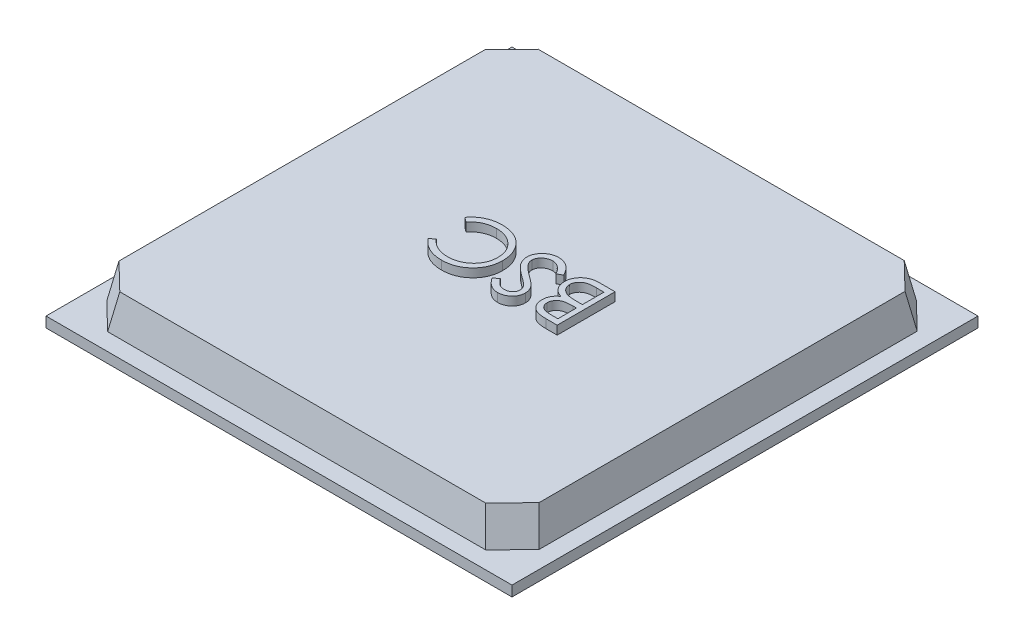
ISO-10303-21;
HEADER;
FILE_DESCRIPTION(('STEP AP214'),'2;1');
FILE_NAME('part.step','',(''),(''),'','','');
FILE_SCHEMA(('AUTOMOTIVE_DESIGN { 1 0 10303 214 1 1 1 1 }'));
ENDSEC;
DATA;
#1=APPLICATION_CONTEXT('core data for automotive mechanical design processes');
#2=APPLICATION_PROTOCOL_DEFINITION('international standard','automotive_design',2000,#1);
#3=PRODUCT_CONTEXT('',#1,'mechanical');
#4=PRODUCT('Part','Part','',(#3));
#5=PRODUCT_RELATED_PRODUCT_CATEGORY('part','',(#4));
#6=PRODUCT_DEFINITION_FORMATION('','',#4);
#7=PRODUCT_DEFINITION_CONTEXT('part definition',#1,'design');
#8=PRODUCT_DEFINITION('design','',#6,#7);
#9=PRODUCT_DEFINITION_SHAPE('','',#8);
#10=(LENGTH_UNIT() NAMED_UNIT(*) SI_UNIT(.MILLI.,.METRE.));
#11=(NAMED_UNIT(*) PLANE_ANGLE_UNIT() SI_UNIT($,.RADIAN.));
#12=(NAMED_UNIT(*) SI_UNIT($,.STERADIAN.) SOLID_ANGLE_UNIT());
#13=UNCERTAINTY_MEASURE_WITH_UNIT(LENGTH_MEASURE(1.E-05),#10,'distance_accuracy_value','');
#14=(GEOMETRIC_REPRESENTATION_CONTEXT(3) GLOBAL_UNCERTAINTY_ASSIGNED_CONTEXT((#13)) GLOBAL_UNIT_ASSIGNED_CONTEXT((#10,
#11,#12)) REPRESENTATION_CONTEXT('',''));
#15=CARTESIAN_POINT('',(0.,0.,0.));
#16=DIRECTION('',(0.,0.,1.));
#17=DIRECTION('',(1.,0.,0.));
#18=AXIS2_PLACEMENT_3D('',#15,#16,#17);
#19=CARTESIAN_POINT('',(12.5,2.6,12.5));
#20=DIRECTION('',(0.,-1.,0.));
#21=DIRECTION('',(0.,0.,-1.));
#22=AXIS2_PLACEMENT_3D('',#19,#20,#21);
#23=PLANE('',#22);
#24=CARTESIAN_POINT('',(-0.974270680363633,2.6,-1.2034136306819));
#25=CARTESIAN_POINT('',(-0.940310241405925,2.6,-1.16168508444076));
#26=CARTESIAN_POINT('',(-0.872799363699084,2.6,-1.07873177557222));
#27=CARTESIAN_POINT('',(-0.786425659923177,2.6,-0.944285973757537));
#28=CARTESIAN_POINT('',(-0.712489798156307,2.6,-0.803915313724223));
#29=CARTESIAN_POINT('',(-0.652710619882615,2.6,-0.656882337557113));
#30=CARTESIAN_POINT('',(-0.605977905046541,2.6,-0.503516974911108));
#31=CARTESIAN_POINT('',(-0.573603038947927,2.6,-0.343741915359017));
#32=CARTESIAN_POINT('',(-0.552565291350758,2.6,-0.177706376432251));
#33=CARTESIAN_POINT('',(-0.55015950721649,2.6,-0.0647751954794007));
#34=CARTESIAN_POINT('',(-0.548936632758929,2.6,-0.00737160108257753));
#35=B_SPLINE_CURVE_WITH_KNOTS('',3,(#24,#25,#26,#27,#28,#29,#30,#31,#32,#33,#34),.UNSPECIFIED.,
.F.,.F.,(4,1,1,1,1,1,1,1,4),(0.,0.12432850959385,0.247156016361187,0.368779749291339,
0.490733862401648,0.613613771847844,0.738957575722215,0.867310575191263,1.),.UNSPECIFIED.);
#36=CARTESIAN_POINT('',(-0.974270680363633,2.6,-1.2034136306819));
#37=VERTEX_POINT('',#36);
#38=CARTESIAN_POINT('',(-0.548936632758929,2.6,-0.00737160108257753));
#39=VERTEX_POINT('',#38);
#40=EDGE_CURVE('E454',#37,#39,#35,.T.);
#41=ORIENTED_EDGE('',*,*,#40,.T.);
#42=CARTESIAN_POINT('',(-0.548936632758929,2.6,-0.00737160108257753));
#43=CARTESIAN_POINT('',(-0.550427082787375,2.6,0.0529629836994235));
#44=CARTESIAN_POINT('',(-0.553359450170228,2.6,0.171667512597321));
#45=CARTESIAN_POINT('',(-0.578273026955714,2.6,0.34587412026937));
#46=CARTESIAN_POINT('',(-0.618350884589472,2.6,0.512775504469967));
#47=CARTESIAN_POINT('',(-0.675275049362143,2.6,0.672060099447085));
#48=CARTESIAN_POINT('',(-0.747445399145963,2.6,0.824565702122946));
#49=CARTESIAN_POINT('',(-0.836599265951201,2.6,0.969127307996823));
#50=CARTESIAN_POINT('',(-0.941700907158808,2.6,1.10666942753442));
#51=CARTESIAN_POINT('',(-1.0619260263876,2.6,1.23510507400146));
#52=CARTESIAN_POINT('',(-1.19376636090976,2.6,1.35254304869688));
#53=CARTESIAN_POINT('',(-1.33495221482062,2.6,1.45586122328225));
#54=CARTESIAN_POINT('',(-1.4852072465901,2.6,1.54184375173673));
#55=CARTESIAN_POINT('',(-1.64287613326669,2.6,1.61371778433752));
#56=CARTESIAN_POINT('',(-1.80913951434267,2.6,1.66896247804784));
#57=CARTESIAN_POINT('',(-1.98364265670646,2.6,1.70763574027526));
#58=CARTESIAN_POINT('',(-2.16605766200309,2.6,1.731707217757));
#59=CARTESIAN_POINT('',(-2.29051384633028,2.6,1.73475024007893));
#60=CARTESIAN_POINT('',(-2.35375061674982,2.6,1.73629641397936));
#61=B_SPLINE_CURVE_WITH_KNOTS('',3,(#42,#43,#44,#45,#46,#47,#48,#49,#50,#51,#52,#53,#54,#55,#56,
#57,#58,#59,#60),.UNSPECIFIED.,.F.,.F.,(4,1,1,1,1,1,1,1,1,1,1,1,1,1,1,1,4),(0.,
0.064557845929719,0.127013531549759,0.18795481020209,0.248013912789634,0.307747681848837,
0.368234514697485,0.42946984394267,0.492743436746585,0.556257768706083,0.618216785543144,
0.679655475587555,0.74124554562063,0.803415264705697,0.866815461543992,0.932328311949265,1.),.UNSPECIFIED.);
#62=CARTESIAN_POINT('',(-2.35375061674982,2.6,1.73629641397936));
#63=VERTEX_POINT('',#62);
#64=EDGE_CURVE('E400',#39,#63,#61,.T.);
#65=ORIENTED_EDGE('',*,*,#64,.T.);
#66=CARTESIAN_POINT('',(-2.35375061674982,2.6,1.73629641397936));
#67=CARTESIAN_POINT('',(-2.39229093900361,2.6,1.73583434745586));
#68=CARTESIAN_POINT('',(-2.46857762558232,2.6,1.73491973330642));
#69=CARTESIAN_POINT('',(-2.58142817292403,2.6,1.72600101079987));
#70=CARTESIAN_POINT('',(-2.69129787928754,2.6,1.71113324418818));
#71=CARTESIAN_POINT('',(-2.7982624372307,2.6,1.69089624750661));
#72=CARTESIAN_POINT('',(-2.90284222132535,2.6,1.66577995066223));
#73=CARTESIAN_POINT('',(-3.00423794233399,2.6,1.63306093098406));
#74=CARTESIAN_POINT('',(-3.10304457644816,2.6,1.5956495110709));
#75=CARTESIAN_POINT('',(-3.19863896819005,2.6,1.55256268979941));
#76=CARTESIAN_POINT('',(-3.29056246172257,2.6,1.50419690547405));
#77=CARTESIAN_POINT('',(-3.3787864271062,2.6,1.45108826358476));
#78=CARTESIAN_POINT('',(-3.46261007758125,2.6,1.39330260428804));
#79=CARTESIAN_POINT('',(-3.54262324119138,2.6,1.33133139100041));
#80=CARTESIAN_POINT('',(-3.61748743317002,2.6,1.26386356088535));
#81=CARTESIAN_POINT('',(-3.68932822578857,2.6,1.1927548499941));
#82=CARTESIAN_POINT('',(-3.7557059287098,2.6,1.11595703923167));
#83=CARTESIAN_POINT('',(-3.79667928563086,2.6,1.0619002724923));
#84=CARTESIAN_POINT('',(-3.81722226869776,2.6,1.03479760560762));
#85=B_SPLINE_CURVE_WITH_KNOTS('',3,(#66,#67,#68,#69,#70,#71,#72,#73,#74,#75,#76,#77,#78,#79,#80,
#81,#82,#83,#84),.UNSPECIFIED.,.F.,.F.,(4,1,1,1,1,1,1,1,1,1,1,1,1,1,1,1,4),(0.,
0.0685475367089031,0.135682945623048,0.201214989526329,0.265682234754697,0.329266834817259,
0.392395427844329,0.455069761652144,0.517126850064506,0.578790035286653,0.639739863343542,
0.700191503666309,0.759806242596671,0.819628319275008,0.879354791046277,0.939511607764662,1.),.UNSPECIFIED.);
#86=CARTESIAN_POINT('',(-3.81722226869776,2.6,1.03479760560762));
#87=VERTEX_POINT('',#86);
#88=EDGE_CURVE('E382',#63,#87,#85,.T.);
#89=ORIENTED_EDGE('',*,*,#88,.T.);
#90=DIRECTION('',(0.794127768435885,0.,-0.607750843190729));
#91=VECTOR('',#90,1.);
#92=CARTESIAN_POINT('',(-3.81722226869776,2.6,1.03479760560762));
#93=LINE('',#92,#91);
#94=CARTESIAN_POINT('',(-3.55382424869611,2.6,0.833217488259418));
#95=VERTEX_POINT('',#94);
#96=EDGE_CURVE('E393',#87,#95,#93,.T.);
#97=ORIENTED_EDGE('',*,*,#96,.T.);
#98=CARTESIAN_POINT('',(-3.55382424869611,2.6,0.833217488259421));
#99=CARTESIAN_POINT('',(-3.53503456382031,2.6,0.85561072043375));
#100=CARTESIAN_POINT('',(-3.49770851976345,2.6,0.900095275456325));
#101=CARTESIAN_POINT('',(-3.43765785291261,2.6,0.962561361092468));
#102=CARTESIAN_POINT('',(-3.37507475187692,2.6,1.02108444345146));
#103=CARTESIAN_POINT('',(-3.30998313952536,2.6,1.07594331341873));
#104=CARTESIAN_POINT('',(-3.24121139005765,2.6,1.1252195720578));
#105=CARTESIAN_POINT('',(-3.17042545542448,2.6,1.17148112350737));
#106=CARTESIAN_POINT('',(-3.09644120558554,2.6,1.21294760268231));
#107=CARTESIAN_POINT('',(-2.99413360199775,2.6,1.2632265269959));
#108=CARTESIAN_POINT('',(-2.86029936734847,2.6,1.31569357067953));
#109=CARTESIAN_POINT('',(-2.69182296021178,2.6,1.35968582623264));
#110=CARTESIAN_POINT('',(-2.51595152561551,2.6,1.38769050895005));
#111=CARTESIAN_POINT('',(-2.39596596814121,2.6,1.39072359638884));
#112=CARTESIAN_POINT('',(-2.33493647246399,2.6,1.39226634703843));
#113=B_SPLINE_CURVE_WITH_KNOTS('',3,(#98,#99,#100,#101,#102,#103,#104,#105,#106,#107,#108,#109,
#110,#111,#112),.UNSPECIFIED.,.F.,.F.,(4,1,1,1,1,1,1,1,1,1,1,1,4),(0.,0.06316325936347,
0.125474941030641,0.187121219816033,0.248294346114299,0.309294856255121,0.369850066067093,
0.430973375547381,0.492455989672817,0.616147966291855,0.740843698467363,0.868182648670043,1.),.UNSPECIFIED.);
#114=CARTESIAN_POINT('',(-2.33493647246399,2.6,1.39226634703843));
#115=VERTEX_POINT('',#114);
#116=EDGE_CURVE('E29',#95,#115,#113,.T.);
#117=ORIENTED_EDGE('',*,*,#116,.T.);
#118=CARTESIAN_POINT('',(-2.33493647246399,2.6,1.39226634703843));
#119=CARTESIAN_POINT('',(-2.30131370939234,2.6,1.39187920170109));
#120=CARTESIAN_POINT('',(-2.23438023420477,2.6,1.39110850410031));
#121=CARTESIAN_POINT('',(-2.13504670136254,2.6,1.38094104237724));
#122=CARTESIAN_POINT('',(-2.03756801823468,2.6,1.36665059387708));
#123=CARTESIAN_POINT('',(-1.94200759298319,2.6,1.34544635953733));
#124=CARTESIAN_POINT('',(-1.84848706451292,2.6,1.31863825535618));
#125=CARTESIAN_POINT('',(-1.75639503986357,2.6,1.2866043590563));
#126=CARTESIAN_POINT('',(-1.66706484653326,2.6,1.24697114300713));
#127=CARTESIAN_POINT('',(-1.57926072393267,2.6,1.20316574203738));
#128=CARTESIAN_POINT('',(-1.49513580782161,2.6,1.15368757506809));
#129=CARTESIAN_POINT('',(-1.41553838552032,2.6,1.09971857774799));
#130=CARTESIAN_POINT('',(-1.34075876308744,2.6,1.04186267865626));
#131=CARTESIAN_POINT('',(-1.27073778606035,2.6,0.979903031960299));
#132=CARTESIAN_POINT('',(-1.20540387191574,2.6,0.914118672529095));
#133=CARTESIAN_POINT('',(-1.14523042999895,2.6,0.843808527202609));
#134=CARTESIAN_POINT('',(-1.09042567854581,2.6,0.769197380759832));
#135=CARTESIAN_POINT('',(-1.03990329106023,2.6,0.691269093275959));
#136=CARTESIAN_POINT('',(-0.994656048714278,2.6,0.610250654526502));
#137=CARTESIAN_POINT('',(-0.956771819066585,2.6,0.525842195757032));
#138=CARTESIAN_POINT('',(-0.923223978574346,2.6,0.43948917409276));
#139=CARTESIAN_POINT('',(-0.896677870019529,2.6,0.350215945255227));
#140=CARTESIAN_POINT('',(-0.875666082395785,2.6,0.258650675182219));
#141=CARTESIAN_POINT('',(-0.861168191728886,2.6,0.164547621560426));
#142=CARTESIAN_POINT('',(-0.851116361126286,2.6,0.0681033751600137));
#143=CARTESIAN_POINT('',(-0.850349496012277,2.6,0.00273365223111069));
#144=CARTESIAN_POINT('',(-0.849962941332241,2.6,-0.0302173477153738));
#145=B_SPLINE_CURVE_WITH_KNOTS('',3,(#118,#119,#120,#121,#122,#123,#124,#125,#126,#127,#128,
#129,#130,#131,#132,#133,#134,#135,#136,#137,#138,#139,#140,#141,#142,#143,#144),.UNSPECIFIED.,
.F.,.F.,(4,1,1,1,1,1,1,1,1,1,1,1,1,1,1,1,1,1,1,1,1,1,1,1,4),(0.,0.0439549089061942,
0.0875018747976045,0.13046262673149,0.172752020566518,0.215403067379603,0.25764982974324,
0.300152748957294,0.343121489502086,0.385925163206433,0.427685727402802,0.46881795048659,
0.509491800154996,0.549883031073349,0.589980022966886,0.63040523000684,0.670868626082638,
0.711383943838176,0.751627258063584,0.791775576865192,0.832458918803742,0.873319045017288,
0.914542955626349,0.956923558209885,1.),.UNSPECIFIED.);
#146=CARTESIAN_POINT('',(-0.849962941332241,2.6,-0.0302173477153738));
#147=VERTEX_POINT('',#146);
#148=EDGE_CURVE('E411',#115,#147,#145,.T.);
#149=ORIENTED_EDGE('',*,*,#148,.T.);
#150=CARTESIAN_POINT('',(-0.849962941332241,2.6,-0.0302173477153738));
#151=CARTESIAN_POINT('',(-0.851172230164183,2.6,-0.0797950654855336));
#152=CARTESIAN_POINT('',(-0.853546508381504,2.6,-0.177134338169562));
#153=CARTESIAN_POINT('',(-0.874676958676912,2.6,-0.319711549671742));
#154=CARTESIAN_POINT('',(-0.906787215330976,2.6,-0.456299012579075));
#155=CARTESIAN_POINT('',(-0.954912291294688,2.6,-0.586042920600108));
#156=CARTESIAN_POINT('',(-1.01425361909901,2.6,-0.710543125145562));
#157=CARTESIAN_POINT('',(-1.08923703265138,2.6,-0.827693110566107));
#158=CARTESIAN_POINT('',(-1.17608115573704,2.6,-0.939263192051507));
#159=CARTESIAN_POINT('',(-1.27601457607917,2.6,-1.04261658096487));
#160=CARTESIAN_POINT('',(-1.38565761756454,2.6,-1.13702912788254));
#161=CARTESIAN_POINT('',(-1.50329546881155,2.6,-1.22016823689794));
#162=CARTESIAN_POINT('',(-1.62863513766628,2.6,-1.28947261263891));
#163=CARTESIAN_POINT('',(-1.76029270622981,2.6,-1.34714340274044));
#164=CARTESIAN_POINT('',(-1.89928130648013,2.6,-1.39147443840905));
#165=CARTESIAN_POINT('',(-2.04535100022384,2.6,-1.42268290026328));
#166=CARTESIAN_POINT('',(-2.19818409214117,2.6,-1.44304075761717));
#167=CARTESIAN_POINT('',(-2.30261703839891,2.6,-1.44498978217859));
#168=CARTESIAN_POINT('',(-2.3557664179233,2.6,-1.44598170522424));
#169=B_SPLINE_CURVE_WITH_KNOTS('',3,(#150,#151,#152,#153,#154,#155,#156,#157,#158,#159,#160,
#161,#162,#163,#164,#165,#166,#167,#168),.UNSPECIFIED.,.F.,.F.,(4,1,1,1,1,1,1,1,1,1,1,1,1,1,1,1,
4),(0.,0.064323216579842,0.126290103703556,0.186726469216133,0.246146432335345,
0.305575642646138,0.365429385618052,0.42632630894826,0.488839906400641,0.551724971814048,
0.613918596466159,0.675483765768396,0.737333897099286,0.800229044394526,0.864502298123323,
0.931040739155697,1.),.UNSPECIFIED.);
#170=CARTESIAN_POINT('',(-2.3557664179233,2.6,-1.44598170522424));
#171=VERTEX_POINT('',#170);
#172=EDGE_CURVE('E419',#147,#171,#169,.T.);
#173=ORIENTED_EDGE('',*,*,#172,.T.);
#174=CARTESIAN_POINT('',(-2.3557664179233,2.6,-1.44598170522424));
#175=CARTESIAN_POINT('',(-2.41432536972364,2.6,-1.44436323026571));
#176=CARTESIAN_POINT('',(-2.52958339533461,2.6,-1.44117768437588));
#177=CARTESIAN_POINT('',(-2.69860912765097,2.6,-1.41419071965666));
#178=CARTESIAN_POINT('',(-2.86041617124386,2.6,-1.3704335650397));
#179=CARTESIAN_POINT('',(-3.01501322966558,2.6,-1.30919574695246));
#180=CARTESIAN_POINT('',(-3.16196447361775,2.6,-1.22958851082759));
#181=CARTESIAN_POINT('',(-3.3014998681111,2.6,-1.13308273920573));
#182=CARTESIAN_POINT('',(-3.43373719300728,2.6,-1.01876044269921));
#183=CARTESIAN_POINT('',(-3.51325433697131,2.6,-0.931469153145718));
#184=CARTESIAN_POINT('',(-3.55382424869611,2.6,-0.886932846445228));
#185=B_SPLINE_CURVE_WITH_KNOTS('',3,(#174,#175,#176,#177,#178,#179,#180,#181,#182,#183,#184),
.UNSPECIFIED.,.F.,.F.,(4,1,1,1,1,1,1,1,4),(0.,0.128515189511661,0.252948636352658,
0.374754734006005,0.49593975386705,0.617180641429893,0.740909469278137,0.867811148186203,1.),.UNSPECIFIED.);
#186=CARTESIAN_POINT('',(-3.55382424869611,2.6,-0.886932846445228));
#187=VERTEX_POINT('',#186);
#188=EDGE_CURVE('E427',#171,#187,#185,.T.);
#189=ORIENTED_EDGE('',*,*,#188,.T.);
#190=DIRECTION('',(-0.797062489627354,0.,-0.603896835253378));
#191=VECTOR('',#190,1.);
#192=CARTESIAN_POINT('',(-3.55382424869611,2.6,-0.886932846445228));
#193=LINE('',#192,#191);
#194=CARTESIAN_POINT('',(-3.81722226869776,2.6,-1.08649716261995));
#195=VERTEX_POINT('',#194);
#196=EDGE_CURVE('E435',#187,#195,#193,.T.);
#197=ORIENTED_EDGE('',*,*,#196,.T.);
#198=CARTESIAN_POINT('',(-3.81722226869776,2.6,-1.08649716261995));
#199=CARTESIAN_POINT('',(-3.7960249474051,2.6,-1.11384754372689));
#200=CARTESIAN_POINT('',(-3.75373183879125,2.6,-1.16841729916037));
#201=CARTESIAN_POINT('',(-3.6852486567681,2.6,-1.24534725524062));
#202=CARTESIAN_POINT('',(-3.61310519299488,2.6,-1.31770801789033));
#203=CARTESIAN_POINT('',(-3.53676559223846,2.6,-1.38491618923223));
#204=CARTESIAN_POINT('',(-3.45710803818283,2.6,-1.44831660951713));
#205=CARTESIAN_POINT('',(-3.37270222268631,2.6,-1.50610804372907));
#206=CARTESIAN_POINT('',(-3.28465774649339,2.6,-1.55909713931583));
#207=CARTESIAN_POINT('',(-3.19327292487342,2.6,-1.60761643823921));
#208=CARTESIAN_POINT('',(-3.0986448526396,2.6,-1.65066375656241));
#209=CARTESIAN_POINT('',(-3.00088691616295,2.6,-1.68751667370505));
#210=CARTESIAN_POINT('',(-2.90042049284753,2.6,-1.71926255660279));
#211=CARTESIAN_POINT('',(-2.79724098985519,2.6,-1.74537998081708));
#212=CARTESIAN_POINT('',(-2.69113438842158,2.6,-1.76576553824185));
#213=CARTESIAN_POINT('',(-2.58248358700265,2.6,-1.77939324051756));
#214=CARTESIAN_POINT('',(-2.47105408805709,2.6,-1.78872959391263));
#215=CARTESIAN_POINT('',(-2.39587822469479,2.6,-1.78958054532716));
#216=CARTESIAN_POINT('',(-2.35778221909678,2.6,-1.79001177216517));
#217=B_SPLINE_CURVE_WITH_KNOTS('',3,(#198,#199,#200,#201,#202,#203,#204,#205,#206,#207,#208,
#209,#210,#211,#212,#213,#214,#215,#216),.UNSPECIFIED.,.F.,.F.,(4,1,1,1,1,1,1,1,1,1,1,1,1,1,1,1,
4),(0.,0.0616742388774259,0.123053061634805,0.183475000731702,0.243726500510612,
0.304278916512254,0.364862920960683,0.425946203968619,0.487391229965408,0.549220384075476,
0.611143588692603,0.673528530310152,0.736961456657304,0.80078528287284,0.866012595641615,
0.932100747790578,1.),.UNSPECIFIED.);
#218=CARTESIAN_POINT('',(-2.35778221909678,2.6,-1.79001177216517));
#219=VERTEX_POINT('',#218);
#220=EDGE_CURVE('E441',#195,#219,#217,.T.);
#221=ORIENTED_EDGE('',*,*,#220,.T.);
#222=CARTESIAN_POINT('',(-2.35778221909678,2.6,-1.79001177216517));
#223=CARTESIAN_POINT('',(-2.3217056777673,2.6,-1.78976068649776));
#224=CARTESIAN_POINT('',(-2.25036878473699,2.6,-1.78926419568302));
#225=CARTESIAN_POINT('',(-2.14504517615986,2.6,-1.78122139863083));
#226=CARTESIAN_POINT('',(-2.04250962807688,2.6,-1.77024832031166));
#227=CARTESIAN_POINT('',(-1.94305519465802,2.6,-1.75372590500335));
#228=CARTESIAN_POINT('',(-1.84613914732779,2.6,-1.7342285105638));
#229=CARTESIAN_POINT('',(-1.75264006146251,2.6,-1.70809257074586));
#230=CARTESIAN_POINT('',(-1.66163788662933,2.6,-1.67881518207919));
#231=CARTESIAN_POINT('',(-1.57349823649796,2.6,-1.64440493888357));
#232=CARTESIAN_POINT('',(-1.48814613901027,2.6,-1.60557546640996));
#233=CARTESIAN_POINT('',(-1.40585688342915,2.6,-1.56169023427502));
#234=CARTESIAN_POINT('',(-1.32666831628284,2.6,-1.51311828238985));
#235=CARTESIAN_POINT('',(-1.2498018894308,2.6,-1.4609302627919));
#236=CARTESIAN_POINT('',(-1.17639310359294,2.6,-1.40344984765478));
#237=CARTESIAN_POINT('',(-1.10580581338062,2.6,-1.34147531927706));
#238=CARTESIAN_POINT('',(-1.03764420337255,2.6,-1.27521556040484));
#239=CARTESIAN_POINT('',(-0.995473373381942,2.6,-1.22743619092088));
#240=CARTESIAN_POINT('',(-0.974270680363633,2.6,-1.2034136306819));
#241=B_SPLINE_CURVE_WITH_KNOTS('',3,(#222,#223,#224,#225,#226,#227,#228,#229,#230,#231,#232,
#233,#234,#235,#236,#237,#238,#239,#240),.UNSPECIFIED.,.F.,.F.,(4,1,1,1,1,1,1,1,1,1,1,1,1,1,1,1,
4),(0.,0.0696628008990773,0.137749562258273,0.203916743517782,0.268779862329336,
0.332413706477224,0.394753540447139,0.456180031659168,0.51699564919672,0.577395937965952,
0.637198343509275,0.696999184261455,0.756756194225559,0.816553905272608,0.87694799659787,
0.938131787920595,1.),.UNSPECIFIED.);
#242=EDGE_CURVE('E446',#219,#37,#241,.T.);
#243=ORIENTED_EDGE('',*,*,#242,.T.);
#244=EDGE_LOOP('',(#41,#65,#89,#97,#117,#149,#173,#189,#197,#221,#243));
#245=FACE_BOUND('',#244,.T.);
#246=CARTESIAN_POINT('',(0.757302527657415,2.6,0.20025591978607));
#247=CARTESIAN_POINT('',(0.720897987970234,2.6,0.17376528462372));
#248=CARTESIAN_POINT('',(0.650405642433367,2.6,0.122469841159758));
#249=CARTESIAN_POINT('',(0.550105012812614,2.6,0.0454019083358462));
#250=CARTESIAN_POINT('',(0.459161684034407,2.6,-0.0299717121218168));
#251=CARTESIAN_POINT('',(0.377256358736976,2.6,-0.103169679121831));
#252=CARTESIAN_POINT('',(0.303579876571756,2.6,-0.173636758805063));
#253=CARTESIAN_POINT('',(0.238949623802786,2.6,-0.242220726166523));
#254=CARTESIAN_POINT('',(0.182707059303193,2.6,-0.308430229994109));
#255=CARTESIAN_POINT('',(0.122158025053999,2.6,-0.393315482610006));
#256=CARTESIAN_POINT('',(0.0602877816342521,2.6,-0.497567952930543));
#257=CARTESIAN_POINT('',(0.00715433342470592,2.6,-0.625297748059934));
#258=CARTESIAN_POINT('',(-0.0263486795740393,2.6,-0.753524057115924));
#259=CARTESIAN_POINT('',(-0.0307298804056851,2.6,-0.839707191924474));
#260=CARTESIAN_POINT('',(-0.0328915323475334,2.6,-0.88222931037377));
#261=B_SPLINE_CURVE_WITH_KNOTS('',3,(#246,#247,#248,#249,#250,#251,#252,#253,#254,#255,#256,
#257,#258,#259,#260),.UNSPECIFIED.,.F.,.F.,(4,1,1,1,1,1,1,1,1,1,1,1,4),(0.,0.096972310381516,
0.187773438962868,0.272396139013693,0.351320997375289,0.424334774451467,0.491908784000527,
0.5542332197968,0.611267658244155,0.716347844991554,0.814540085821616,0.908495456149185,1.),.UNSPECIFIED.);
#262=CARTESIAN_POINT('',(0.757302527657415,2.6,0.20025591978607));
#263=VERTEX_POINT('',#262);
#264=CARTESIAN_POINT('',(-0.0328915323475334,2.6,-0.88222931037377));
#265=VERTEX_POINT('',#264);
#266=EDGE_CURVE('E1069',#263,#265,#261,.T.);
#267=ORIENTED_EDGE('',*,*,#266,.T.);
#268=CARTESIAN_POINT('',(-0.0328915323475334,2.6,-0.88222931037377));
#269=CARTESIAN_POINT('',(-0.0322617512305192,2.6,-0.912301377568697));
#270=CARTESIAN_POINT('',(-0.0310144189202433,2.6,-0.971861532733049));
#271=CARTESIAN_POINT('',(-0.016676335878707,2.6,-1.05931761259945));
#272=CARTESIAN_POINT('',(0.00433080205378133,2.6,-1.14425873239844));
#273=CARTESIAN_POINT('',(0.0359926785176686,2.6,-1.22563495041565));
#274=CARTESIAN_POINT('',(0.0746371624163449,2.6,-1.30493500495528));
#275=CARTESIAN_POINT('',(0.123673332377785,2.6,-1.38007874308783));
#276=CARTESIAN_POINT('',(0.180512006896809,2.6,-1.45272928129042));
#277=CARTESIAN_POINT('',(0.2457134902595,2.6,-1.52094936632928));
#278=CARTESIAN_POINT('',(0.317060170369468,2.6,-1.58357516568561));
#279=CARTESIAN_POINT('',(0.392468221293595,2.6,-1.63928428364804));
#280=CARTESIAN_POINT('',(0.472061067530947,2.6,-1.68573484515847));
#281=CARTESIAN_POINT('',(0.555406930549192,2.6,-1.72363916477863));
#282=CARTESIAN_POINT('',(0.642524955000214,2.6,-1.75328490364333));
#283=CARTESIAN_POINT('',(0.733385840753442,2.6,-1.7747647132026));
#284=CARTESIAN_POINT('',(0.828139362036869,2.6,-1.7879477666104));
#285=CARTESIAN_POINT('',(0.892542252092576,2.6,-1.78931608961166));
#286=CARTESIAN_POINT('',(0.925285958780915,2.6,-1.79001177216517));
#287=B_SPLINE_CURVE_WITH_KNOTS('',3,(#268,#269,#270,#271,#272,#273,#274,#275,#276,#277,#278,
#279,#280,#281,#282,#283,#284,#285,#286),.UNSPECIFIED.,.F.,.F.,(4,1,1,1,1,1,1,1,1,1,1,1,1,1,1,1,
4),(0.,0.0614842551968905,0.12177452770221,0.180919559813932,0.240256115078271,
0.300114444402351,0.361145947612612,0.423500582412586,0.488669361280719,0.553954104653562,
0.617581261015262,0.68023842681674,0.742187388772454,0.804663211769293,0.868258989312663,
0.933020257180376,1.),.UNSPECIFIED.);
#288=CARTESIAN_POINT('',(0.925285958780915,2.6,-1.79001177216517));
#289=VERTEX_POINT('',#288);
#290=EDGE_CURVE('E883',#265,#289,#287,.T.);
#291=ORIENTED_EDGE('',*,*,#290,.T.);
#292=CARTESIAN_POINT('',(0.925285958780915,2.6,-1.79001177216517));
#293=CARTESIAN_POINT('',(0.950620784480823,2.6,-1.78952187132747));
#294=CARTESIAN_POINT('',(1.00097136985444,2.6,-1.78854823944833));
#295=CARTESIAN_POINT('',(1.07544576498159,2.6,-1.77994085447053));
#296=CARTESIAN_POINT('',(1.1484156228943,2.6,-1.76776275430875));
#297=CARTESIAN_POINT('',(1.21896530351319,2.6,-1.74842854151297));
#298=CARTESIAN_POINT('',(1.28800375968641,2.6,-1.72497055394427));
#299=CARTESIAN_POINT('',(1.35523072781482,2.6,-1.69608689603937));
#300=CARTESIAN_POINT('',(1.42067878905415,2.6,-1.66147327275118));
#301=CARTESIAN_POINT('',(1.48471472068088,2.6,-1.62189738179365));
#302=CARTESIAN_POINT('',(1.54717565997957,2.6,-1.57584030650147));
#303=CARTESIAN_POINT('',(1.60747575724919,2.6,-1.52219701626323));
#304=CARTESIAN_POINT('',(1.66759349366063,2.6,-1.46244698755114));
#305=CARTESIAN_POINT('',(1.72575444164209,2.6,-1.3949676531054));
#306=CARTESIAN_POINT('',(1.78313503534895,2.6,-1.32084919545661));
#307=CARTESIAN_POINT('',(1.8386039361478,2.6,-1.23939815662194));
#308=CARTESIAN_POINT('',(1.89330931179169,2.6,-1.15105819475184));
#309=CARTESIAN_POINT('',(1.92763376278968,2.6,-1.08889347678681));
#310=CARTESIAN_POINT('',(1.94528135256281,2.6,-1.05693207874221));
#311=B_SPLINE_CURVE_WITH_KNOTS('',3,(#292,#293,#294,#295,#296,#297,#298,#299,#300,#301,#302,
#303,#304,#305,#306,#307,#308,#309,#310),.UNSPECIFIED.,.F.,.F.,(4,1,1,1,1,1,1,1,1,1,1,1,1,1,1,1,
4),(0.,0.0572082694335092,0.11369605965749,0.169177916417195,0.224159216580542,
0.278719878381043,0.333794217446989,0.389241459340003,0.445822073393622,0.50370428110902,
0.564293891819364,0.627975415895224,0.695038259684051,0.765372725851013,0.839611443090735,
0.917537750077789,1.),.UNSPECIFIED.);
#312=CARTESIAN_POINT('',(1.94528135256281,2.6,-1.05693207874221));
#313=VERTEX_POINT('',#312);
#314=EDGE_CURVE('E1084',#289,#313,#311,.T.);
#315=ORIENTED_EDGE('',*,*,#314,.T.);
#316=DIRECTION('',(-0.857672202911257,0.,0.514196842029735));
#317=VECTOR('',#316,1.);
#318=CARTESIAN_POINT('',(1.94528135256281,2.6,-1.05693207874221));
#319=LINE('',#318,#317);
#320=CARTESIAN_POINT('',(1.66172532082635,2.6,-0.886932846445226));
#321=VERTEX_POINT('',#320);
#322=EDGE_CURVE('E1089',#313,#321,#319,.T.);
#323=ORIENTED_EDGE('',*,*,#322,.T.);
#324=CARTESIAN_POINT('',(1.66172532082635,2.6,-0.886932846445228));
#325=CARTESIAN_POINT('',(1.63535268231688,2.6,-0.931079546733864));
#326=CARTESIAN_POINT('',(1.58482372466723,2.6,-1.01566292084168));
#327=CARTESIAN_POINT('',(1.50053382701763,2.6,-1.12995618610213));
#328=CARTESIAN_POINT('',(1.41319482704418,2.6,-1.22709858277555));
#329=CARTESIAN_POINT('',(1.32215994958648,2.6,-1.30652499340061));
#330=CARTESIAN_POINT('',(1.22798486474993,2.6,-1.36905753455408));
#331=CARTESIAN_POINT('',(1.13005478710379,2.6,-1.41333634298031));
#332=CARTESIAN_POINT('',(1.02869972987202,2.6,-1.44095269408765));
#333=CARTESIAN_POINT('',(0.959722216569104,2.6,-1.44430707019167));
#334=CARTESIAN_POINT('',(0.925285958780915,2.6,-1.44598170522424));
#335=B_SPLINE_CURVE_WITH_KNOTS('',3,(#324,#325,#326,#327,#328,#329,#330,#331,#332,#333,#334),
.UNSPECIFIED.,.F.,.F.,(4,1,1,1,1,1,1,1,4),(0.,0.159004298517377,0.304646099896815,
0.438546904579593,0.562322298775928,0.677432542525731,0.786897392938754,0.893610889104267,1.),.UNSPECIFIED.);
#336=CARTESIAN_POINT('',(0.925285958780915,2.6,-1.44598170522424));
#337=VERTEX_POINT('',#336);
#338=EDGE_CURVE('E37',#321,#337,#335,.T.);
#339=ORIENTED_EDGE('',*,*,#338,.T.);
#340=CARTESIAN_POINT('',(0.925285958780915,2.6,-1.44598170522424));
#341=CARTESIAN_POINT('',(0.895876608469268,2.6,-1.44516261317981));
#342=CARTESIAN_POINT('',(0.837572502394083,2.6,-1.44353876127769));
#343=CARTESIAN_POINT('',(0.751738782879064,2.6,-1.42793573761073));
#344=CARTESIAN_POINT('',(0.66837807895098,2.6,-1.40396487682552));
#345=CARTESIAN_POINT('',(0.589208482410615,2.6,-1.36963518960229));
#346=CARTESIAN_POINT('',(0.515322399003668,2.6,-1.32810090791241));
#347=CARTESIAN_POINT('',(0.450530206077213,2.6,-1.27793392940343));
#348=CARTESIAN_POINT('',(0.39451723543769,2.6,-1.22176753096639));
#349=CARTESIAN_POINT('',(0.34869843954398,2.6,-1.15910679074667));
#350=CARTESIAN_POINT('',(0.313545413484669,2.6,-1.0917169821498));
#351=CARTESIAN_POINT('',(0.286526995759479,2.6,-1.02254575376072));
#352=CARTESIAN_POINT('',(0.271533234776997,2.6,-0.950506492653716));
#353=CARTESIAN_POINT('',(0.269274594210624,2.6,-0.902002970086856));
#354=CARTESIAN_POINT('',(0.26813477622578,2.6,-0.877525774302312));
#355=B_SPLINE_CURVE_WITH_KNOTS('',3,(#340,#341,#342,#343,#344,#345,#346,#347,#348,#349,#350,
#351,#352,#353,#354),.UNSPECIFIED.,.F.,.F.,(4,1,1,1,1,1,1,1,1,1,1,1,4),(0.,0.0912636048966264,
0.180930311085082,0.270088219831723,0.360156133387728,0.448342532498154,0.532665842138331,
0.613833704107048,0.693981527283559,0.772715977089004,0.849335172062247,0.923967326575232,1.),.UNSPECIFIED.);
#356=CARTESIAN_POINT('',(0.26813477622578,2.6,-0.877525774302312));
#357=VERTEX_POINT('',#356);
#358=EDGE_CURVE('E1105',#337,#357,#355,.T.);
#359=ORIENTED_EDGE('',*,*,#358,.T.);
#360=CARTESIAN_POINT('',(0.268134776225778,2.6,-0.877525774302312));
#361=CARTESIAN_POINT('',(0.269547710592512,2.6,-0.849598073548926));
#362=CARTESIAN_POINT('',(0.272419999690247,2.6,-0.792825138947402));
#363=CARTESIAN_POINT('',(0.296696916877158,2.6,-0.709063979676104));
#364=CARTESIAN_POINT('',(0.334887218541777,2.6,-0.626172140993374));
#365=CARTESIAN_POINT('',(0.370119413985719,2.6,-0.574898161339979));
#366=CARTESIAN_POINT('',(0.388410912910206,2.6,-0.54827824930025));
#367=B_SPLINE_CURVE_WITH_KNOTS('',3,(#360,#361,#362,#363,#364,#365,#366),.UNSPECIFIED.,.F.,.F.,
(4,1,1,1,4),(0.,0.234723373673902,0.477158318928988,0.728556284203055,1.),.UNSPECIFIED.);
#368=CARTESIAN_POINT('',(0.388410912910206,2.6,-0.54827824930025));
#369=VERTEX_POINT('',#368);
#370=EDGE_CURVE('E1113',#357,#369,#367,.T.);
#371=ORIENTED_EDGE('',*,*,#370,.T.);
#372=CARTESIAN_POINT('',(0.388410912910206,2.6,-0.54827824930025));
#373=CARTESIAN_POINT('',(0.403429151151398,2.6,-0.529065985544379));
#374=CARTESIAN_POINT('',(0.434958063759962,2.6,-0.488732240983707));
#375=CARTESIAN_POINT('',(0.489161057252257,2.6,-0.428694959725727));
#376=CARTESIAN_POINT('',(0.552764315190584,2.6,-0.366766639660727));
#377=CARTESIAN_POINT('',(0.623591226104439,2.6,-0.300582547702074));
#378=CARTESIAN_POINT('',(0.704221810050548,2.6,-0.233220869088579));
#379=CARTESIAN_POINT('',(0.792130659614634,2.6,-0.161469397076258));
#380=CARTESIAN_POINT('',(0.889562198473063,2.6,-0.0880567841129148));
#381=CARTESIAN_POINT('',(0.957893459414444,2.6,-0.0388228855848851));
#382=CARTESIAN_POINT('',(0.99315126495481,2.6,-0.0134190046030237));
#383=B_SPLINE_CURVE_WITH_KNOTS('',3,(#372,#373,#374,#375,#376,#377,#378,#379,#380,#381,#382),
.UNSPECIFIED.,.F.,.F.,(4,1,1,1,1,1,1,1,4),(0.,0.0902792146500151,0.189529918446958,
0.299197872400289,0.41892588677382,0.548376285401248,0.688136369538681,0.83908350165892,1.),.UNSPECIFIED.);
#384=CARTESIAN_POINT('',(0.99315126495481,2.6,-0.0134190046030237));
#385=VERTEX_POINT('',#384);
#386=EDGE_CURVE('E1121',#369,#385,#383,.T.);
#387=ORIENTED_EDGE('',*,*,#386,.T.);
#388=CARTESIAN_POINT('',(0.99315126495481,2.6,-0.0134190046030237));
#389=CARTESIAN_POINT('',(1.02844225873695,2.6,0.0117176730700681));
#390=CARTESIAN_POINT('',(1.09591595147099,2.6,0.0597770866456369));
#391=CARTESIAN_POINT('',(1.19027565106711,2.6,0.131103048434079));
#392=CARTESIAN_POINT('',(1.2746547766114,2.6,0.196314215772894));
#393=CARTESIAN_POINT('',(1.34867829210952,2.6,0.256024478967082));
#394=CARTESIAN_POINT('',(1.41231363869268,2.6,0.310241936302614));
#395=CARTESIAN_POINT('',(1.46606226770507,2.6,0.35844594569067));
#396=CARTESIAN_POINT('',(1.50855498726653,2.6,0.401940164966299));
#397=CARTESIAN_POINT('',(1.53218414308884,2.6,0.430155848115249));
#398=CARTESIAN_POINT('',(1.5427930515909,2.6,0.442823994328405));
#399=B_SPLINE_CURVE_WITH_KNOTS('',3,(#388,#389,#390,#391,#392,#393,#394,#395,#396,#397,#398),
.UNSPECIFIED.,.F.,.F.,(4,1,1,1,1,1,1,1,4),(0.,0.181535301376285,0.347081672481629,
0.495567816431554,0.628357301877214,0.745519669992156,0.845830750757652,0.930781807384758,1.),.UNSPECIFIED.);
#400=CARTESIAN_POINT('',(1.5427930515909,2.6,0.442823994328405));
#401=VERTEX_POINT('',#400);
#402=EDGE_CURVE('E1129',#385,#401,#399,.T.);
#403=ORIENTED_EDGE('',*,*,#402,.T.);
#404=CARTESIAN_POINT('',(1.5427930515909,2.6,0.442823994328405));
#405=CARTESIAN_POINT('',(1.55762146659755,2.6,0.462567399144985));
#406=CARTESIAN_POINT('',(1.58678353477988,2.6,0.501395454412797));
#407=CARTESIAN_POINT('',(1.62527740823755,2.6,0.562084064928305));
#408=CARTESIAN_POINT('',(1.65799533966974,2.6,0.624208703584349));
#409=CARTESIAN_POINT('',(1.68364354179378,2.6,0.687936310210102));
#410=CARTESIAN_POINT('',(1.70524156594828,2.6,0.752372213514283));
#411=CARTESIAN_POINT('',(1.7197684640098,2.6,0.818357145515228));
#412=CARTESIAN_POINT('',(1.72886472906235,2.6,0.8855950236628));
#413=CARTESIAN_POINT('',(1.72979625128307,2.6,0.930843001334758));
#414=CARTESIAN_POINT('',(1.73026256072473,2.6,0.953493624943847));
#415=B_SPLINE_CURVE_WITH_KNOTS('',3,(#404,#405,#406,#407,#408,#409,#410,#411,#412,#413,#414),
.UNSPECIFIED.,.F.,.F.,(4,1,1,1,1,1,1,1,4),(0.,0.133506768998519,0.26255897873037,
0.388264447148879,0.512667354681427,0.63372226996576,0.755393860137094,0.877552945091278,1.),.UNSPECIFIED.);
#416=CARTESIAN_POINT('',(1.73026256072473,2.6,0.953493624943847));
#417=VERTEX_POINT('',#416);
#418=EDGE_CURVE('E1032',#401,#417,#415,.T.);
#419=ORIENTED_EDGE('',*,*,#418,.T.);
#420=CARTESIAN_POINT('',(1.73026256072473,2.6,0.953493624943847));
#421=CARTESIAN_POINT('',(1.72901168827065,2.6,0.988981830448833));
#422=CARTESIAN_POINT('',(1.72653667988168,2.6,1.05919970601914));
#423=CARTESIAN_POINT('',(1.70560539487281,2.6,1.16177478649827));
#424=CARTESIAN_POINT('',(1.67256762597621,2.6,1.25970712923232));
#425=CARTESIAN_POINT('',(1.62628327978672,2.6,1.35202718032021));
#426=CARTESIAN_POINT('',(1.56661773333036,2.6,1.43633109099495));
#427=CARTESIAN_POINT('',(1.49757107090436,2.6,1.51358859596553));
#428=CARTESIAN_POINT('',(1.4153319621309,2.6,1.5785359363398));
#429=CARTESIAN_POINT('',(1.3250989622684,2.6,1.63528296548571));
#430=CARTESIAN_POINT('',(1.22633288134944,2.6,1.67969948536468));
#431=CARTESIAN_POINT('',(1.12283769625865,2.6,1.71320502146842));
#432=CARTESIAN_POINT('',(1.01444891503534,2.6,1.73218960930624));
#433=CARTESIAN_POINT('',(0.941034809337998,2.6,1.73491402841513));
#434=CARTESIAN_POINT('',(0.903784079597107,2.6,1.73629641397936));
#435=B_SPLINE_CURVE_WITH_KNOTS('',3,(#420,#421,#422,#423,#424,#425,#426,#427,#428,#429,#430,
#431,#432,#433,#434),.UNSPECIFIED.,.F.,.F.,(4,1,1,1,1,1,1,1,1,1,1,1,4),(0.,0.08378537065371,
0.165779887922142,0.246280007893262,0.32746092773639,0.408796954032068,0.489715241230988,
0.571376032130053,0.655523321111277,0.741019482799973,0.826546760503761,0.911988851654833,1.),.UNSPECIFIED.);
#436=CARTESIAN_POINT('',(0.903784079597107,2.6,1.73629641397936));
#437=VERTEX_POINT('',#436);
#438=EDGE_CURVE('E1030',#417,#437,#435,.T.);
#439=ORIENTED_EDGE('',*,*,#438,.T.);
#440=CARTESIAN_POINT('',(0.903784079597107,2.6,1.73629641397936));
#441=CARTESIAN_POINT('',(0.864256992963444,2.6,1.73493308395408));
#442=CARTESIAN_POINT('',(0.785650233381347,2.6,1.73222185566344));
#443=CARTESIAN_POINT('',(0.670023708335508,2.6,1.70864833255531));
#444=CARTESIAN_POINT('',(0.55869882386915,2.6,1.66964205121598));
#445=CARTESIAN_POINT('',(0.469145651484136,2.6,1.62537625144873));
#446=CARTESIAN_POINT('',(0.39905744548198,2.6,1.5811653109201));
#447=CARTESIAN_POINT('',(0.345606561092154,2.6,1.54089479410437));
#448=CARTESIAN_POINT('',(0.29144196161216,2.6,1.4945335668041));
#449=CARTESIAN_POINT('',(0.236126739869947,2.6,1.44195814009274));
#450=CARTESIAN_POINT('',(0.180598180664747,2.6,1.38268610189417));
#451=CARTESIAN_POINT('',(0.124031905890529,2.6,1.3171233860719));
#452=CARTESIAN_POINT('',(0.0662956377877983,2.6,1.24567065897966));
#453=CARTESIAN_POINT('',(0.0291532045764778,2.6,1.19466192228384));
#454=CARTESIAN_POINT('',(0.0101122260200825,2.6,1.16851241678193));
#455=B_SPLINE_CURVE_WITH_KNOTS('',3,(#440,#441,#442,#443,#444,#445,#446,#447,#448,#449,#450,
#451,#452,#453,#454),.UNSPECIFIED.,.F.,.F.,(4,1,1,1,1,1,1,1,1,1,1,1,4),(0.,0.107232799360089,
0.213251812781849,0.318830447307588,0.426793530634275,0.483645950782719,0.543603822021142,
0.608307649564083,0.677126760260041,0.750685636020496,0.828713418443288,0.912190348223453,1.),.UNSPECIFIED.);
#456=CARTESIAN_POINT('',(0.0101122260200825,2.6,1.16851241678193));
#457=VERTEX_POINT('',#456);
#458=EDGE_CURVE('E1022',#437,#457,#455,.T.);
#459=ORIENTED_EDGE('',*,*,#458,.T.);
#460=DIRECTION('',(0.796919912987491,0.,-0.604084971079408));
#461=VECTOR('',#460,1.);
#462=CARTESIAN_POINT('',(0.0101122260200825,2.6,1.16851241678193));
#463=LINE('',#462,#461);
#464=CARTESIAN_POINT('',(0.282245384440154,2.6,0.962228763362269));
#465=VERTEX_POINT('',#464);
#466=EDGE_CURVE('E1016',#457,#465,#463,.T.);
#467=ORIENTED_EDGE('',*,*,#466,.T.);
#468=CARTESIAN_POINT('',(0.282245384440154,2.6,0.962228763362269));
#469=CARTESIAN_POINT('',(0.298677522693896,2.6,0.983397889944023));
#470=CARTESIAN_POINT('',(0.330321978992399,2.6,1.02416467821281));
#471=CARTESIAN_POINT('',(0.378364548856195,2.6,1.0812560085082));
#472=CARTESIAN_POINT('',(0.423646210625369,2.6,1.1334071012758));
#473=CARTESIAN_POINT('',(0.468258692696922,2.6,1.17870455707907));
#474=CARTESIAN_POINT('',(0.509845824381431,2.6,1.21962897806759));
#475=CARTESIAN_POINT('',(0.550209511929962,2.6,1.25466673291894));
#476=CARTESIAN_POINT('',(0.588768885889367,2.6,1.28416112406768));
#477=CARTESIAN_POINT('',(0.637374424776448,2.6,1.31563738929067));
#478=CARTESIAN_POINT('',(0.698439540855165,2.6,1.34683854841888));
#479=CARTESIAN_POINT('',(0.775094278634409,2.6,1.37324074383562));
#480=CARTESIAN_POINT('',(0.85520081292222,2.6,1.38910660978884));
#481=CARTESIAN_POINT('',(0.909760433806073,2.6,1.39120437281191));
#482=CARTESIAN_POINT('',(0.937380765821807,2.6,1.39226634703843));
#483=B_SPLINE_CURVE_WITH_KNOTS('',3,(#468,#469,#470,#471,#472,#473,#474,#475,#476,#477,#478,
#479,#480,#481,#482),.UNSPECIFIED.,.F.,.F.,(4,1,1,1,1,1,1,1,1,1,1,1,4),(0.,0.0984694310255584,
0.189629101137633,0.274184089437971,0.352183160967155,0.42319887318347,0.488550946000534,
0.548473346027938,0.601440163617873,0.701198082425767,0.799591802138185,0.898545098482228,1.),.UNSPECIFIED.);
#484=CARTESIAN_POINT('',(0.937380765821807,2.6,1.39226634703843));
#485=VERTEX_POINT('',#484);
#486=EDGE_CURVE('E1021',#465,#485,#483,.T.);
#487=ORIENTED_EDGE('',*,*,#486,.T.);
#488=CARTESIAN_POINT('',(0.937380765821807,2.6,1.39226634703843));
#489=CARTESIAN_POINT('',(0.97203207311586,2.6,1.39110509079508));
#490=CARTESIAN_POINT('',(1.03885385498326,2.6,1.38886571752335));
#491=CARTESIAN_POINT('',(1.13372307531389,2.6,1.36440814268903));
#492=CARTESIAN_POINT('',(1.21910797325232,2.6,1.32589907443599));
#493=CARTESIAN_POINT('',(1.29247361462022,2.6,1.27192851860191));
#494=CARTESIAN_POINT('',(1.35355718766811,2.6,1.20798515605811));
#495=CARTESIAN_POINT('',(1.39774325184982,2.6,1.13440264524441));
#496=CARTESIAN_POINT('',(1.42433816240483,2.6,1.05314977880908));
#497=CARTESIAN_POINT('',(1.42758346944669,2.6,0.996470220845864));
#498=CARTESIAN_POINT('',(1.42923625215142,2.6,0.967604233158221));
#499=B_SPLINE_CURVE_WITH_KNOTS('',3,(#488,#489,#490,#491,#492,#493,#494,#495,#496,#497,#498),
.UNSPECIFIED.,.F.,.F.,(4,1,1,1,1,1,1,1,4),(0.,0.143073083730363,0.27590296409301,
0.402370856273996,0.528413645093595,0.650356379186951,0.765895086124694,0.880774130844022,1.),.UNSPECIFIED.);
#500=CARTESIAN_POINT('',(1.42923625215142,2.6,0.967604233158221));
#501=VERTEX_POINT('',#500);
#502=EDGE_CURVE('E1046',#485,#501,#499,.T.);
#503=ORIENTED_EDGE('',*,*,#502,.T.);
#504=CARTESIAN_POINT('',(1.42923625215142,2.6,0.967604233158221));
#505=CARTESIAN_POINT('',(1.42885949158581,2.6,0.949633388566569));
#506=CARTESIAN_POINT('',(1.42810535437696,2.6,0.913662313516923));
#507=CARTESIAN_POINT('',(1.41758744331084,2.6,0.860519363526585));
#508=CARTESIAN_POINT('',(1.40407507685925,2.6,0.807510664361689));
#509=CARTESIAN_POINT('',(1.38266258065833,2.6,0.754874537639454));
#510=CARTESIAN_POINT('',(1.35310138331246,2.6,0.70169043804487));
#511=CARTESIAN_POINT('',(1.314282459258,2.6,0.647042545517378));
#512=CARTESIAN_POINT('',(1.26539285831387,2.6,0.590449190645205));
#513=CARTESIAN_POINT('',(1.22794264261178,2.6,0.553640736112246));
#514=CARTESIAN_POINT('',(1.20817005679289,2.6,0.534206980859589));
#515=B_SPLINE_CURVE_WITH_KNOTS('',3,(#504,#505,#506,#507,#508,#509,#510,#511,#512,#513,#514),
.UNSPECIFIED.,.F.,.F.,(4,1,1,1,1,1,1,1,4),(0.,0.107285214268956,0.21474586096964,
0.322938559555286,0.434116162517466,0.553412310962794,0.68607298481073,0.834255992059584,1.),.UNSPECIFIED.);
#516=CARTESIAN_POINT('',(1.20817005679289,2.6,0.534206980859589));
#517=VERTEX_POINT('',#516);
#518=EDGE_CURVE('E1054',#501,#517,#515,.T.);
#519=ORIENTED_EDGE('',*,*,#518,.T.);
#520=CARTESIAN_POINT('',(1.20817005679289,2.6,0.534206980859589));
#521=CARTESIAN_POINT('',(1.20082763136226,2.6,0.527654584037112));
#522=CARTESIAN_POINT('',(1.18338370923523,2.6,0.512087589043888));
#523=CARTESIAN_POINT('',(1.15149307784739,2.6,0.486602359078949));
#524=CARTESIAN_POINT('',(1.10937964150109,2.6,0.455165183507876));
#525=CARTESIAN_POINT('',(1.05814309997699,2.6,0.416267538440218));
#526=CARTESIAN_POINT('',(0.996838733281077,2.6,0.371146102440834));
#527=CARTESIAN_POINT('',(0.925459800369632,2.6,0.32037780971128));
#528=CARTESIAN_POINT('',(0.844801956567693,2.6,0.262314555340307));
#529=CARTESIAN_POINT('',(0.787566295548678,2.6,0.221720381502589));
#530=CARTESIAN_POINT('',(0.757302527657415,2.6,0.20025591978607));
#531=B_SPLINE_CURVE_WITH_KNOTS('',3,(#520,#521,#522,#523,#524,#525,#526,#527,#528,#529,#530),
.UNSPECIFIED.,.F.,.F.,(4,1,1,1,1,1,1,1,4),(0.,0.0525942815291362,0.124951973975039,
0.218093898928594,0.333502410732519,0.468789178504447,0.624937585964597,0.801683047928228,1.),.UNSPECIFIED.);
#532=EDGE_CURVE('E1062',#517,#263,#531,.T.);
#533=ORIENTED_EDGE('',*,*,#532,.T.);
#534=EDGE_LOOP('',(#267,#291,#315,#323,#339,#359,#371,#387,#403,#419,#439,#459,#467,#487,#503,
#519,#533));
#535=FACE_BOUND('',#534,.T.);
#536=CARTESIAN_POINT('',(2.28931141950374,2.6,-0.751874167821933));
#537=CARTESIAN_POINT('',(2.29024759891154,2.6,-0.784618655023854));
#538=CARTESIAN_POINT('',(2.29208955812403,2.6,-0.849044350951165));
#539=CARTESIAN_POINT('',(2.30567921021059,2.6,-0.943688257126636));
#540=CARTESIAN_POINT('',(2.32868880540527,2.6,-1.03413432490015));
#541=CARTESIAN_POINT('',(2.3603831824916,2.6,-1.12096756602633));
#542=CARTESIAN_POINT('',(2.4017486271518,2.6,-1.20401999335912));
#543=CARTESIAN_POINT('',(2.45208982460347,2.6,-1.28338569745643));
#544=CARTESIAN_POINT('',(2.51211400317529,2.6,-1.35826725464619));
#545=CARTESIAN_POINT('',(2.57926011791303,2.6,-1.42949674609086));
#546=CARTESIAN_POINT('',(2.65522253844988,2.6,-1.49354245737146));
#547=CARTESIAN_POINT('',(2.73717822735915,2.6,-1.55058049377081));
#548=CARTESIAN_POINT('',(2.82615930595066,2.6,-1.59748890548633));
#549=CARTESIAN_POINT('',(2.92070436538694,2.6,-1.63689324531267));
#550=CARTESIAN_POINT('',(3.02187398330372,2.6,-1.66699294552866));
#551=CARTESIAN_POINT('',(3.12921386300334,2.6,-1.68805078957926));
#552=CARTESIAN_POINT('',(3.24263142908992,2.6,-1.7022394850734));
#553=CARTESIAN_POINT('',(3.32046037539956,2.6,-1.70340601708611));
#554=CARTESIAN_POINT('',(3.36037377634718,2.6,-1.70400425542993));
#555=B_SPLINE_CURVE_WITH_KNOTS('',3,(#536,#537,#538,#539,#540,#541,#542,#543,#544,#545,#546,
#547,#548,#549,#550,#551,#552,#553,#554),.UNSPECIFIED.,.F.,.F.,(4,1,1,1,1,1,1,1,1,1,1,1,1,1,1,1,
4),(0.,0.0611602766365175,0.120334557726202,0.178180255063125,0.235235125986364,
0.292682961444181,0.351186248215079,0.410456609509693,0.471719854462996,0.533761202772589,
0.595739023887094,0.657887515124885,0.721295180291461,0.78682251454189,0.854686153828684,
0.925477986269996,1.),.UNSPECIFIED.);
#556=CARTESIAN_POINT('',(2.28931141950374,2.6,-0.751874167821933));
#557=VERTEX_POINT('',#556);
#558=CARTESIAN_POINT('',(3.36037377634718,2.6,-1.70400425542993));
#559=VERTEX_POINT('',#558);
#560=EDGE_CURVE('E678',#557,#559,#555,.T.);
#561=ORIENTED_EDGE('',*,*,#560,.T.);
#562=DIRECTION('',(1.,0.,0.));
#563=VECTOR('',#562,1.);
#564=CARTESIAN_POINT('',(3.36037377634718,2.6,-1.70400425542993));
#565=LINE('',#564,#563);
#566=CARTESIAN_POINT('',(4.26748430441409,2.6,-1.70400425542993));
#567=VERTEX_POINT('',#566);
#568=EDGE_CURVE('E686',#559,#567,#565,.T.);
#569=ORIENTED_EDGE('',*,*,#568,.T.);
#570=DIRECTION('',(0.,0.,1.));
#571=VECTOR('',#570,1.);
#572=CARTESIAN_POINT('',(4.26748430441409,2.6,-1.70400425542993));
#573=LINE('',#572,#571);
#574=CARTESIAN_POINT('',(4.26748430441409,2.6,1.65028889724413));
#575=VERTEX_POINT('',#574);
#576=EDGE_CURVE('E651',#567,#575,#573,.T.);
#577=ORIENTED_EDGE('',*,*,#576,.T.);
#578=DIRECTION('',(-1.,0.,0.));
#579=VECTOR('',#578,1.);
#580=CARTESIAN_POINT('',(4.26748430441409,2.6,1.65028889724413));
#581=LINE('',#580,#579);
#582=CARTESIAN_POINT('',(3.61302085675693,2.6,1.65028889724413));
#583=VERTEX_POINT('',#582);
#584=EDGE_CURVE('E654',#575,#583,#581,.T.);
#585=ORIENTED_EDGE('',*,*,#584,.T.);
#586=CARTESIAN_POINT('',(3.61302085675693,2.6,1.65028889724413));
#587=CARTESIAN_POINT('',(3.5809840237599,2.6,1.65012046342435));
#588=CARTESIAN_POINT('',(3.51888866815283,2.6,1.64979399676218));
#589=CARTESIAN_POINT('',(3.42859163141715,2.6,1.64473080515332));
#590=CARTESIAN_POINT('',(3.34401666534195,2.6,1.63782702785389));
#591=CARTESIAN_POINT('',(3.26513924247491,2.6,1.62687277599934));
#592=CARTESIAN_POINT('',(3.191995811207,2.6,1.61365515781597));
#593=CARTESIAN_POINT('',(3.12436594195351,2.6,1.59764864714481));
#594=CARTESIAN_POINT('',(3.0624646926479,2.6,1.57845575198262));
#595=CARTESIAN_POINT('',(2.988562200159,2.6,1.54793524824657));
#596=CARTESIAN_POINT('',(2.90430172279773,2.6,1.50258216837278));
#597=CARTESIAN_POINT('',(2.81306648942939,2.6,1.43556476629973));
#598=CARTESIAN_POINT('',(2.73505115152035,2.6,1.35359306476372));
#599=CARTESIAN_POINT('',(2.667786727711,2.6,1.26112703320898));
#600=CARTESIAN_POINT('',(2.61430863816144,2.6,1.1594097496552));
#601=CARTESIAN_POINT('',(2.57561993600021,2.6,1.05086560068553));
#602=CARTESIAN_POINT('',(2.55112604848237,2.6,0.936894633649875));
#603=CARTESIAN_POINT('',(2.54860703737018,2.6,0.858650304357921));
#604=CARTESIAN_POINT('',(2.54733396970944,2.6,0.819106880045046));
#605=B_SPLINE_CURVE_WITH_KNOTS('',3,(#586,#587,#588,#589,#590,#591,#592,#593,#594,#595,#596,
#597,#598,#599,#600,#601,#602,#603,#604),.UNSPECIFIED.,.F.,.F.,(4,1,1,1,1,1,1,1,1,1,1,1,1,1,1,1,
4),(0.,0.0625940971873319,0.121322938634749,0.176680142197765,0.228365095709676,
0.276868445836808,0.321879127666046,0.364098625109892,0.403355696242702,0.477967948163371,
0.550535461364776,0.623584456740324,0.698174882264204,0.773353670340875,0.847281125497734,
0.922818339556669,1.),.UNSPECIFIED.);
#606=CARTESIAN_POINT('',(2.54733396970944,2.6,0.819106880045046));
#607=VERTEX_POINT('',#606);
#608=EDGE_CURVE('E657',#583,#607,#605,.T.);
#609=ORIENTED_EDGE('',*,*,#608,.T.);
#610=CARTESIAN_POINT('',(2.54733396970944,2.6,0.819106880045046));
#611=CARTESIAN_POINT('',(2.54838167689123,2.6,0.78206345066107));
#612=CARTESIAN_POINT('',(2.55044052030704,2.6,0.709269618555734));
#613=CARTESIAN_POINT('',(2.57012807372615,2.6,0.602800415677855));
#614=CARTESIAN_POINT('',(2.60094987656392,2.6,0.501451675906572));
#615=CARTESIAN_POINT('',(2.64379402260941,2.6,0.405593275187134));
#616=CARTESIAN_POINT('',(2.69947720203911,2.6,0.317391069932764));
#617=CARTESIAN_POINT('',(2.76546891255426,2.6,0.236133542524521));
#618=CARTESIAN_POINT('',(2.84508718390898,2.6,0.165261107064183));
#619=CARTESIAN_POINT('',(2.90473920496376,2.6,0.125639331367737));
#620=CARTESIAN_POINT('',(2.93503972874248,2.6,0.105513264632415));
#621=B_SPLINE_CURVE_WITH_KNOTS('',3,(#610,#611,#612,#613,#614,#615,#616,#617,#618,#619,#620),
.UNSPECIFIED.,.F.,.F.,(4,1,1,1,1,1,1,1,4),(0.,0.13056910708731,0.256580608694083,
0.380551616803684,0.503622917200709,0.625739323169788,0.747548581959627,0.871766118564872,1.),.UNSPECIFIED.);
#622=CARTESIAN_POINT('',(2.93503972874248,2.6,0.105513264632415));
#623=VERTEX_POINT('',#622);
#624=EDGE_CURVE('E662',#607,#623,#621,.T.);
#625=ORIENTED_EDGE('',*,*,#624,.T.);
#626=CARTESIAN_POINT('',(2.93503972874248,2.6,0.105513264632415));
#627=CARTESIAN_POINT('',(2.89693454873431,2.6,0.0908837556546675));
#628=CARTESIAN_POINT('',(2.82402990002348,2.6,0.0628938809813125));
#629=CARTESIAN_POINT('',(2.72370202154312,2.6,0.0134080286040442));
#630=CARTESIAN_POINT('',(2.63726203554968,2.6,-0.0404160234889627));
#631=CARTESIAN_POINT('',(2.56404534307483,2.6,-0.0991945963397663));
#632=CARTESIAN_POINT('',(2.50142772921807,2.6,-0.162551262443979));
#633=CARTESIAN_POINT('',(2.44674993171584,2.6,-0.231415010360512));
#634=CARTESIAN_POINT('',(2.40009518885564,2.6,-0.306684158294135));
#635=CARTESIAN_POINT('',(2.36011879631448,2.6,-0.387573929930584));
#636=CARTESIAN_POINT('',(2.32892506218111,2.6,-0.473258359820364));
#637=CARTESIAN_POINT('',(2.30556393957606,2.6,-0.562933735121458));
#638=CARTESIAN_POINT('',(2.2921779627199,2.6,-0.656278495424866));
#639=CARTESIAN_POINT('',(2.29027306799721,2.6,-0.719804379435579));
#640=CARTESIAN_POINT('',(2.28931141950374,2.6,-0.751874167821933));
#641=B_SPLINE_CURVE_WITH_KNOTS('',3,(#626,#627,#628,#629,#630,#631,#632,#633,#634,#635,#636,
#637,#638,#639,#640),.UNSPECIFIED.,.F.,.F.,(4,1,1,1,1,1,1,1,1,1,1,1,4),(0.,0.106057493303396,
0.20291425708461,0.290300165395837,0.37022256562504,0.44638372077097,0.521396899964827,
0.598291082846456,0.676142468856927,0.755528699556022,0.834887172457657,0.916646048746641,1.),.UNSPECIFIED.);
#642=EDGE_CURVE('E670',#623,#557,#641,.T.);
#643=ORIENTED_EDGE('',*,*,#642,.T.);
#644=EDGE_LOOP('',(#561,#569,#577,#585,#609,#625,#643));
#645=FACE_BOUND('',#644,.T.);
#646=DIRECTION('',(0.,0.,1.));
#647=VECTOR('',#646,1.);
#648=CARTESIAN_POINT('',(12.1473460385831,2.6,12.5));
#649=LINE('',#648,#647);
#650=CARTESIAN_POINT('',(12.1473460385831,2.6,10.5768276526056));
#651=VERTEX_POINT('',#650);
#652=CARTESIAN_POINT('',(12.1473460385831,2.6,-10.6248987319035));
#653=VERTEX_POINT('',#652);
#654=EDGE_CURVE('E1687',#651,#653,#649,.F.);
#655=ORIENTED_EDGE('',*,*,#654,.T.);
#656=DIRECTION('',(0.718009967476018,0.,0.696032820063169));
#657=VECTOR('',#656,1.);
#658=CARTESIAN_POINT('',(10.5831178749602,2.6,-12.1412483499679));
#659=LINE('',#658,#657);
#660=CARTESIAN_POINT('',(10.5768276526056,2.6,-12.1473460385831));
#661=VERTEX_POINT('',#660);
#662=EDGE_CURVE('E1745',#653,#661,#659,.F.);
#663=ORIENTED_EDGE('',*,*,#662,.T.);
#664=DIRECTION('',(1.,0.,0.));
#665=VECTOR('',#664,1.);
#666=CARTESIAN_POINT('',(12.5,2.6,-12.1473460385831));
#667=LINE('',#666,#665);
#668=CARTESIAN_POINT('',(-10.6248987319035,2.6,-12.1473460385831));
#669=VERTEX_POINT('',#668);
#670=EDGE_CURVE('E1690',#661,#669,#667,.F.);
#671=ORIENTED_EDGE('',*,*,#670,.T.);
#672=DIRECTION('',(0.696032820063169,0.,-0.718009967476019));
#673=VECTOR('',#672,1.);
#674=CARTESIAN_POINT('',(-12.1412483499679,2.6,-10.5831178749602));
#675=LINE('',#674,#673);
#676=CARTESIAN_POINT('',(-12.1473460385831,2.6,-10.5768276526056));
#677=VERTEX_POINT('',#676);
#678=EDGE_CURVE('E1743',#669,#677,#675,.F.);
#679=ORIENTED_EDGE('',*,*,#678,.T.);
#680=DIRECTION('',(0.,0.,-1.));
#681=VECTOR('',#680,1.);
#682=CARTESIAN_POINT('',(-12.1473460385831,2.6,12.5));
#683=LINE('',#682,#681);
#684=CARTESIAN_POINT('',(-12.1473460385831,2.6,10.6248987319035));
#685=VERTEX_POINT('',#684);
#686=EDGE_CURVE('E1693',#677,#685,#683,.F.);
#687=ORIENTED_EDGE('',*,*,#686,.T.);
#688=DIRECTION('',(-0.71800996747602,0.,-0.696032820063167));
#689=VECTOR('',#688,1.);
#690=CARTESIAN_POINT('',(-10.5715705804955,2.6,12.1524422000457));
#691=LINE('',#690,#689);
#692=CARTESIAN_POINT('',(-10.5768276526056,2.6,12.1473460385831));
#693=VERTEX_POINT('',#692);
#694=EDGE_CURVE('E1741',#685,#693,#691,.F.);
#695=ORIENTED_EDGE('',*,*,#694,.T.);
#696=DIRECTION('',(-1.,0.,0.));
#697=VECTOR('',#696,1.);
#698=CARTESIAN_POINT('',(12.5,2.6,12.1473460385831));
#699=LINE('',#698,#697);
#700=CARTESIAN_POINT('',(10.6248987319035,2.6,12.1473460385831));
#701=VERTEX_POINT('',#700);
#702=EDGE_CURVE('E1696',#693,#701,#699,.F.);
#703=ORIENTED_EDGE('',*,*,#702,.T.);
#704=DIRECTION('',(-0.696032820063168,0.,0.718009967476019));
#705=VECTOR('',#704,1.);
#706=CARTESIAN_POINT('',(12.1524422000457,2.6,10.5715705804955));
#707=LINE('',#706,#705);
#708=EDGE_CURVE('E1739',#701,#651,#707,.F.);
#709=ORIENTED_EDGE('',*,*,#708,.T.);
#710=EDGE_LOOP('',(#655,#663,#671,#679,#687,#695,#703,#709));
#711=FACE_BOUND('',#710,.T.);
#712=ADVANCED_FACE('F14',(#245,#535,#645,#711),#23,.F.);
#713=CARTESIAN_POINT('',(-13.5,0.6,-13.5));
#714=DIRECTION('',(0.,1.,0.));
#715=DIRECTION('',(0.,0.,1.));
#716=AXIS2_PLACEMENT_3D('',#713,#714,#715);
#717=PLANE('',#716);
#718=DIRECTION('',(0.,0.,1.));
#719=VECTOR('',#718,1.);
#720=CARTESIAN_POINT('',(-13.5,0.6,-13.5));
#721=LINE('',#720,#719);
#722=CARTESIAN_POINT('',(-13.5,0.6,-13.5));
#723=VERTEX_POINT('',#722);
#724=CARTESIAN_POINT('',(-13.5,0.6,13.5));
#725=VERTEX_POINT('',#724);
#726=EDGE_CURVE('E1708',#723,#725,#721,.T.);
#727=ORIENTED_EDGE('',*,*,#726,.T.);
#728=DIRECTION('',(1.,0.,0.));
#729=VECTOR('',#728,1.);
#730=CARTESIAN_POINT('',(-13.5,0.6,13.5));
#731=LINE('',#730,#729);
#732=CARTESIAN_POINT('',(13.5,0.6,13.5));
#733=VERTEX_POINT('',#732);
#734=EDGE_CURVE('E1711',#725,#733,#731,.T.);
#735=ORIENTED_EDGE('',*,*,#734,.T.);
#736=DIRECTION('',(0.,0.,-1.));
#737=VECTOR('',#736,1.);
#738=CARTESIAN_POINT('',(13.5,0.6,-13.5));
#739=LINE('',#738,#737);
#740=CARTESIAN_POINT('',(13.5,0.6,-13.5));
#741=VERTEX_POINT('',#740);
#742=EDGE_CURVE('E1713',#733,#741,#739,.T.);
#743=ORIENTED_EDGE('',*,*,#742,.T.);
#744=DIRECTION('',(-1.,0.,0.));
#745=VECTOR('',#744,1.);
#746=CARTESIAN_POINT('',(-13.5,0.6,-13.5));
#747=LINE('',#746,#745);
#748=EDGE_CURVE('E1715',#741,#723,#747,.T.);
#749=ORIENTED_EDGE('',*,*,#748,.T.);
#750=EDGE_LOOP('',(#727,#735,#743,#749));
#751=FACE_BOUND('',#750,.T.);
#752=DIRECTION('',(0.,0.,1.));
#753=VECTOR('',#752,1.);
#754=CARTESIAN_POINT('',(-12.5,0.6,-12.5));
#755=LINE('',#754,#753);
#756=CARTESIAN_POINT('',(-12.5,0.6,-10.9294816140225));
#757=VERTEX_POINT('',#756);
#758=CARTESIAN_POINT('',(-12.5,0.6,10.9775526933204));
#759=VERTEX_POINT('',#758);
#760=EDGE_CURVE('E1681',#757,#759,#755,.T.);
#761=ORIENTED_EDGE('',*,*,#760,.F.);
#762=DIRECTION('',(-0.696032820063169,0.,0.718009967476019));
#763=VECTOR('',#762,1.);
#764=CARTESIAN_POINT('',(-12.4992967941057,0.6,-10.9302070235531));
#765=LINE('',#764,#763);
#766=CARTESIAN_POINT('',(-10.9775526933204,0.6,-12.5));
#767=VERTEX_POINT('',#766);
#768=EDGE_CURVE('E1759',#757,#767,#765,.F.);
#769=ORIENTED_EDGE('',*,*,#768,.T.);
#770=DIRECTION('',(-1.,0.,0.));
#771=VECTOR('',#770,1.);
#772=CARTESIAN_POINT('',(12.5,0.6,-12.5));
#773=LINE('',#772,#771);
#774=CARTESIAN_POINT('',(10.9294816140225,0.6,-12.5));
#775=VERTEX_POINT('',#774);
#776=EDGE_CURVE('E1678',#775,#767,#773,.T.);
#777=ORIENTED_EDGE('',*,*,#776,.F.);
#778=DIRECTION('',(-0.718009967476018,0.,-0.696032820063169));
#779=VECTOR('',#778,1.);
#780=CARTESIAN_POINT('',(10.9302070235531,0.6,-12.4992967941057));
#781=LINE('',#780,#779);
#782=CARTESIAN_POINT('',(12.5,0.6,-10.9775526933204));
#783=VERTEX_POINT('',#782);
#784=EDGE_CURVE('E1757',#775,#783,#781,.F.);
#785=ORIENTED_EDGE('',*,*,#784,.T.);
#786=DIRECTION('',(0.,0.,-1.));
#787=VECTOR('',#786,1.);
#788=CARTESIAN_POINT('',(12.5,0.6,-12.5));
#789=LINE('',#788,#787);
#790=CARTESIAN_POINT('',(12.5,0.6,10.9294816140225));
#791=VERTEX_POINT('',#790);
#792=EDGE_CURVE('E1663',#791,#783,#789,.T.);
#793=ORIENTED_EDGE('',*,*,#792,.F.);
#794=DIRECTION('',(0.696032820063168,0.,-0.718009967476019));
#795=VECTOR('',#794,1.);
#796=CARTESIAN_POINT('',(12.5104906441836,0.6,10.9186597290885));
#797=LINE('',#796,#795);
#798=CARTESIAN_POINT('',(10.9775526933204,0.6,12.5));
#799=VERTEX_POINT('',#798);
#800=EDGE_CURVE('E9',#791,#799,#797,.F.);
#801=ORIENTED_EDGE('',*,*,#800,.T.);
#802=DIRECTION('',(1.,0.,0.));
#803=VECTOR('',#802,1.);
#804=CARTESIAN_POINT('',(12.5,0.6,12.5));
#805=LINE('',#804,#803);
#806=CARTESIAN_POINT('',(-10.9294816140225,0.6,12.5));
#807=VERTEX_POINT('',#806);
#808=EDGE_CURVE('E1684',#807,#799,#805,.T.);
#809=ORIENTED_EDGE('',*,*,#808,.F.);
#810=DIRECTION('',(0.71800996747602,0.,0.696032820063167));
#811=VECTOR('',#810,1.);
#812=CARTESIAN_POINT('',(-10.9186597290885,0.6,12.5104906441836));
#813=LINE('',#812,#811);
#814=EDGE_CURVE('E22',#807,#759,#813,.F.);
#815=ORIENTED_EDGE('',*,*,#814,.T.);
#816=EDGE_LOOP('',(#761,#769,#777,#785,#793,#801,#809,#815));
#817=FACE_BOUND('',#816,.T.);
#818=ADVANCED_FACE('F773',(#751,#817),#717,.T.);
#819=CARTESIAN_POINT('',(-13.5,0.6,-13.5));
#820=DIRECTION('',(1.,0.,0.));
#821=DIRECTION('',(0.,0.,-1.));
#822=AXIS2_PLACEMENT_3D('',#819,#820,#821);
#823=PLANE('',#822);
#824=DIRECTION('',(0.,0.,1.));
#825=VECTOR('',#824,1.);
#826=CARTESIAN_POINT('',(-13.5,0.,-13.5));
#827=LINE('',#826,#825);
#828=CARTESIAN_POINT('',(-13.5,0.,-13.5));
#829=VERTEX_POINT('',#828);
#830=CARTESIAN_POINT('',(-13.5,0.,13.5));
#831=VERTEX_POINT('',#830);
#832=EDGE_CURVE('E1699',#829,#831,#827,.T.);
#833=ORIENTED_EDGE('',*,*,#832,.T.);
#834=DIRECTION('',(0.,-1.,0.));
#835=VECTOR('',#834,1.);
#836=CARTESIAN_POINT('',(-13.5,0.6,13.5));
#837=LINE('',#836,#835);
#838=EDGE_CURVE('E1726',#725,#831,#837,.T.);
#839=ORIENTED_EDGE('',*,*,#838,.F.);
#840=ORIENTED_EDGE('',*,*,#726,.F.);
#841=DIRECTION('',(0.,-1.,0.));
#842=VECTOR('',#841,1.);
#843=CARTESIAN_POINT('',(-13.5,0.6,-13.5));
#844=LINE('',#843,#842);
#845=EDGE_CURVE('E1717',#723,#829,#844,.T.);
#846=ORIENTED_EDGE('',*,*,#845,.T.);
#847=EDGE_LOOP('',(#833,#839,#840,#846));
#848=FACE_BOUND('',#847,.T.);
#849=ADVANCED_FACE('F16',(#848),#823,.F.);
#850=CARTESIAN_POINT('',(-13.5,0.6,13.5));
#851=DIRECTION('',(0.,0.,-1.));
#852=DIRECTION('',(-1.,0.,0.));
#853=AXIS2_PLACEMENT_3D('',#850,#851,#852);
#854=PLANE('',#853);
#855=DIRECTION('',(1.,0.,0.));
#856=VECTOR('',#855,1.);
#857=CARTESIAN_POINT('',(-13.5,0.,13.5));
#858=LINE('',#857,#856);
#859=CARTESIAN_POINT('',(13.5,0.,13.5));
#860=VERTEX_POINT('',#859);
#861=EDGE_CURVE('E1702',#831,#860,#858,.T.);
#862=ORIENTED_EDGE('',*,*,#861,.T.);
#863=DIRECTION('',(0.,-1.,0.));
#864=VECTOR('',#863,1.);
#865=CARTESIAN_POINT('',(13.5,0.6,13.5));
#866=LINE('',#865,#864);
#867=EDGE_CURVE('E1723',#733,#860,#866,.T.);
#868=ORIENTED_EDGE('',*,*,#867,.F.);
#869=ORIENTED_EDGE('',*,*,#734,.F.);
#870=ORIENTED_EDGE('',*,*,#838,.T.);
#871=EDGE_LOOP('',(#862,#868,#869,#870));
#872=FACE_BOUND('',#871,.T.);
#873=ADVANCED_FACE('F782',(#872),#854,.F.);
#874=CARTESIAN_POINT('',(13.5,0.6,-13.5));
#875=DIRECTION('',(-1.,0.,0.));
#876=DIRECTION('',(0.,0.,1.));
#877=AXIS2_PLACEMENT_3D('',#874,#875,#876);
#878=PLANE('',#877);
#879=DIRECTION('',(0.,0.,-1.));
#880=VECTOR('',#879,1.);
#881=CARTESIAN_POINT('',(13.5,0.,-13.5));
#882=LINE('',#881,#880);
#883=CARTESIAN_POINT('',(13.5,0.,-13.5));
#884=VERTEX_POINT('',#883);
#885=EDGE_CURVE('E1704',#860,#884,#882,.T.);
#886=ORIENTED_EDGE('',*,*,#885,.T.);
#887=DIRECTION('',(0.,-1.,0.));
#888=VECTOR('',#887,1.);
#889=CARTESIAN_POINT('',(13.5,0.6,-13.5));
#890=LINE('',#889,#888);
#891=EDGE_CURVE('E1720',#741,#884,#890,.T.);
#892=ORIENTED_EDGE('',*,*,#891,.F.);
#893=ORIENTED_EDGE('',*,*,#742,.F.);
#894=ORIENTED_EDGE('',*,*,#867,.T.);
#895=EDGE_LOOP('',(#886,#892,#893,#894));
#896=FACE_BOUND('',#895,.T.);
#897=ADVANCED_FACE('F779',(#896),#878,.F.);
#898=CARTESIAN_POINT('',(-13.5,0.6,-13.5));
#899=DIRECTION('',(0.,0.,1.));
#900=DIRECTION('',(1.,0.,0.));
#901=AXIS2_PLACEMENT_3D('',#898,#899,#900);
#902=PLANE('',#901);
#903=DIRECTION('',(-1.,0.,0.));
#904=VECTOR('',#903,1.);
#905=CARTESIAN_POINT('',(-13.5,0.,-13.5));
#906=LINE('',#905,#904);
#907=EDGE_CURVE('E1706',#884,#829,#906,.T.);
#908=ORIENTED_EDGE('',*,*,#907,.T.);
#909=ORIENTED_EDGE('',*,*,#845,.F.);
#910=ORIENTED_EDGE('',*,*,#748,.F.);
#911=ORIENTED_EDGE('',*,*,#891,.T.);
#912=EDGE_LOOP('',(#908,#909,#910,#911));
#913=FACE_BOUND('',#912,.T.);
#914=ADVANCED_FACE('F771',(#913),#902,.F.);
#915=CARTESIAN_POINT('',(-13.5,0.,-13.5));
#916=DIRECTION('',(0.,1.,0.));
#917=DIRECTION('',(0.,0.,1.));
#918=AXIS2_PLACEMENT_3D('',#915,#916,#917);
#919=PLANE('',#918);
#920=ORIENTED_EDGE('',*,*,#832,.F.);
#921=ORIENTED_EDGE('',*,*,#907,.F.);
#922=ORIENTED_EDGE('',*,*,#885,.F.);
#923=ORIENTED_EDGE('',*,*,#861,.F.);
#924=EDGE_LOOP('',(#920,#921,#922,#923));
#925=FACE_BOUND('',#924,.T.);
#926=ADVANCED_FACE('F757',(#925),#919,.F.);
#927=CARTESIAN_POINT('',(12.5,0.6,-12.5));
#928=DIRECTION('',(0.984807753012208,0.17364817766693,0.));
#929=DIRECTION('',(-0.17364817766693,0.984807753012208,0.));
#930=AXIS2_PLACEMENT_3D('',#927,#928,#929);
#931=PLANE('',#930);
#932=ORIENTED_EDGE('',*,*,#792,.T.);
#933=DIRECTION('',(0.171087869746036,-0.970287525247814,-0.171087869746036));
#934=VECTOR('',#933,1.);
#935=CARTESIAN_POINT('',(12.5445636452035,0.347267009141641,-11.0221163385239));
#936=LINE('',#935,#934);
#937=EDGE_CURVE('E1737',#783,#653,#936,.F.);
#938=ORIENTED_EDGE('',*,*,#937,.T.);
#939=ORIENTED_EDGE('',*,*,#654,.F.);
#940=DIRECTION('',(-0.171087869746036,0.970287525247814,-0.171087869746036));
#941=VECTOR('',#940,1.);
#942=CARTESIAN_POINT('',(11.8141942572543,4.48939764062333,10.2436758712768));
#943=LINE('',#942,#941);
#944=EDGE_CURVE('E1734',#651,#791,#943,.F.);
#945=ORIENTED_EDGE('',*,*,#944,.T.);
#946=EDGE_LOOP('',(#932,#938,#939,#945));
#947=FACE_BOUND('',#946,.T.);
#948=ADVANCED_FACE('F753',(#947),#931,.T.);
#949=CARTESIAN_POINT('',(12.5,0.6,-12.5));
#950=DIRECTION('',(0.,0.17364817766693,-0.984807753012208));
#951=DIRECTION('',(0.,0.984807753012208,0.17364817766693));
#952=AXIS2_PLACEMENT_3D('',#949,#950,#951);
#953=PLANE('',#952);
#954=ORIENTED_EDGE('',*,*,#670,.F.);
#955=DIRECTION('',(-0.171087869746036,0.970287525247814,0.171087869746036));
#956=VECTOR('',#955,1.);
#957=CARTESIAN_POINT('',(10.9754523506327,0.339286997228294,-12.5459707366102));
#958=LINE('',#957,#956);
#959=EDGE_CURVE('E1731',#661,#775,#958,.F.);
#960=ORIENTED_EDGE('',*,*,#959,.T.);
#961=ORIENTED_EDGE('',*,*,#776,.T.);
#962=DIRECTION('',(-0.171087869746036,-0.970287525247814,-0.171087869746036));
#963=VECTOR('',#962,1.);
#964=CARTESIAN_POINT('',(-10.290339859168,4.49737765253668,-11.8127871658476));
#965=LINE('',#964,#963);
#966=EDGE_CURVE('E1729',#767,#669,#965,.F.);
#967=ORIENTED_EDGE('',*,*,#966,.T.);
#968=EDGE_LOOP('',(#954,#960,#961,#967));
#969=FACE_BOUND('',#968,.T.);
#970=ADVANCED_FACE('F756',(#969),#953,.T.);
#971=CARTESIAN_POINT('',(-12.5,0.6,-12.5));
#972=DIRECTION('',(-0.984807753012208,0.17364817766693,0.));
#973=DIRECTION('',(-0.17364817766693,-0.984807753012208,0.));
#974=AXIS2_PLACEMENT_3D('',#971,#972,#973);
#975=PLANE('',#974);
#976=ORIENTED_EDGE('',*,*,#686,.F.);
#977=DIRECTION('',(0.171087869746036,0.970287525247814,0.171087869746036));
#978=VECTOR('',#977,1.);
#979=CARTESIAN_POINT('',(-12.5459707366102,0.339286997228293,-10.9754523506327));
#980=LINE('',#979,#978);
#981=EDGE_CURVE('E1749',#677,#757,#980,.F.);
#982=ORIENTED_EDGE('',*,*,#981,.T.);
#983=ORIENTED_EDGE('',*,*,#760,.T.);
#984=DIRECTION('',(-0.171087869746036,-0.970287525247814,0.171087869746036));
#985=VECTOR('',#984,1.);
#986=CARTESIAN_POINT('',(-11.8127871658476,4.49737765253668,10.290339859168));
#987=LINE('',#986,#985);
#988=EDGE_CURVE('E1747',#759,#685,#987,.F.);
#989=ORIENTED_EDGE('',*,*,#988,.T.);
#990=EDGE_LOOP('',(#976,#982,#983,#989));
#991=FACE_BOUND('',#990,.T.);
#992=ADVANCED_FACE('F761',(#991),#975,.T.);
#993=CARTESIAN_POINT('',(12.5,0.6,12.5));
#994=DIRECTION('',(0.,0.17364817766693,0.984807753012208));
#995=DIRECTION('',(0.,-0.984807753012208,0.17364817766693));
#996=AXIS2_PLACEMENT_3D('',#993,#994,#995);
#997=PLANE('',#996);
#998=ORIENTED_EDGE('',*,*,#702,.F.);
#999=DIRECTION('',(0.171087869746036,0.970287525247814,-0.171087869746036));
#1000=VECTOR('',#999,1.);
#1001=CARTESIAN_POINT('',(-10.2436758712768,4.48939764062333,11.8141942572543));
#1002=LINE('',#1001,#1000);
#1003=EDGE_CURVE('E1754',#693,#807,#1002,.F.);
#1004=ORIENTED_EDGE('',*,*,#1003,.T.);
#1005=ORIENTED_EDGE('',*,*,#808,.T.);
#1006=DIRECTION('',(0.171087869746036,-0.970287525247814,0.171087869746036));
#1007=VECTOR('',#1006,1.);
#1008=CARTESIAN_POINT('',(11.0221163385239,0.34726700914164,12.5445636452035));
#1009=LINE('',#1008,#1007);
#1010=EDGE_CURVE('E1752',#799,#701,#1009,.F.);
#1011=ORIENTED_EDGE('',*,*,#1010,.T.);
#1012=EDGE_LOOP('',(#998,#1004,#1005,#1011));
#1013=FACE_BOUND('',#1012,.T.);
#1014=ADVANCED_FACE('F746',(#1013),#997,.T.);
#1015=CARTESIAN_POINT('',(10.9754523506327,0.339286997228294,-12.5459707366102));
#1016=DIRECTION('',(-0.675356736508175,-0.241927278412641,0.696681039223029));
#1017=DIRECTION('',(0.718009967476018,0.,0.696032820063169));
#1018=AXIS2_PLACEMENT_3D('',#1015,#1016,#1017);
#1019=PLANE('',#1018);
#1020=ORIENTED_EDGE('',*,*,#662,.F.);
#1021=ORIENTED_EDGE('',*,*,#937,.F.);
#1022=ORIENTED_EDGE('',*,*,#784,.F.);
#1023=ORIENTED_EDGE('',*,*,#959,.F.);
#1024=EDGE_LOOP('',(#1020,#1021,#1022,#1023));
#1025=FACE_BOUND('',#1024,.T.);
#1026=ADVANCED_FACE('F742',(#1025),#1019,.F.);
#1027=CARTESIAN_POINT('',(-12.5459707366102,0.339286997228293,-10.9754523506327));
#1028=DIRECTION('',(0.69668103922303,-0.241927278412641,0.675356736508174));
#1029=DIRECTION('',(0.696032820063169,0.,-0.718009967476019));
#1030=AXIS2_PLACEMENT_3D('',#1027,#1028,#1029);
#1031=PLANE('',#1030);
#1032=ORIENTED_EDGE('',*,*,#678,.F.);
#1033=ORIENTED_EDGE('',*,*,#966,.F.);
#1034=ORIENTED_EDGE('',*,*,#768,.F.);
#1035=ORIENTED_EDGE('',*,*,#981,.F.);
#1036=EDGE_LOOP('',(#1032,#1033,#1034,#1035));
#1037=FACE_BOUND('',#1036,.T.);
#1038=ADVANCED_FACE('F738',(#1037),#1031,.F.);
#1039=CARTESIAN_POINT('',(-10.2436758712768,4.48939764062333,11.8141942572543));
#1040=DIRECTION('',(0.675356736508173,-0.241927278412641,-0.696681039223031));
#1041=DIRECTION('',(-0.71800996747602,0.,-0.696032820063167));
#1042=AXIS2_PLACEMENT_3D('',#1039,#1040,#1041);
#1043=PLANE('',#1042);
#1044=ORIENTED_EDGE('',*,*,#694,.F.);
#1045=ORIENTED_EDGE('',*,*,#988,.F.);
#1046=ORIENTED_EDGE('',*,*,#814,.F.);
#1047=ORIENTED_EDGE('',*,*,#1003,.F.);
#1048=EDGE_LOOP('',(#1044,#1045,#1046,#1047));
#1049=FACE_BOUND('',#1048,.T.);
#1050=ADVANCED_FACE('F734',(#1049),#1043,.F.);
#1051=CARTESIAN_POINT('',(11.8141942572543,4.48939764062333,10.2436758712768));
#1052=DIRECTION('',(-0.69668103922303,-0.241927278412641,-0.675356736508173));
#1053=DIRECTION('',(-0.696032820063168,0.,0.718009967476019));
#1054=AXIS2_PLACEMENT_3D('',#1051,#1052,#1053);
#1055=PLANE('',#1054);
#1056=ORIENTED_EDGE('',*,*,#708,.F.);
#1057=ORIENTED_EDGE('',*,*,#1010,.F.);
#1058=ORIENTED_EDGE('',*,*,#800,.F.);
#1059=ORIENTED_EDGE('',*,*,#944,.F.);
#1060=EDGE_LOOP('',(#1056,#1057,#1058,#1059));
#1061=FACE_BOUND('',#1060,.T.);
#1062=ADVANCED_FACE('F731',(#1061),#1055,.F.);
#1063=CARTESIAN_POINT('',(2.87658865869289,3.1,1.48103992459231));
#1064=DIRECTION('',(0.,1.,0.));
#1065=DIRECTION('',(0.,0.,1.));
#1066=AXIS2_PLACEMENT_3D('',#1063,#1064,#1065);
#1067=PLANE('',#1066);
#1068=DIRECTION('',(-1.,0.,0.));
#1069=VECTOR('',#1068,1.);
#1070=CARTESIAN_POINT('',(3.96645799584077,3.1,0.231164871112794));
#1071=LINE('',#1070,#1069);
#1072=CARTESIAN_POINT('',(3.96645799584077,3.1,0.231164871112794));
#1073=VERTEX_POINT('',#1072);
#1074=CARTESIAN_POINT('',(3.76420594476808,3.1,0.231164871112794));
#1075=VERTEX_POINT('',#1074);
#1076=EDGE_CURVE('E828',#1073,#1075,#1071,.T.);
#1077=ORIENTED_EDGE('',*,*,#1076,.F.);
#1078=DIRECTION('',(0.,0.,-1.));
#1079=VECTOR('',#1078,1.);
#1080=CARTESIAN_POINT('',(3.96645799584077,3.1,1.3062588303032));
#1081=LINE('',#1080,#1079);
#1082=CARTESIAN_POINT('',(3.96645799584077,3.1,1.3062588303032));
#1083=VERTEX_POINT('',#1082);
#1084=EDGE_CURVE('E815',#1083,#1073,#1081,.T.);
#1085=ORIENTED_EDGE('',*,*,#1084,.F.);
#1086=DIRECTION('',(1.,0.,0.));
#1087=VECTOR('',#1086,1.);
#1088=CARTESIAN_POINT('',(3.55792229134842,3.1,1.3062588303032));
#1089=LINE('',#1088,#1087);
#1090=CARTESIAN_POINT('',(3.55792229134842,3.1,1.3062588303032));
#1091=VERTEX_POINT('',#1090);
#1092=EDGE_CURVE('E813',#1091,#1083,#1089,.T.);
#1093=ORIENTED_EDGE('',*,*,#1092,.F.);
#1094=CARTESIAN_POINT('',(2.84836027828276,3.1,0.813059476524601));
#1095=CARTESIAN_POINT('',(2.84886455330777,3.1,0.831676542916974));
#1096=CARTESIAN_POINT('',(2.84985374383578,3.1,0.868195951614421));
#1097=CARTESIAN_POINT('',(2.85795513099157,3.1,0.921432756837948));
#1098=CARTESIAN_POINT('',(2.87172457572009,3.1,0.971501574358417));
#1099=CARTESIAN_POINT('',(2.88941060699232,3.1,1.01908855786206));
#1100=CARTESIAN_POINT('',(2.91412569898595,3.1,1.0627057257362));
#1101=CARTESIAN_POINT('',(2.94322511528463,3.1,1.10386117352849));
#1102=CARTESIAN_POINT('',(2.97838356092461,3.1,1.14115335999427));
#1103=CARTESIAN_POINT('',(3.01840249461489,3.1,1.17600877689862));
#1104=CARTESIAN_POINT('',(3.06441249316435,3.1,1.20691094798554));
#1105=CARTESIAN_POINT('',(3.11638610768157,3.1,1.23397603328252));
#1106=CARTESIAN_POINT('',(3.17502650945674,3.1,1.25577009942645));
#1107=CARTESIAN_POINT('',(3.23934542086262,3.1,1.27485713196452));
#1108=CARTESIAN_POINT('',(3.31033288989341,3.1,1.28826308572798));
#1109=CARTESIAN_POINT('',(3.38716973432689,3.1,1.29943133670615));
#1110=CARTESIAN_POINT('',(3.47048531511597,3.1,1.30511709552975));
#1111=CARTESIAN_POINT('',(3.5281265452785,3.1,1.30586976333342));
#1112=CARTESIAN_POINT('',(3.55792229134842,3.1,1.3062588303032));
#1113=B_SPLINE_CURVE_WITH_KNOTS('',3,(#1094,#1095,#1096,#1097,#1098,#1099,#1100,#1101,#1102,
#1103,#1104,#1105,#1106,#1107,#1108,#1109,#1110,#1111,#1112),.UNSPECIFIED.,.F.,.F.,(4,1,1,1,1,1,
1,1,1,1,1,1,1,1,1,1,4),(0.,0.0570031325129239,0.111817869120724,0.164402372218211,
0.215869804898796,0.266841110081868,0.317478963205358,0.369902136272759,0.423400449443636,
0.479718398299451,0.539241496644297,0.602430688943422,0.671029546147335,0.744484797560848,
0.823453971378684,0.908740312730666,1.),.UNSPECIFIED.);
#1114=CARTESIAN_POINT('',(2.84836027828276,3.1,0.813059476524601));
#1115=VERTEX_POINT('',#1114);
#1116=EDGE_CURVE('E627',#1115,#1091,#1113,.T.);
#1117=ORIENTED_EDGE('',*,*,#1116,.F.);
#1118=CARTESIAN_POINT('',(3.76420594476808,3.1,0.231164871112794));
#1119=CARTESIAN_POINT('',(3.73464140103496,3.1,0.231548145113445));
#1120=CARTESIAN_POINT('',(3.67751667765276,3.1,0.232288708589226));
#1121=CARTESIAN_POINT('',(3.594790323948,3.1,0.234410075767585));
#1122=CARTESIAN_POINT('',(3.51800095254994,3.1,0.240350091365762));
#1123=CARTESIAN_POINT('',(3.44728111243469,3.1,0.246288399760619));
#1124=CARTESIAN_POINT('',(3.38274216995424,3.1,0.255943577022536));
#1125=CARTESIAN_POINT('',(3.3245271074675,3.1,0.267436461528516));
#1126=CARTESIAN_POINT('',(3.271722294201,3.1,0.279591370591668));
#1127=CARTESIAN_POINT('',(3.21082793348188,3.1,0.300262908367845));
#1128=CARTESIAN_POINT('',(3.14175541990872,3.1,0.330813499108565));
#1129=CARTESIAN_POINT('',(3.06812091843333,3.1,0.37822579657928));
#1130=CARTESIAN_POINT('',(3.00320627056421,3.1,0.434697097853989));
#1131=CARTESIAN_POINT('',(2.9483902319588,3.1,0.499857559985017));
#1132=CARTESIAN_POINT('',(2.90352754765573,3.1,0.571607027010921));
#1133=CARTESIAN_POINT('',(2.87236739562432,3.1,0.648800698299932));
#1134=CARTESIAN_POINT('',(2.85123795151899,3.1,0.729514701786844));
#1135=CARTESIAN_POINT('',(2.84932932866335,3.1,0.784925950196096));
#1136=CARTESIAN_POINT('',(2.84836027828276,3.1,0.813059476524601));
#1137=B_SPLINE_CURVE_WITH_KNOTS('',3,(#1118,#1119,#1120,#1121,#1122,#1123,#1124,#1125,#1126,
#1127,#1128,#1129,#1130,#1131,#1132,#1133,#1134,#1135,#1136),.UNSPECIFIED.,.F.,.F.,(4,1,1,1,1,1,
1,1,1,1,1,1,1,1,1,1,4),(0.,0.0723010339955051,0.139700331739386,0.202288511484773,
0.260599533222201,0.313190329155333,0.361738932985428,0.405706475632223,0.445539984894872,
0.518831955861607,0.589778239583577,0.658867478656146,0.728430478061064,0.797282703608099,
0.864815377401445,0.931363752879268,1.),.UNSPECIFIED.);
#1138=EDGE_CURVE('E633',#1075,#1115,#1137,.T.);
#1139=ORIENTED_EDGE('',*,*,#1138,.F.);
#1140=EDGE_LOOP('',(#1077,#1085,#1093,#1117,#1139));
#1141=FACE_BOUND('',#1140,.T.);
#1142=DIRECTION('',(0.,0.,1.));
#1143=VECTOR('',#1142,1.);
#1144=CARTESIAN_POINT('',(4.26748430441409,3.1,-1.70400425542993));
#1145=LINE('',#1144,#1143);
#1146=CARTESIAN_POINT('',(4.26748430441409,3.1,-1.70400425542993));
#1147=VERTEX_POINT('',#1146);
#1148=CARTESIAN_POINT('',(4.26748430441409,3.1,1.65028889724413));
#1149=VERTEX_POINT('',#1148);
#1150=EDGE_CURVE('E692',#1147,#1149,#1145,.T.);
#1151=ORIENTED_EDGE('',*,*,#1150,.F.);
#1152=DIRECTION('',(1.,0.,0.));
#1153=VECTOR('',#1152,1.);
#1154=CARTESIAN_POINT('',(3.36037377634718,3.1,-1.70400425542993));
#1155=LINE('',#1154,#1153);
#1156=CARTESIAN_POINT('',(3.36037377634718,3.1,-1.70400425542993));
#1157=VERTEX_POINT('',#1156);
#1158=EDGE_CURVE('E1650',#1157,#1147,#1155,.T.);
#1159=ORIENTED_EDGE('',*,*,#1158,.F.);
#1160=CARTESIAN_POINT('',(2.28931141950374,3.1,-0.751874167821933));
#1161=CARTESIAN_POINT('',(2.29024759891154,3.1,-0.784618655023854));
#1162=CARTESIAN_POINT('',(2.29208955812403,3.1,-0.849044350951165));
#1163=CARTESIAN_POINT('',(2.30567921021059,3.1,-0.943688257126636));
#1164=CARTESIAN_POINT('',(2.32868880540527,3.1,-1.03413432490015));
#1165=CARTESIAN_POINT('',(2.3603831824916,3.1,-1.12096756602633));
#1166=CARTESIAN_POINT('',(2.4017486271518,3.1,-1.20401999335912));
#1167=CARTESIAN_POINT('',(2.45208982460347,3.1,-1.28338569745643));
#1168=CARTESIAN_POINT('',(2.51211400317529,3.1,-1.35826725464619));
#1169=CARTESIAN_POINT('',(2.57926011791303,3.1,-1.42949674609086));
#1170=CARTESIAN_POINT('',(2.65522253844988,3.1,-1.49354245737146));
#1171=CARTESIAN_POINT('',(2.73717822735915,3.1,-1.55058049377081));
#1172=CARTESIAN_POINT('',(2.82615930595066,3.1,-1.59748890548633));
#1173=CARTESIAN_POINT('',(2.92070436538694,3.1,-1.63689324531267));
#1174=CARTESIAN_POINT('',(3.02187398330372,3.1,-1.66699294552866));
#1175=CARTESIAN_POINT('',(3.12921386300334,3.1,-1.68805078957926));
#1176=CARTESIAN_POINT('',(3.24263142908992,3.1,-1.7022394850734));
#1177=CARTESIAN_POINT('',(3.32046037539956,3.1,-1.70340601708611));
#1178=CARTESIAN_POINT('',(3.36037377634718,3.1,-1.70400425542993));
#1179=B_SPLINE_CURVE_WITH_KNOTS('',3,(#1160,#1161,#1162,#1163,#1164,#1165,#1166,#1167,#1168,
#1169,#1170,#1171,#1172,#1173,#1174,#1175,#1176,#1177,#1178),.UNSPECIFIED.,.F.,.F.,(4,1,1,1,1,1,
1,1,1,1,1,1,1,1,1,1,4),(0.,0.0611602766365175,0.120334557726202,0.178180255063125,
0.235235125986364,0.292682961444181,0.351186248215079,0.410456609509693,0.471719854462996,
0.533761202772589,0.595739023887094,0.657887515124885,0.721295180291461,0.78682251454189,
0.854686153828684,0.925477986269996,1.),.UNSPECIFIED.);
#1180=CARTESIAN_POINT('',(2.28931141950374,3.1,-0.751874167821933));
#1181=VERTEX_POINT('',#1180);
#1182=EDGE_CURVE('E1644',#1181,#1157,#1179,.T.);
#1183=ORIENTED_EDGE('',*,*,#1182,.F.);
#1184=CARTESIAN_POINT('',(2.93503972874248,3.1,0.105513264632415));
#1185=CARTESIAN_POINT('',(2.89693454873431,3.1,0.0908837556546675));
#1186=CARTESIAN_POINT('',(2.82402990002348,3.1,0.0628938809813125));
#1187=CARTESIAN_POINT('',(2.72370202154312,3.1,0.0134080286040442));
#1188=CARTESIAN_POINT('',(2.63726203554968,3.1,-0.0404160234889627));
#1189=CARTESIAN_POINT('',(2.56404534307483,3.1,-0.0991945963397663));
#1190=CARTESIAN_POINT('',(2.50142772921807,3.1,-0.162551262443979));
#1191=CARTESIAN_POINT('',(2.44674993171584,3.1,-0.231415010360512));
#1192=CARTESIAN_POINT('',(2.40009518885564,3.1,-0.306684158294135));
#1193=CARTESIAN_POINT('',(2.36011879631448,3.1,-0.387573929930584));
#1194=CARTESIAN_POINT('',(2.32892506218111,3.1,-0.473258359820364));
#1195=CARTESIAN_POINT('',(2.30556393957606,3.1,-0.562933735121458));
#1196=CARTESIAN_POINT('',(2.2921779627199,3.1,-0.656278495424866));
#1197=CARTESIAN_POINT('',(2.29027306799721,3.1,-0.719804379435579));
#1198=CARTESIAN_POINT('',(2.28931141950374,3.1,-0.751874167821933));
#1199=B_SPLINE_CURVE_WITH_KNOTS('',3,(#1184,#1185,#1186,#1187,#1188,#1189,#1190,#1191,#1192,
#1193,#1194,#1195,#1196,#1197,#1198),.UNSPECIFIED.,.F.,.F.,(4,1,1,1,1,1,1,1,1,1,1,1,4),(0.,
0.106057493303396,0.20291425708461,0.290300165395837,0.37022256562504,0.44638372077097,
0.521396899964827,0.598291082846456,0.676142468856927,0.755528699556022,0.834887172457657,
0.916646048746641,1.),.UNSPECIFIED.);
#1200=CARTESIAN_POINT('',(2.93503972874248,3.1,0.105513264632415));
#1201=VERTEX_POINT('',#1200);
#1202=EDGE_CURVE('E1651',#1201,#1181,#1199,.T.);
#1203=ORIENTED_EDGE('',*,*,#1202,.F.);
#1204=CARTESIAN_POINT('',(2.54733396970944,3.1,0.819106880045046));
#1205=CARTESIAN_POINT('',(2.54838167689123,3.1,0.78206345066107));
#1206=CARTESIAN_POINT('',(2.55044052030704,3.1,0.709269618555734));
#1207=CARTESIAN_POINT('',(2.57012807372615,3.1,0.602800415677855));
#1208=CARTESIAN_POINT('',(2.60094987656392,3.1,0.501451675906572));
#1209=CARTESIAN_POINT('',(2.64379402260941,3.1,0.405593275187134));
#1210=CARTESIAN_POINT('',(2.69947720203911,3.1,0.317391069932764));
#1211=CARTESIAN_POINT('',(2.76546891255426,3.1,0.236133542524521));
#1212=CARTESIAN_POINT('',(2.84508718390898,3.1,0.165261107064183));
#1213=CARTESIAN_POINT('',(2.90473920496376,3.1,0.125639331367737));
#1214=CARTESIAN_POINT('',(2.93503972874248,3.1,0.105513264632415));
#1215=B_SPLINE_CURVE_WITH_KNOTS('',3,(#1204,#1205,#1206,#1207,#1208,#1209,#1210,#1211,#1212,
#1213,#1214),.UNSPECIFIED.,.F.,.F.,(4,1,1,1,1,1,1,1,4),(0.,0.13056910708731,0.256580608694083,
0.380551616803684,0.503622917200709,0.625739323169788,0.747548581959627,0.871766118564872,1.),.UNSPECIFIED.);
#1216=CARTESIAN_POINT('',(2.54733396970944,3.1,0.819106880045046));
#1217=VERTEX_POINT('',#1216);
#1218=EDGE_CURVE('E704',#1217,#1201,#1215,.T.);
#1219=ORIENTED_EDGE('',*,*,#1218,.F.);
#1220=CARTESIAN_POINT('',(3.61302085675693,3.1,1.65028889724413));
#1221=CARTESIAN_POINT('',(3.5809840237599,3.1,1.65012046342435));
#1222=CARTESIAN_POINT('',(3.51888866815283,3.1,1.64979399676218));
#1223=CARTESIAN_POINT('',(3.42859163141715,3.1,1.64473080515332));
#1224=CARTESIAN_POINT('',(3.34401666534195,3.1,1.63782702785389));
#1225=CARTESIAN_POINT('',(3.26513924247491,3.1,1.62687277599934));
#1226=CARTESIAN_POINT('',(3.191995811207,3.1,1.61365515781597));
#1227=CARTESIAN_POINT('',(3.12436594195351,3.1,1.59764864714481));
#1228=CARTESIAN_POINT('',(3.0624646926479,3.1,1.57845575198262));
#1229=CARTESIAN_POINT('',(2.988562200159,3.1,1.54793524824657));
#1230=CARTESIAN_POINT('',(2.90430172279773,3.1,1.50258216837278));
#1231=CARTESIAN_POINT('',(2.81306648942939,3.1,1.43556476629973));
#1232=CARTESIAN_POINT('',(2.73505115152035,3.1,1.35359306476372));
#1233=CARTESIAN_POINT('',(2.667786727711,3.1,1.26112703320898));
#1234=CARTESIAN_POINT('',(2.61430863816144,3.1,1.1594097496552));
#1235=CARTESIAN_POINT('',(2.57561993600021,3.1,1.05086560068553));
#1236=CARTESIAN_POINT('',(2.55112604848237,3.1,0.936894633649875));
#1237=CARTESIAN_POINT('',(2.54860703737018,3.1,0.858650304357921));
#1238=CARTESIAN_POINT('',(2.54733396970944,3.1,0.819106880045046));
#1239=B_SPLINE_CURVE_WITH_KNOTS('',3,(#1220,#1221,#1222,#1223,#1224,#1225,#1226,#1227,#1228,
#1229,#1230,#1231,#1232,#1233,#1234,#1235,#1236,#1237,#1238),.UNSPECIFIED.,.F.,.F.,(4,1,1,1,1,1,
1,1,1,1,1,1,1,1,1,1,4),(0.,0.0625940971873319,0.121322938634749,0.176680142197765,
0.228365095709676,0.276868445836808,0.321879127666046,0.364098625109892,0.403355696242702,
0.477967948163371,0.550535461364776,0.623584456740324,0.698174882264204,0.773353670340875,
0.847281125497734,0.922818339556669,1.),.UNSPECIFIED.);
#1240=CARTESIAN_POINT('',(3.61302085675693,3.1,1.65028889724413));
#1241=VERTEX_POINT('',#1240);
#1242=EDGE_CURVE('E698',#1241,#1217,#1239,.T.);
#1243=ORIENTED_EDGE('',*,*,#1242,.F.);
#1244=DIRECTION('',(-1.,0.,0.));
#1245=VECTOR('',#1244,1.);
#1246=CARTESIAN_POINT('',(4.26748430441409,3.1,1.65028889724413));
#1247=LINE('',#1246,#1245);
#1248=EDGE_CURVE('E695',#1149,#1241,#1247,.T.);
#1249=ORIENTED_EDGE('',*,*,#1248,.F.);
#1250=EDGE_LOOP('',(#1151,#1159,#1183,#1203,#1219,#1243,#1249));
#1251=FACE_BOUND('',#1250,.T.);
#1252=DIRECTION('',(-1.,0.,0.));
#1253=VECTOR('',#1252,1.);
#1254=CARTESIAN_POINT('',(3.96645799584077,3.1,-1.35997418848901));
#1255=LINE('',#1254,#1253);
#1256=CARTESIAN_POINT('',(3.96645799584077,3.1,-1.35997418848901));
#1257=VERTEX_POINT('',#1256);
#1258=CARTESIAN_POINT('',(3.5377642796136,3.1,-1.35997418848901));
#1259=VERTEX_POINT('',#1258);
#1260=EDGE_CURVE('E584',#1257,#1259,#1255,.T.);
#1261=ORIENTED_EDGE('',*,*,#1260,.F.);
#1262=DIRECTION('',(0.,0.,-1.));
#1263=VECTOR('',#1262,1.);
#1264=CARTESIAN_POINT('',(3.96645799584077,3.1,-0.112865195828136));
#1265=LINE('',#1264,#1263);
#1266=CARTESIAN_POINT('',(3.96645799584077,3.1,-0.112865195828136));
#1267=VERTEX_POINT('',#1266);
#1268=EDGE_CURVE('E582',#1267,#1257,#1265,.T.);
#1269=ORIENTED_EDGE('',*,*,#1268,.F.);
#1270=DIRECTION('',(1.,0.,0.));
#1271=VECTOR('',#1270,1.);
#1272=CARTESIAN_POINT('',(3.76689367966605,3.1,-0.112865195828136));
#1273=LINE('',#1272,#1271);
#1274=CARTESIAN_POINT('',(3.76689367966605,3.1,-0.112865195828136));
#1275=VERTEX_POINT('',#1274);
#1276=EDGE_CURVE('E577',#1275,#1267,#1273,.T.);
#1277=ORIENTED_EDGE('',*,*,#1276,.F.);
#1278=CARTESIAN_POINT('',(3.13930758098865,3.1,-0.152509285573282));
#1279=CARTESIAN_POINT('',(3.15562774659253,3.1,-0.149198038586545));
#1280=CARTESIAN_POINT('',(3.19101323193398,3.1,-0.142018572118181));
#1281=CARTESIAN_POINT('',(3.24871433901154,3.1,-0.134440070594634));
#1282=CARTESIAN_POINT('',(3.31458869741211,3.1,-0.127688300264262));
#1283=CARTESIAN_POINT('',(3.38878841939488,3.1,-0.122694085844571));
#1284=CARTESIAN_POINT('',(3.47140738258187,3.1,-0.117531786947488));
#1285=CARTESIAN_POINT('',(3.56262203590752,3.1,-0.11552417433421));
#1286=CARTESIAN_POINT('',(3.66205987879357,3.1,-0.113128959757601));
#1287=CARTESIAN_POINT('',(3.73105517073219,3.1,-0.112955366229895));
#1288=CARTESIAN_POINT('',(3.76689367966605,3.1,-0.112865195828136));
#1289=B_SPLINE_CURVE_WITH_KNOTS('',3,(#1278,#1279,#1280,#1281,#1282,#1283,#1284,#1285,#1286,
#1287,#1288),.UNSPECIFIED.,.F.,.F.,(4,1,1,1,1,1,1,1,4),(0.,0.0793064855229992,0.171952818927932,
0.27705650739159,0.394730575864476,0.526177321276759,0.671344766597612,0.829285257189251,1.),.UNSPECIFIED.);
#1290=CARTESIAN_POINT('',(3.13930758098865,3.1,-0.152509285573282));
#1291=VERTEX_POINT('',#1290);
#1292=EDGE_CURVE('E862',#1291,#1275,#1289,.T.);
#1293=ORIENTED_EDGE('',*,*,#1292,.F.);
#1294=CARTESIAN_POINT('',(2.59033772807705,3.1,-0.751874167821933));
#1295=CARTESIAN_POINT('',(2.59060233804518,3.1,-0.734150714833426));
#1296=CARTESIAN_POINT('',(2.59112728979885,3.1,-0.698989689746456));
#1297=CARTESIAN_POINT('',(2.59904401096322,3.1,-0.647318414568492));
#1298=CARTESIAN_POINT('',(2.61055773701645,3.1,-0.59726673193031));
#1299=CARTESIAN_POINT('',(2.62544258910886,3.1,-0.548698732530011));
#1300=CARTESIAN_POINT('',(2.6471203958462,3.1,-0.502492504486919));
#1301=CARTESIAN_POINT('',(2.67242762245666,3.1,-0.457734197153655));
#1302=CARTESIAN_POINT('',(2.70210008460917,3.1,-0.4143646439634));
#1303=CARTESIAN_POINT('',(2.74833582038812,3.1,-0.359534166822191));
#1304=CARTESIAN_POINT('',(2.81558650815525,3.1,-0.296361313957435));
#1305=CARTESIAN_POINT('',(2.91114243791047,3.1,-0.23451054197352));
#1306=CARTESIAN_POINT('',(3.01979498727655,3.1,-0.184629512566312));
#1307=CARTESIAN_POINT('',(3.09859930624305,3.1,-0.163450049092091));
#1308=CARTESIAN_POINT('',(3.13930758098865,3.1,-0.152509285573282));
#1309=B_SPLINE_CURVE_WITH_KNOTS('',3,(#1294,#1295,#1296,#1297,#1298,#1299,#1300,#1301,#1302,
#1303,#1304,#1305,#1306,#1307,#1308),.UNSPECIFIED.,.F.,.F.,(4,1,1,1,1,1,1,1,1,1,1,1,4),(0.,
0.0602873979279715,0.119602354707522,0.177503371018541,0.235142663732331,0.292132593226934,
0.350871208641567,0.410097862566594,0.47073152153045,0.594828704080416,0.722578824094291,
0.856691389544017,1.),.UNSPECIFIED.);
#1310=CARTESIAN_POINT('',(2.59033772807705,3.1,-0.751874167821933));
#1311=VERTEX_POINT('',#1310);
#1312=EDGE_CURVE('E591',#1311,#1291,#1309,.T.);
#1313=ORIENTED_EDGE('',*,*,#1312,.F.);
#1314=CARTESIAN_POINT('',(3.5377642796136,3.1,-1.35997418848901));
#1315=CARTESIAN_POINT('',(3.50707831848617,3.1,-1.35960641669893));
#1316=CARTESIAN_POINT('',(3.4479351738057,3.1,-1.35889758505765));
#1317=CARTESIAN_POINT('',(3.36254327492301,3.1,-1.35658354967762));
#1318=CARTESIAN_POINT('',(3.2833981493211,3.1,-1.35131992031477));
#1319=CARTESIAN_POINT('',(3.21086095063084,3.1,-1.34303400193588));
#1320=CARTESIAN_POINT('',(3.14414841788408,3.1,-1.33404598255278));
#1321=CARTESIAN_POINT('',(3.0840608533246,3.1,-1.32195971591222));
#1322=CARTESIAN_POINT('',(3.03011117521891,3.1,-1.3081122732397));
#1323=CARTESIAN_POINT('',(2.96755427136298,3.1,-1.28670788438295));
#1324=CARTESIAN_POINT('',(2.89711075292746,3.1,-1.25345584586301));
#1325=CARTESIAN_POINT('',(2.82119748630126,3.1,-1.20331948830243));
#1326=CARTESIAN_POINT('',(2.75370314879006,3.1,-1.14359073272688));
#1327=CARTESIAN_POINT('',(2.69638761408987,3.1,-1.07446266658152));
#1328=CARTESIAN_POINT('',(2.64941506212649,3.1,-0.999296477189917));
#1329=CARTESIAN_POINT('',(2.61524396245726,3.1,-0.919612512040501));
#1330=CARTESIAN_POINT('',(2.59416859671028,3.1,-0.836727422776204));
#1331=CARTESIAN_POINT('',(2.59161725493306,3.1,-0.780215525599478));
#1332=CARTESIAN_POINT('',(2.59033772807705,3.1,-0.751874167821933));
#1333=B_SPLINE_CURVE_WITH_KNOTS('',3,(#1314,#1315,#1316,#1317,#1318,#1319,#1320,#1321,#1322,
#1323,#1324,#1325,#1326,#1327,#1328,#1329,#1330,#1331,#1332),.UNSPECIFIED.,.F.,.F.,(4,1,1,1,1,1,
1,1,1,1,1,1,1,1,1,1,4),(0.,0.072502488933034,0.139738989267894,0.201795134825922,
0.259821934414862,0.312205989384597,0.360773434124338,0.404540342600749,0.443698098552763,
0.51684079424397,0.587874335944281,0.657965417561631,0.728969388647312,0.799307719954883,
0.866635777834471,0.933116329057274,1.),.UNSPECIFIED.);
#1334=EDGE_CURVE('E586',#1259,#1311,#1333,.T.);
#1335=ORIENTED_EDGE('',*,*,#1334,.F.);
#1336=EDGE_LOOP('',(#1261,#1269,#1277,#1293,#1313,#1335));
#1337=FACE_BOUND('',#1336,.T.);
#1338=ADVANCED_FACE('F729',(#1141,#1251,#1337),#1067,.T.);
#1339=CARTESIAN_POINT('',(4.26748430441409,3.1,-1.70400425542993));
#1340=DIRECTION('',(1.,0.,0.));
#1341=DIRECTION('',(0.,0.,-1.));
#1342=AXIS2_PLACEMENT_3D('',#1339,#1340,#1341);
#1343=PLANE('',#1342);
#1344=ORIENTED_EDGE('',*,*,#576,.F.);
#1345=DIRECTION('',(0.,-1.,0.));
#1346=VECTOR('',#1345,1.);
#1347=CARTESIAN_POINT('',(4.26748430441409,3.1,-1.70400425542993));
#1348=LINE('',#1347,#1346);
#1349=EDGE_CURVE('E1661',#1147,#567,#1348,.T.);
#1350=ORIENTED_EDGE('',*,*,#1349,.F.);
#1351=ORIENTED_EDGE('',*,*,#1150,.T.);
#1352=DIRECTION('',(0.,-1.,0.));
#1353=VECTOR('',#1352,1.);
#1354=CARTESIAN_POINT('',(4.26748430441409,3.1,1.65028889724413));
#1355=LINE('',#1354,#1353);
#1356=EDGE_CURVE('E1660',#1149,#575,#1355,.T.);
#1357=ORIENTED_EDGE('',*,*,#1356,.T.);
#1358=EDGE_LOOP('',(#1344,#1350,#1351,#1357));
#1359=FACE_BOUND('',#1358,.T.);
#1360=ADVANCED_FACE('F725',(#1359),#1343,.T.);
#1361=CARTESIAN_POINT('',(3.36037377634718,3.1,-1.70400425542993));
#1362=DIRECTION('',(0.,0.,-1.));
#1363=DIRECTION('',(-1.,0.,0.));
#1364=AXIS2_PLACEMENT_3D('',#1361,#1362,#1363);
#1365=PLANE('',#1364);
#1366=ORIENTED_EDGE('',*,*,#568,.F.);
#1367=DIRECTION('',(0.,-1.,0.));
#1368=VECTOR('',#1367,1.);
#1369=CARTESIAN_POINT('',(3.36037377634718,3.1,-1.70400425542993));
#1370=LINE('',#1369,#1368);
#1371=EDGE_CURVE('E1664',#1157,#559,#1370,.T.);
#1372=ORIENTED_EDGE('',*,*,#1371,.F.);
#1373=ORIENTED_EDGE('',*,*,#1158,.T.);
#1374=ORIENTED_EDGE('',*,*,#1349,.T.);
#1375=EDGE_LOOP('',(#1366,#1372,#1373,#1374));
#1376=FACE_BOUND('',#1375,.T.);
#1377=ADVANCED_FACE('F728',(#1376),#1365,.T.);
#1378=DIRECTION('',(0.,-1.,0.));
#1379=VECTOR('',#1378,1.);
#1380=SURFACE_OF_LINEAR_EXTRUSION('',#1179,#1379);
#1381=ORIENTED_EDGE('',*,*,#560,.F.);
#1382=DIRECTION('',(0.,-1.,0.));
#1383=VECTOR('',#1382,1.);
#1384=CARTESIAN_POINT('',(2.28931141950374,3.1,-0.751874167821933));
#1385=LINE('',#1384,#1383);
#1386=EDGE_CURVE('E1666',#1181,#557,#1385,.T.);
#1387=ORIENTED_EDGE('',*,*,#1386,.F.);
#1388=ORIENTED_EDGE('',*,*,#1182,.T.);
#1389=ORIENTED_EDGE('',*,*,#1371,.T.);
#1390=EDGE_LOOP('',(#1381,#1387,#1388,#1389));
#1391=FACE_BOUND('',#1390,.T.);
#1392=ADVANCED_FACE('F1400',(#1391),#1380,.T.);
#1393=DIRECTION('',(0.,-1.,0.));
#1394=VECTOR('',#1393,1.);
#1395=SURFACE_OF_LINEAR_EXTRUSION('',#1199,#1394);
#1396=ORIENTED_EDGE('',*,*,#642,.F.);
#1397=DIRECTION('',(0.,-1.,0.));
#1398=VECTOR('',#1397,1.);
#1399=CARTESIAN_POINT('',(2.93503972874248,3.1,0.105513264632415));
#1400=LINE('',#1399,#1398);
#1401=EDGE_CURVE('E1668',#1201,#623,#1400,.T.);
#1402=ORIENTED_EDGE('',*,*,#1401,.F.);
#1403=ORIENTED_EDGE('',*,*,#1202,.T.);
#1404=ORIENTED_EDGE('',*,*,#1386,.T.);
#1405=EDGE_LOOP('',(#1396,#1402,#1403,#1404));
#1406=FACE_BOUND('',#1405,.T.);
#1407=ADVANCED_FACE('F1391',(#1406),#1395,.T.);
#1408=DIRECTION('',(0.,-1.,0.));
#1409=VECTOR('',#1408,1.);
#1410=SURFACE_OF_LINEAR_EXTRUSION('',#1215,#1409);
#1411=ORIENTED_EDGE('',*,*,#624,.F.);
#1412=DIRECTION('',(0.,-1.,0.));
#1413=VECTOR('',#1412,1.);
#1414=CARTESIAN_POINT('',(2.54733396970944,3.1,0.819106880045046));
#1415=LINE('',#1414,#1413);
#1416=EDGE_CURVE('E1670',#1217,#607,#1415,.T.);
#1417=ORIENTED_EDGE('',*,*,#1416,.F.);
#1418=ORIENTED_EDGE('',*,*,#1218,.T.);
#1419=ORIENTED_EDGE('',*,*,#1401,.T.);
#1420=EDGE_LOOP('',(#1411,#1417,#1418,#1419));
#1421=FACE_BOUND('',#1420,.T.);
#1422=ADVANCED_FACE('F718',(#1421),#1410,.T.);
#1423=DIRECTION('',(0.,-1.,0.));
#1424=VECTOR('',#1423,1.);
#1425=SURFACE_OF_LINEAR_EXTRUSION('',#1239,#1424);
#1426=ORIENTED_EDGE('',*,*,#608,.F.);
#1427=DIRECTION('',(0.,-1.,0.));
#1428=VECTOR('',#1427,1.);
#1429=CARTESIAN_POINT('',(3.61302085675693,3.1,1.65028889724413));
#1430=LINE('',#1429,#1428);
#1431=EDGE_CURVE('E1672',#1241,#583,#1430,.T.);
#1432=ORIENTED_EDGE('',*,*,#1431,.F.);
#1433=ORIENTED_EDGE('',*,*,#1242,.T.);
#1434=ORIENTED_EDGE('',*,*,#1416,.T.);
#1435=EDGE_LOOP('',(#1426,#1432,#1433,#1434));
#1436=FACE_BOUND('',#1435,.T.);
#1437=ADVANCED_FACE('F713',(#1436),#1425,.T.);
#1438=CARTESIAN_POINT('',(4.26748430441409,3.1,1.65028889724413));
#1439=DIRECTION('',(0.,0.,1.));
#1440=DIRECTION('',(1.,0.,0.));
#1441=AXIS2_PLACEMENT_3D('',#1438,#1439,#1440);
#1442=PLANE('',#1441);
#1443=ORIENTED_EDGE('',*,*,#584,.F.);
#1444=ORIENTED_EDGE('',*,*,#1356,.F.);
#1445=ORIENTED_EDGE('',*,*,#1248,.T.);
#1446=ORIENTED_EDGE('',*,*,#1431,.T.);
#1447=EDGE_LOOP('',(#1443,#1444,#1445,#1446));
#1448=FACE_BOUND('',#1447,.T.);
#1449=ADVANCED_FACE('F717',(#1448),#1442,.T.);
#1450=CARTESIAN_POINT('',(3.55792229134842,3.1,1.3062588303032));
#1451=DIRECTION('',(0.,0.,-1.));
#1452=DIRECTION('',(-1.,0.,0.));
#1453=AXIS2_PLACEMENT_3D('',#1450,#1451,#1452);
#1454=PLANE('',#1453);
#1455=DIRECTION('',(1.,0.,0.));
#1456=VECTOR('',#1455,1.);
#1457=CARTESIAN_POINT('',(3.55792229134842,2.6,1.3062588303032));
#1458=LINE('',#1457,#1456);
#1459=CARTESIAN_POINT('',(3.55792229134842,2.6,1.3062588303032));
#1460=VERTEX_POINT('',#1459);
#1461=CARTESIAN_POINT('',(3.96645799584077,2.6,1.3062588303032));
#1462=VERTEX_POINT('',#1461);
#1463=EDGE_CURVE('E808',#1460,#1462,#1458,.T.);
#1464=ORIENTED_EDGE('',*,*,#1463,.F.);
#1465=DIRECTION('',(0.,-1.,0.));
#1466=VECTOR('',#1465,1.);
#1467=CARTESIAN_POINT('',(3.55792229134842,3.1,1.3062588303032));
#1468=LINE('',#1467,#1466);
#1469=EDGE_CURVE('E632',#1091,#1460,#1468,.T.);
#1470=ORIENTED_EDGE('',*,*,#1469,.F.);
#1471=ORIENTED_EDGE('',*,*,#1092,.T.);
#1472=DIRECTION('',(0.,-1.,0.));
#1473=VECTOR('',#1472,1.);
#1474=CARTESIAN_POINT('',(3.96645799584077,3.1,1.3062588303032));
#1475=LINE('',#1474,#1473);
#1476=EDGE_CURVE('E648',#1083,#1462,#1475,.T.);
#1477=ORIENTED_EDGE('',*,*,#1476,.T.);
#1478=EDGE_LOOP('',(#1464,#1470,#1471,#1477));
#1479=FACE_BOUND('',#1478,.T.);
#1480=ADVANCED_FACE('F723',(#1479),#1454,.T.);
#1481=CARTESIAN_POINT('',(3.96645799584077,3.1,1.3062588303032));
#1482=DIRECTION('',(-1.,0.,0.));
#1483=DIRECTION('',(0.,0.,1.));
#1484=AXIS2_PLACEMENT_3D('',#1481,#1482,#1483);
#1485=PLANE('',#1484);
#1486=DIRECTION('',(0.,0.,-1.));
#1487=VECTOR('',#1486,1.);
#1488=CARTESIAN_POINT('',(3.96645799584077,2.6,1.3062588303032));
#1489=LINE('',#1488,#1487);
#1490=CARTESIAN_POINT('',(3.96645799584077,2.6,0.231164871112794));
#1491=VERTEX_POINT('',#1490);
#1492=EDGE_CURVE('E845',#1462,#1491,#1489,.T.);
#1493=ORIENTED_EDGE('',*,*,#1492,.F.);
#1494=ORIENTED_EDGE('',*,*,#1476,.F.);
#1495=ORIENTED_EDGE('',*,*,#1084,.T.);
#1496=DIRECTION('',(0.,-1.,0.));
#1497=VECTOR('',#1496,1.);
#1498=CARTESIAN_POINT('',(3.96645799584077,3.1,0.231164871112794));
#1499=LINE('',#1498,#1497);
#1500=EDGE_CURVE('E646',#1073,#1491,#1499,.T.);
#1501=ORIENTED_EDGE('',*,*,#1500,.T.);
#1502=EDGE_LOOP('',(#1493,#1494,#1495,#1501));
#1503=FACE_BOUND('',#1502,.T.);
#1504=ADVANCED_FACE('F844',(#1503),#1485,.T.);
#1505=CARTESIAN_POINT('',(3.96645799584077,3.1,0.231164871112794));
#1506=DIRECTION('',(0.,0.,1.));
#1507=DIRECTION('',(1.,0.,0.));
#1508=AXIS2_PLACEMENT_3D('',#1505,#1506,#1507);
#1509=PLANE('',#1508);
#1510=DIRECTION('',(-1.,0.,0.));
#1511=VECTOR('',#1510,1.);
#1512=CARTESIAN_POINT('',(3.96645799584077,2.6,0.231164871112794));
#1513=LINE('',#1512,#1511);
#1514=CARTESIAN_POINT('',(3.76420594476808,2.6,0.231164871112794));
#1515=VERTEX_POINT('',#1514);
#1516=EDGE_CURVE('E817',#1491,#1515,#1513,.T.);
#1517=ORIENTED_EDGE('',*,*,#1516,.F.);
#1518=ORIENTED_EDGE('',*,*,#1500,.F.);
#1519=ORIENTED_EDGE('',*,*,#1076,.T.);
#1520=DIRECTION('',(0.,-1.,0.));
#1521=VECTOR('',#1520,1.);
#1522=CARTESIAN_POINT('',(3.76420594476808,3.1,0.231164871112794));
#1523=LINE('',#1522,#1521);
#1524=EDGE_CURVE('E644',#1075,#1515,#1523,.T.);
#1525=ORIENTED_EDGE('',*,*,#1524,.T.);
#1526=EDGE_LOOP('',(#1517,#1518,#1519,#1525));
#1527=FACE_BOUND('',#1526,.T.);
#1528=ADVANCED_FACE('F1362',(#1527),#1509,.T.);
#1529=DIRECTION('',(0.,-1.,0.));
#1530=VECTOR('',#1529,1.);
#1531=SURFACE_OF_LINEAR_EXTRUSION('',#1137,#1530);
#1532=CARTESIAN_POINT('',(3.76420594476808,2.6,0.231164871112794));
#1533=CARTESIAN_POINT('',(3.73464140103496,2.6,0.231548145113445));
#1534=CARTESIAN_POINT('',(3.67751667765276,2.6,0.232288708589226));
#1535=CARTESIAN_POINT('',(3.594790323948,2.6,0.234410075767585));
#1536=CARTESIAN_POINT('',(3.51800095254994,2.6,0.240350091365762));
#1537=CARTESIAN_POINT('',(3.44728111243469,2.6,0.246288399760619));
#1538=CARTESIAN_POINT('',(3.38274216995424,2.6,0.255943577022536));
#1539=CARTESIAN_POINT('',(3.3245271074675,2.6,0.267436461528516));
#1540=CARTESIAN_POINT('',(3.271722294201,2.6,0.279591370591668));
#1541=CARTESIAN_POINT('',(3.21082793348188,2.6,0.300262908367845));
#1542=CARTESIAN_POINT('',(3.14175541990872,2.6,0.330813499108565));
#1543=CARTESIAN_POINT('',(3.06812091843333,2.6,0.37822579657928));
#1544=CARTESIAN_POINT('',(3.00320627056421,2.6,0.434697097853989));
#1545=CARTESIAN_POINT('',(2.9483902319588,2.6,0.499857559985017));
#1546=CARTESIAN_POINT('',(2.90352754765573,2.6,0.571607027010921));
#1547=CARTESIAN_POINT('',(2.87236739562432,2.6,0.648800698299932));
#1548=CARTESIAN_POINT('',(2.85123795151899,2.6,0.729514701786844));
#1549=CARTESIAN_POINT('',(2.84932932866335,2.6,0.784925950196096));
#1550=CARTESIAN_POINT('',(2.84836027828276,2.6,0.813059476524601));
#1551=B_SPLINE_CURVE_WITH_KNOTS('',3,(#1532,#1533,#1534,#1535,#1536,#1537,#1538,#1539,#1540,
#1541,#1542,#1543,#1544,#1545,#1546,#1547,#1548,#1549,#1550),.UNSPECIFIED.,.F.,.F.,(4,1,1,1,1,1,
1,1,1,1,1,1,1,1,1,1,4),(0.,0.0723010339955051,0.139700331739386,0.202288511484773,
0.260599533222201,0.313190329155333,0.361738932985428,0.405706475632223,0.445539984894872,
0.518831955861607,0.589778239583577,0.658867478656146,0.728430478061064,0.797282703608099,
0.864815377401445,0.931363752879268,1.),.UNSPECIFIED.);
#1552=CARTESIAN_POINT('',(2.84836027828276,2.6,0.813059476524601));
#1553=VERTEX_POINT('',#1552);
#1554=EDGE_CURVE('E811',#1515,#1553,#1551,.T.);
#1555=ORIENTED_EDGE('',*,*,#1554,.F.);
#1556=ORIENTED_EDGE('',*,*,#1524,.F.);
#1557=ORIENTED_EDGE('',*,*,#1138,.T.);
#1558=DIRECTION('',(0.,-1.,0.));
#1559=VECTOR('',#1558,1.);
#1560=CARTESIAN_POINT('',(2.84836027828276,3.1,0.813059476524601));
#1561=LINE('',#1560,#1559);
#1562=EDGE_CURVE('E642',#1115,#1553,#1561,.T.);
#1563=ORIENTED_EDGE('',*,*,#1562,.T.);
#1564=EDGE_LOOP('',(#1555,#1556,#1557,#1563));
#1565=FACE_BOUND('',#1564,.T.);
#1566=ADVANCED_FACE('F623',(#1565),#1531,.T.);
#1567=DIRECTION('',(0.,-1.,0.));
#1568=VECTOR('',#1567,1.);
#1569=SURFACE_OF_LINEAR_EXTRUSION('',#1113,#1568);
#1570=CARTESIAN_POINT('',(2.84836027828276,2.6,0.813059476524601));
#1571=CARTESIAN_POINT('',(2.84886455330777,2.6,0.831676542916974));
#1572=CARTESIAN_POINT('',(2.84985374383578,2.6,0.868195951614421));
#1573=CARTESIAN_POINT('',(2.85795513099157,2.6,0.921432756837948));
#1574=CARTESIAN_POINT('',(2.87172457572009,2.6,0.971501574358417));
#1575=CARTESIAN_POINT('',(2.88941060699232,2.6,1.01908855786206));
#1576=CARTESIAN_POINT('',(2.91412569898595,2.6,1.0627057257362));
#1577=CARTESIAN_POINT('',(2.94322511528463,2.6,1.10386117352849));
#1578=CARTESIAN_POINT('',(2.97838356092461,2.6,1.14115335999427));
#1579=CARTESIAN_POINT('',(3.01840249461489,2.6,1.17600877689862));
#1580=CARTESIAN_POINT('',(3.06441249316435,2.6,1.20691094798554));
#1581=CARTESIAN_POINT('',(3.11638610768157,2.6,1.23397603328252));
#1582=CARTESIAN_POINT('',(3.17502650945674,2.6,1.25577009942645));
#1583=CARTESIAN_POINT('',(3.23934542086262,2.6,1.27485713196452));
#1584=CARTESIAN_POINT('',(3.31033288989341,2.6,1.28826308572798));
#1585=CARTESIAN_POINT('',(3.38716973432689,2.6,1.29943133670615));
#1586=CARTESIAN_POINT('',(3.47048531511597,2.6,1.30511709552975));
#1587=CARTESIAN_POINT('',(3.5281265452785,2.6,1.30586976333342));
#1588=CARTESIAN_POINT('',(3.55792229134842,2.6,1.3062588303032));
#1589=B_SPLINE_CURVE_WITH_KNOTS('',3,(#1570,#1571,#1572,#1573,#1574,#1575,#1576,#1577,#1578,
#1579,#1580,#1581,#1582,#1583,#1584,#1585,#1586,#1587,#1588),.UNSPECIFIED.,.F.,.F.,(4,1,1,1,1,1,
1,1,1,1,1,1,1,1,1,1,4),(0.,0.0570031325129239,0.111817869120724,0.164402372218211,
0.215869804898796,0.266841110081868,0.317478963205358,0.369902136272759,0.423400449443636,
0.479718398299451,0.539241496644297,0.602430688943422,0.671029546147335,0.744484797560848,
0.823453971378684,0.908740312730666,1.),.UNSPECIFIED.);
#1590=EDGE_CURVE('E805',#1553,#1460,#1589,.T.);
#1591=ORIENTED_EDGE('',*,*,#1590,.F.);
#1592=ORIENTED_EDGE('',*,*,#1562,.F.);
#1593=ORIENTED_EDGE('',*,*,#1116,.T.);
#1594=ORIENTED_EDGE('',*,*,#1469,.T.);
#1595=EDGE_LOOP('',(#1591,#1592,#1593,#1594));
#1596=FACE_BOUND('',#1595,.T.);
#1597=ADVANCED_FACE('F618',(#1596),#1569,.T.);
#1598=CARTESIAN_POINT('',(3.76689367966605,3.1,-0.112865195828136));
#1599=DIRECTION('',(0.,0.,-1.));
#1600=DIRECTION('',(-1.,0.,0.));
#1601=AXIS2_PLACEMENT_3D('',#1598,#1599,#1600);
#1602=PLANE('',#1601);
#1603=DIRECTION('',(1.,0.,0.));
#1604=VECTOR('',#1603,1.);
#1605=CARTESIAN_POINT('',(3.76689367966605,2.6,-0.112865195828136));
#1606=LINE('',#1605,#1604);
#1607=CARTESIAN_POINT('',(3.76689367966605,2.6,-0.112865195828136));
#1608=VERTEX_POINT('',#1607);
#1609=CARTESIAN_POINT('',(3.96645799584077,2.6,-0.112865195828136));
#1610=VERTEX_POINT('',#1609);
#1611=EDGE_CURVE('E516',#1608,#1610,#1606,.T.);
#1612=ORIENTED_EDGE('',*,*,#1611,.F.);
#1613=DIRECTION('',(0.,-1.,0.));
#1614=VECTOR('',#1613,1.);
#1615=CARTESIAN_POINT('',(3.76689367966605,3.1,-0.112865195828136));
#1616=LINE('',#1615,#1614);
#1617=EDGE_CURVE('E861',#1275,#1608,#1616,.T.);
#1618=ORIENTED_EDGE('',*,*,#1617,.F.);
#1619=ORIENTED_EDGE('',*,*,#1276,.T.);
#1620=DIRECTION('',(0.,-1.,0.));
#1621=VECTOR('',#1620,1.);
#1622=CARTESIAN_POINT('',(3.96645799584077,3.1,-0.112865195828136));
#1623=LINE('',#1622,#1621);
#1624=EDGE_CURVE('E848',#1267,#1610,#1623,.T.);
#1625=ORIENTED_EDGE('',*,*,#1624,.T.);
#1626=EDGE_LOOP('',(#1612,#1618,#1619,#1625));
#1627=FACE_BOUND('',#1626,.T.);
#1628=ADVANCED_FACE('F614',(#1627),#1602,.T.);
#1629=CARTESIAN_POINT('',(3.96645799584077,3.1,-0.112865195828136));
#1630=DIRECTION('',(-1.,0.,0.));
#1631=DIRECTION('',(0.,0.,1.));
#1632=AXIS2_PLACEMENT_3D('',#1629,#1630,#1631);
#1633=PLANE('',#1632);
#1634=DIRECTION('',(0.,0.,-1.));
#1635=VECTOR('',#1634,1.);
#1636=CARTESIAN_POINT('',(3.96645799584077,2.6,-0.112865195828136));
#1637=LINE('',#1636,#1635);
#1638=CARTESIAN_POINT('',(3.96645799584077,2.6,-1.35997418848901));
#1639=VERTEX_POINT('',#1638);
#1640=EDGE_CURVE('E550',#1610,#1639,#1637,.T.);
#1641=ORIENTED_EDGE('',*,*,#1640,.F.);
#1642=ORIENTED_EDGE('',*,*,#1624,.F.);
#1643=ORIENTED_EDGE('',*,*,#1268,.T.);
#1644=DIRECTION('',(0.,-1.,0.));
#1645=VECTOR('',#1644,1.);
#1646=CARTESIAN_POINT('',(3.96645799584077,3.1,-1.35997418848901));
#1647=LINE('',#1646,#1645);
#1648=EDGE_CURVE('E853',#1257,#1639,#1647,.T.);
#1649=ORIENTED_EDGE('',*,*,#1648,.T.);
#1650=EDGE_LOOP('',(#1641,#1642,#1643,#1649));
#1651=FACE_BOUND('',#1650,.T.);
#1652=ADVANCED_FACE('F610',(#1651),#1633,.T.);
#1653=CARTESIAN_POINT('',(3.96645799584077,3.1,-1.35997418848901));
#1654=DIRECTION('',(0.,0.,1.));
#1655=DIRECTION('',(1.,0.,0.));
#1656=AXIS2_PLACEMENT_3D('',#1653,#1654,#1655);
#1657=PLANE('',#1656);
#1658=DIRECTION('',(-1.,0.,0.));
#1659=VECTOR('',#1658,1.);
#1660=CARTESIAN_POINT('',(3.96645799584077,2.6,-1.35997418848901));
#1661=LINE('',#1660,#1659);
#1662=CARTESIAN_POINT('',(3.5377642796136,2.6,-1.35997418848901));
#1663=VERTEX_POINT('',#1662);
#1664=EDGE_CURVE('E553',#1639,#1663,#1661,.T.);
#1665=ORIENTED_EDGE('',*,*,#1664,.F.);
#1666=ORIENTED_EDGE('',*,*,#1648,.F.);
#1667=ORIENTED_EDGE('',*,*,#1260,.T.);
#1668=DIRECTION('',(0.,-1.,0.));
#1669=VECTOR('',#1668,1.);
#1670=CARTESIAN_POINT('',(3.5377642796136,3.1,-1.35997418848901));
#1671=LINE('',#1670,#1669);
#1672=EDGE_CURVE('E855',#1259,#1663,#1671,.T.);
#1673=ORIENTED_EDGE('',*,*,#1672,.T.);
#1674=EDGE_LOOP('',(#1665,#1666,#1667,#1673));
#1675=FACE_BOUND('',#1674,.T.);
#1676=ADVANCED_FACE('F605',(#1675),#1657,.T.);
#1677=DIRECTION('',(0.,-1.,0.));
#1678=VECTOR('',#1677,1.);
#1679=SURFACE_OF_LINEAR_EXTRUSION('',#1333,#1678);
#1680=CARTESIAN_POINT('',(3.5377642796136,2.6,-1.35997418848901));
#1681=CARTESIAN_POINT('',(3.50707831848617,2.6,-1.35960641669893));
#1682=CARTESIAN_POINT('',(3.4479351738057,2.6,-1.35889758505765));
#1683=CARTESIAN_POINT('',(3.36254327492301,2.6,-1.35658354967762));
#1684=CARTESIAN_POINT('',(3.2833981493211,2.6,-1.35131992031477));
#1685=CARTESIAN_POINT('',(3.21086095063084,2.6,-1.34303400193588));
#1686=CARTESIAN_POINT('',(3.14414841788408,2.6,-1.33404598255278));
#1687=CARTESIAN_POINT('',(3.0840608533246,2.6,-1.32195971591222));
#1688=CARTESIAN_POINT('',(3.03011117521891,2.6,-1.3081122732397));
#1689=CARTESIAN_POINT('',(2.96755427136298,2.6,-1.28670788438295));
#1690=CARTESIAN_POINT('',(2.89711075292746,2.6,-1.25345584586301));
#1691=CARTESIAN_POINT('',(2.82119748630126,2.6,-1.20331948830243));
#1692=CARTESIAN_POINT('',(2.75370314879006,2.6,-1.14359073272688));
#1693=CARTESIAN_POINT('',(2.69638761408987,2.6,-1.07446266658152));
#1694=CARTESIAN_POINT('',(2.64941506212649,2.6,-0.999296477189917));
#1695=CARTESIAN_POINT('',(2.61524396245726,2.6,-0.919612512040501));
#1696=CARTESIAN_POINT('',(2.59416859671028,2.6,-0.836727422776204));
#1697=CARTESIAN_POINT('',(2.59161725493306,2.6,-0.780215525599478));
#1698=CARTESIAN_POINT('',(2.59033772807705,2.6,-0.751874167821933));
#1699=B_SPLINE_CURVE_WITH_KNOTS('',3,(#1680,#1681,#1682,#1683,#1684,#1685,#1686,#1687,#1688,
#1689,#1690,#1691,#1692,#1693,#1694,#1695,#1696,#1697,#1698),.UNSPECIFIED.,.F.,.F.,(4,1,1,1,1,1,
1,1,1,1,1,1,1,1,1,1,4),(0.,0.072502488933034,0.139738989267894,0.201795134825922,
0.259821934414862,0.312205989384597,0.360773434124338,0.404540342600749,0.443698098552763,
0.51684079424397,0.587874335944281,0.657965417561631,0.728969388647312,0.799307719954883,
0.866635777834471,0.933116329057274,1.),.UNSPECIFIED.);
#1700=CARTESIAN_POINT('',(2.59033772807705,2.6,-0.751874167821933));
#1701=VERTEX_POINT('',#1700);
#1702=EDGE_CURVE('E556',#1663,#1701,#1699,.T.);
#1703=ORIENTED_EDGE('',*,*,#1702,.F.);
#1704=ORIENTED_EDGE('',*,*,#1672,.F.);
#1705=ORIENTED_EDGE('',*,*,#1334,.T.);
#1706=DIRECTION('',(0.,-1.,0.));
#1707=VECTOR('',#1706,1.);
#1708=CARTESIAN_POINT('',(2.59033772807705,3.1,-0.751874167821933));
#1709=LINE('',#1708,#1707);
#1710=EDGE_CURVE('E857',#1311,#1701,#1709,.T.);
#1711=ORIENTED_EDGE('',*,*,#1710,.T.);
#1712=EDGE_LOOP('',(#1703,#1704,#1705,#1711));
#1713=FACE_BOUND('',#1712,.T.);
#1714=ADVANCED_FACE('F600',(#1713),#1679,.T.);
#1715=DIRECTION('',(0.,-1.,0.));
#1716=VECTOR('',#1715,1.);
#1717=SURFACE_OF_LINEAR_EXTRUSION('',#1309,#1716);
#1718=CARTESIAN_POINT('',(2.59033772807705,2.6,-0.751874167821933));
#1719=CARTESIAN_POINT('',(2.59060233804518,2.6,-0.734150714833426));
#1720=CARTESIAN_POINT('',(2.59112728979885,2.6,-0.698989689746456));
#1721=CARTESIAN_POINT('',(2.59904401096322,2.6,-0.647318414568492));
#1722=CARTESIAN_POINT('',(2.61055773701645,2.6,-0.59726673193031));
#1723=CARTESIAN_POINT('',(2.62544258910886,2.6,-0.548698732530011));
#1724=CARTESIAN_POINT('',(2.6471203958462,2.6,-0.502492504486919));
#1725=CARTESIAN_POINT('',(2.67242762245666,2.6,-0.457734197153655));
#1726=CARTESIAN_POINT('',(2.70210008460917,2.6,-0.4143646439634));
#1727=CARTESIAN_POINT('',(2.74833582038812,2.6,-0.359534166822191));
#1728=CARTESIAN_POINT('',(2.81558650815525,2.6,-0.296361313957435));
#1729=CARTESIAN_POINT('',(2.91114243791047,2.6,-0.23451054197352));
#1730=CARTESIAN_POINT('',(3.01979498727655,2.6,-0.184629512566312));
#1731=CARTESIAN_POINT('',(3.09859930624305,2.6,-0.163450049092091));
#1732=CARTESIAN_POINT('',(3.13930758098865,2.6,-0.152509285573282));
#1733=B_SPLINE_CURVE_WITH_KNOTS('',3,(#1718,#1719,#1720,#1721,#1722,#1723,#1724,#1725,#1726,
#1727,#1728,#1729,#1730,#1731,#1732),.UNSPECIFIED.,.F.,.F.,(4,1,1,1,1,1,1,1,1,1,1,1,4),(0.,
0.0602873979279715,0.119602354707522,0.177503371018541,0.235142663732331,0.292132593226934,
0.350871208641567,0.410097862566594,0.47073152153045,0.594828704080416,0.722578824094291,
0.856691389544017,1.),.UNSPECIFIED.);
#1734=CARTESIAN_POINT('',(3.13930758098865,2.6,-0.152509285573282));
#1735=VERTEX_POINT('',#1734);
#1736=EDGE_CURVE('E561',#1701,#1735,#1733,.T.);
#1737=ORIENTED_EDGE('',*,*,#1736,.F.);
#1738=ORIENTED_EDGE('',*,*,#1710,.F.);
#1739=ORIENTED_EDGE('',*,*,#1312,.T.);
#1740=DIRECTION('',(0.,-1.,0.));
#1741=VECTOR('',#1740,1.);
#1742=CARTESIAN_POINT('',(3.13930758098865,3.1,-0.152509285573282));
#1743=LINE('',#1742,#1741);
#1744=EDGE_CURVE('E859',#1291,#1735,#1743,.T.);
#1745=ORIENTED_EDGE('',*,*,#1744,.T.);
#1746=EDGE_LOOP('',(#1737,#1738,#1739,#1745));
#1747=FACE_BOUND('',#1746,.T.);
#1748=ADVANCED_FACE('F604',(#1747),#1717,.T.);
#1749=DIRECTION('',(0.,-1.,0.));
#1750=VECTOR('',#1749,1.);
#1751=SURFACE_OF_LINEAR_EXTRUSION('',#1289,#1750);
#1752=CARTESIAN_POINT('',(3.13930758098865,2.6,-0.152509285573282));
#1753=CARTESIAN_POINT('',(3.15562774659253,2.6,-0.149198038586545));
#1754=CARTESIAN_POINT('',(3.19101323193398,2.6,-0.142018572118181));
#1755=CARTESIAN_POINT('',(3.24871433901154,2.6,-0.134440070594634));
#1756=CARTESIAN_POINT('',(3.31458869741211,2.6,-0.127688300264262));
#1757=CARTESIAN_POINT('',(3.38878841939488,2.6,-0.122694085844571));
#1758=CARTESIAN_POINT('',(3.47140738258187,2.6,-0.117531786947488));
#1759=CARTESIAN_POINT('',(3.56262203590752,2.6,-0.11552417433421));
#1760=CARTESIAN_POINT('',(3.66205987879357,2.6,-0.113128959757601));
#1761=CARTESIAN_POINT('',(3.73105517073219,2.6,-0.112955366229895));
#1762=CARTESIAN_POINT('',(3.76689367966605,2.6,-0.112865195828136));
#1763=B_SPLINE_CURVE_WITH_KNOTS('',3,(#1752,#1753,#1754,#1755,#1756,#1757,#1758,#1759,#1760,
#1761,#1762),.UNSPECIFIED.,.F.,.F.,(4,1,1,1,1,1,1,1,4),(0.,0.0793064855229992,0.171952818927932,
0.27705650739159,0.394730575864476,0.526177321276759,0.671344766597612,0.829285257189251,1.),.UNSPECIFIED.);
#1764=EDGE_CURVE('E569',#1735,#1608,#1763,.T.);
#1765=ORIENTED_EDGE('',*,*,#1764,.F.);
#1766=ORIENTED_EDGE('',*,*,#1744,.F.);
#1767=ORIENTED_EDGE('',*,*,#1292,.T.);
#1768=ORIENTED_EDGE('',*,*,#1617,.T.);
#1769=EDGE_LOOP('',(#1765,#1766,#1767,#1768));
#1770=FACE_BOUND('',#1769,.T.);
#1771=ADVANCED_FACE('F795',(#1770),#1751,.T.);
#1772=ORIENTED_EDGE('',*,*,#1590,.T.);
#1773=ORIENTED_EDGE('',*,*,#1463,.T.);
#1774=ORIENTED_EDGE('',*,*,#1492,.T.);
#1775=ORIENTED_EDGE('',*,*,#1516,.T.);
#1776=ORIENTED_EDGE('',*,*,#1554,.T.);
#1777=EDGE_LOOP('',(#1772,#1773,#1774,#1775,#1776));
#1778=FACE_BOUND('',#1777,.T.);
#1779=ADVANCED_FACE('F751',(#1778),#23,.F.);
#1780=ORIENTED_EDGE('',*,*,#1611,.T.);
#1781=ORIENTED_EDGE('',*,*,#1640,.T.);
#1782=ORIENTED_EDGE('',*,*,#1664,.T.);
#1783=ORIENTED_EDGE('',*,*,#1702,.T.);
#1784=ORIENTED_EDGE('',*,*,#1736,.T.);
#1785=ORIENTED_EDGE('',*,*,#1764,.T.);
#1786=EDGE_LOOP('',(#1780,#1781,#1782,#1783,#1784,#1785));
#1787=FACE_BOUND('',#1786,.T.);
#1788=ADVANCED_FACE('F748',(#1787),#23,.F.);
#1789=CARTESIAN_POINT('',(0.925285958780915,3.1,-1.79001177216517));
#1790=CARTESIAN_POINT('',(0.950620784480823,3.1,-1.78952187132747));
#1791=CARTESIAN_POINT('',(1.00097136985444,3.1,-1.78854823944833));
#1792=CARTESIAN_POINT('',(1.07544576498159,3.1,-1.77994085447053));
#1793=CARTESIAN_POINT('',(1.1484156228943,3.1,-1.76776275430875));
#1794=CARTESIAN_POINT('',(1.21896530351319,3.1,-1.74842854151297));
#1795=CARTESIAN_POINT('',(1.28800375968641,3.1,-1.72497055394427));
#1796=CARTESIAN_POINT('',(1.35523072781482,3.1,-1.69608689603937));
#1797=CARTESIAN_POINT('',(1.42067878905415,3.1,-1.66147327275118));
#1798=CARTESIAN_POINT('',(1.48471472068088,3.1,-1.62189738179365));
#1799=CARTESIAN_POINT('',(1.54717565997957,3.1,-1.57584030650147));
#1800=CARTESIAN_POINT('',(1.60747575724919,3.1,-1.52219701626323));
#1801=CARTESIAN_POINT('',(1.66759349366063,3.1,-1.46244698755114));
#1802=CARTESIAN_POINT('',(1.72575444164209,3.1,-1.3949676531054));
#1803=CARTESIAN_POINT('',(1.78313503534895,3.1,-1.32084919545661));
#1804=CARTESIAN_POINT('',(1.8386039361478,3.1,-1.23939815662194));
#1805=CARTESIAN_POINT('',(1.89330931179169,3.1,-1.15105819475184));
#1806=CARTESIAN_POINT('',(1.92763376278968,3.1,-1.08889347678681));
#1807=CARTESIAN_POINT('',(1.94528135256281,3.1,-1.05693207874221));
#1808=B_SPLINE_CURVE_WITH_KNOTS('',3,(#1789,#1790,#1791,#1792,#1793,#1794,#1795,#1796,#1797,
#1798,#1799,#1800,#1801,#1802,#1803,#1804,#1805,#1806,#1807),.UNSPECIFIED.,.F.,.F.,(4,1,1,1,1,1,
1,1,1,1,1,1,1,1,1,1,4),(0.,0.0572082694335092,0.11369605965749,0.169177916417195,
0.224159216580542,0.278719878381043,0.333794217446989,0.389241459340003,0.445822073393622,
0.50370428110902,0.564293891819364,0.627975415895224,0.695038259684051,0.765372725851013,
0.839611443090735,0.917537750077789,1.),.UNSPECIFIED.);
#1809=DIRECTION('',(0.,-1.,0.));
#1810=VECTOR('',#1809,1.);
#1811=SURFACE_OF_LINEAR_EXTRUSION('',#1808,#1810);
#1812=ORIENTED_EDGE('',*,*,#314,.F.);
#1813=DIRECTION('',(0.,-1.,0.));
#1814=VECTOR('',#1813,1.);
#1815=CARTESIAN_POINT('',(0.925285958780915,3.1,-1.79001177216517));
#1816=LINE('',#1815,#1814);
#1817=CARTESIAN_POINT('',(0.925285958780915,3.1,-1.79001177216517));
#1818=VERTEX_POINT('',#1817);
#1819=EDGE_CURVE('E511',#1818,#289,#1816,.T.);
#1820=ORIENTED_EDGE('',*,*,#1819,.F.);
#1821=CARTESIAN_POINT('',(1.94528135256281,3.1,-1.05693207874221));
#1822=VERTEX_POINT('',#1821);
#1823=EDGE_CURVE('E875',#1818,#1822,#1808,.T.);
#1824=ORIENTED_EDGE('',*,*,#1823,.T.);
#1825=DIRECTION('',(0.,-1.,0.));
#1826=VECTOR('',#1825,1.);
#1827=CARTESIAN_POINT('',(1.94528135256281,3.1,-1.05693207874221));
#1828=LINE('',#1827,#1826);
#1829=EDGE_CURVE('E505',#1822,#313,#1828,.T.);
#1830=ORIENTED_EDGE('',*,*,#1829,.T.);
#1831=EDGE_LOOP('',(#1812,#1820,#1824,#1830));
#1832=FACE_BOUND('',#1831,.T.);
#1833=ADVANCED_FACE('F495',(#1832),#1811,.T.);
#1834=CARTESIAN_POINT('',(-0.0328915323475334,3.1,-0.88222931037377));
#1835=CARTESIAN_POINT('',(-0.0322617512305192,3.1,-0.912301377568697));
#1836=CARTESIAN_POINT('',(-0.0310144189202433,3.1,-0.971861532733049));
#1837=CARTESIAN_POINT('',(-0.016676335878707,3.1,-1.05931761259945));
#1838=CARTESIAN_POINT('',(0.00433080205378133,3.1,-1.14425873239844));
#1839=CARTESIAN_POINT('',(0.0359926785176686,3.1,-1.22563495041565));
#1840=CARTESIAN_POINT('',(0.0746371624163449,3.1,-1.30493500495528));
#1841=CARTESIAN_POINT('',(0.123673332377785,3.1,-1.38007874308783));
#1842=CARTESIAN_POINT('',(0.180512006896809,3.1,-1.45272928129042));
#1843=CARTESIAN_POINT('',(0.2457134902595,3.1,-1.52094936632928));
#1844=CARTESIAN_POINT('',(0.317060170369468,3.1,-1.58357516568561));
#1845=CARTESIAN_POINT('',(0.392468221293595,3.1,-1.63928428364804));
#1846=CARTESIAN_POINT('',(0.472061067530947,3.1,-1.68573484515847));
#1847=CARTESIAN_POINT('',(0.555406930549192,3.1,-1.72363916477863));
#1848=CARTESIAN_POINT('',(0.642524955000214,3.1,-1.75328490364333));
#1849=CARTESIAN_POINT('',(0.733385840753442,3.1,-1.7747647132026));
#1850=CARTESIAN_POINT('',(0.828139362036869,3.1,-1.7879477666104));
#1851=CARTESIAN_POINT('',(0.892542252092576,3.1,-1.78931608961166));
#1852=CARTESIAN_POINT('',(0.925285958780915,3.1,-1.79001177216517));
#1853=B_SPLINE_CURVE_WITH_KNOTS('',3,(#1834,#1835,#1836,#1837,#1838,#1839,#1840,#1841,#1842,
#1843,#1844,#1845,#1846,#1847,#1848,#1849,#1850,#1851,#1852),.UNSPECIFIED.,.F.,.F.,(4,1,1,1,1,1,
1,1,1,1,1,1,1,1,1,1,4),(0.,0.0614842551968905,0.12177452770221,0.180919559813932,
0.240256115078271,0.300114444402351,0.361145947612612,0.423500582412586,0.488669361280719,
0.553954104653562,0.617581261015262,0.68023842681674,0.742187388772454,0.804663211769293,
0.868258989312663,0.933020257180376,1.),.UNSPECIFIED.);
#1854=DIRECTION('',(0.,-1.,0.));
#1855=VECTOR('',#1854,1.);
#1856=SURFACE_OF_LINEAR_EXTRUSION('',#1853,#1855);
#1857=ORIENTED_EDGE('',*,*,#290,.F.);
#1858=DIRECTION('',(0.,-1.,0.));
#1859=VECTOR('',#1858,1.);
#1860=CARTESIAN_POINT('',(-0.0328915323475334,3.1,-0.88222931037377));
#1861=LINE('',#1860,#1859);
#1862=CARTESIAN_POINT('',(-0.0328915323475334,3.1,-0.88222931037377));
#1863=VERTEX_POINT('',#1862);
#1864=EDGE_CURVE('E517',#1863,#265,#1861,.T.);
#1865=ORIENTED_EDGE('',*,*,#1864,.F.);
#1866=EDGE_CURVE('E499',#1863,#1818,#1853,.T.);
#1867=ORIENTED_EDGE('',*,*,#1866,.T.);
#1868=ORIENTED_EDGE('',*,*,#1819,.T.);
#1869=EDGE_LOOP('',(#1857,#1865,#1867,#1868));
#1870=FACE_BOUND('',#1869,.T.);
#1871=ADVANCED_FACE('F490',(#1870),#1856,.T.);
#1872=CARTESIAN_POINT('',(0.757302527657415,3.1,0.20025591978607));
#1873=CARTESIAN_POINT('',(0.720897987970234,3.1,0.17376528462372));
#1874=CARTESIAN_POINT('',(0.650405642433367,3.1,0.122469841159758));
#1875=CARTESIAN_POINT('',(0.550105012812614,3.1,0.0454019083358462));
#1876=CARTESIAN_POINT('',(0.459161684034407,3.1,-0.0299717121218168));
#1877=CARTESIAN_POINT('',(0.377256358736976,3.1,-0.103169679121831));
#1878=CARTESIAN_POINT('',(0.303579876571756,3.1,-0.173636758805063));
#1879=CARTESIAN_POINT('',(0.238949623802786,3.1,-0.242220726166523));
#1880=CARTESIAN_POINT('',(0.182707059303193,3.1,-0.308430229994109));
#1881=CARTESIAN_POINT('',(0.122158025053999,3.1,-0.393315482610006));
#1882=CARTESIAN_POINT('',(0.0602877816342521,3.1,-0.497567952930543));
#1883=CARTESIAN_POINT('',(0.00715433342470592,3.1,-0.625297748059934));
#1884=CARTESIAN_POINT('',(-0.0263486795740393,3.1,-0.753524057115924));
#1885=CARTESIAN_POINT('',(-0.0307298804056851,3.1,-0.839707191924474));
#1886=CARTESIAN_POINT('',(-0.0328915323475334,3.1,-0.88222931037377));
#1887=B_SPLINE_CURVE_WITH_KNOTS('',3,(#1872,#1873,#1874,#1875,#1876,#1877,#1878,#1879,#1880,
#1881,#1882,#1883,#1884,#1885,#1886),.UNSPECIFIED.,.F.,.F.,(4,1,1,1,1,1,1,1,1,1,1,1,4),(0.,
0.096972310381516,0.187773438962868,0.272396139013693,0.351320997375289,0.424334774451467,
0.491908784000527,0.5542332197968,0.611267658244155,0.716347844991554,0.814540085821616,
0.908495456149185,1.),.UNSPECIFIED.);
#1888=DIRECTION('',(0.,-1.,0.));
#1889=VECTOR('',#1888,1.);
#1890=SURFACE_OF_LINEAR_EXTRUSION('',#1887,#1889);
#1891=ORIENTED_EDGE('',*,*,#266,.F.);
#1892=DIRECTION('',(0.,-1.,0.));
#1893=VECTOR('',#1892,1.);
#1894=CARTESIAN_POINT('',(0.757302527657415,3.1,0.20025591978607));
#1895=LINE('',#1894,#1893);
#1896=CARTESIAN_POINT('',(0.757302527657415,3.1,0.20025591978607));
#1897=VERTEX_POINT('',#1896);
#1898=EDGE_CURVE('E519',#1897,#263,#1895,.T.);
#1899=ORIENTED_EDGE('',*,*,#1898,.F.);
#1900=EDGE_CURVE('E506',#1897,#1863,#1887,.T.);
#1901=ORIENTED_EDGE('',*,*,#1900,.T.);
#1902=ORIENTED_EDGE('',*,*,#1864,.T.);
#1903=EDGE_LOOP('',(#1891,#1899,#1901,#1902));
#1904=FACE_BOUND('',#1903,.T.);
#1905=ADVANCED_FACE('F494',(#1904),#1890,.T.);
#1906=CARTESIAN_POINT('',(1.20817005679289,3.1,0.534206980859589));
#1907=CARTESIAN_POINT('',(1.20082763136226,3.1,0.527654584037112));
#1908=CARTESIAN_POINT('',(1.18338370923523,3.1,0.512087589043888));
#1909=CARTESIAN_POINT('',(1.15149307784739,3.1,0.486602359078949));
#1910=CARTESIAN_POINT('',(1.10937964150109,3.1,0.455165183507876));
#1911=CARTESIAN_POINT('',(1.05814309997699,3.1,0.416267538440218));
#1912=CARTESIAN_POINT('',(0.996838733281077,3.1,0.371146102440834));
#1913=CARTESIAN_POINT('',(0.925459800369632,3.1,0.32037780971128));
#1914=CARTESIAN_POINT('',(0.844801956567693,3.1,0.262314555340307));
#1915=CARTESIAN_POINT('',(0.787566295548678,3.1,0.221720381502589));
#1916=CARTESIAN_POINT('',(0.757302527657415,3.1,0.20025591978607));
#1917=B_SPLINE_CURVE_WITH_KNOTS('',3,(#1906,#1907,#1908,#1909,#1910,#1911,#1912,#1913,#1914,
#1915,#1916),.UNSPECIFIED.,.F.,.F.,(4,1,1,1,1,1,1,1,4),(0.,0.0525942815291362,0.124951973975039,
0.218093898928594,0.333502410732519,0.468789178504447,0.624937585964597,0.801683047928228,1.),.UNSPECIFIED.);
#1918=DIRECTION('',(0.,-1.,0.));
#1919=VECTOR('',#1918,1.);
#1920=SURFACE_OF_LINEAR_EXTRUSION('',#1917,#1919);
#1921=ORIENTED_EDGE('',*,*,#532,.F.);
#1922=DIRECTION('',(0.,-1.,0.));
#1923=VECTOR('',#1922,1.);
#1924=CARTESIAN_POINT('',(1.20817005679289,3.1,0.534206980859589));
#1925=LINE('',#1924,#1923);
#1926=CARTESIAN_POINT('',(1.20817005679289,3.1,0.534206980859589));
#1927=VERTEX_POINT('',#1926);
#1928=EDGE_CURVE('E521',#1927,#517,#1925,.T.);
#1929=ORIENTED_EDGE('',*,*,#1928,.F.);
#1930=EDGE_CURVE('E1166',#1927,#1897,#1917,.T.);
#1931=ORIENTED_EDGE('',*,*,#1930,.T.);
#1932=ORIENTED_EDGE('',*,*,#1898,.T.);
#1933=EDGE_LOOP('',(#1921,#1929,#1931,#1932));
#1934=FACE_BOUND('',#1933,.T.);
#1935=ADVANCED_FACE('F1165',(#1934),#1920,.T.);
#1936=CARTESIAN_POINT('',(1.42923625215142,3.1,0.967604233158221));
#1937=CARTESIAN_POINT('',(1.42885949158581,3.1,0.949633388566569));
#1938=CARTESIAN_POINT('',(1.42810535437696,3.1,0.913662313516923));
#1939=CARTESIAN_POINT('',(1.41758744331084,3.1,0.860519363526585));
#1940=CARTESIAN_POINT('',(1.40407507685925,3.1,0.807510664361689));
#1941=CARTESIAN_POINT('',(1.38266258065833,3.1,0.754874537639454));
#1942=CARTESIAN_POINT('',(1.35310138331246,3.1,0.70169043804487));
#1943=CARTESIAN_POINT('',(1.314282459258,3.1,0.647042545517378));
#1944=CARTESIAN_POINT('',(1.26539285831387,3.1,0.590449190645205));
#1945=CARTESIAN_POINT('',(1.22794264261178,3.1,0.553640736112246));
#1946=CARTESIAN_POINT('',(1.20817005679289,3.1,0.534206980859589));
#1947=B_SPLINE_CURVE_WITH_KNOTS('',3,(#1936,#1937,#1938,#1939,#1940,#1941,#1942,#1943,#1944,
#1945,#1946),.UNSPECIFIED.,.F.,.F.,(4,1,1,1,1,1,1,1,4),(0.,0.107285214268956,0.21474586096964,
0.322938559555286,0.434116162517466,0.553412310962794,0.68607298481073,0.834255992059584,1.),.UNSPECIFIED.);
#1948=DIRECTION('',(0.,-1.,0.));
#1949=VECTOR('',#1948,1.);
#1950=SURFACE_OF_LINEAR_EXTRUSION('',#1947,#1949);
#1951=ORIENTED_EDGE('',*,*,#518,.F.);
#1952=DIRECTION('',(0.,-1.,0.));
#1953=VECTOR('',#1952,1.);
#1954=CARTESIAN_POINT('',(1.42923625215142,3.1,0.967604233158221));
#1955=LINE('',#1954,#1953);
#1956=CARTESIAN_POINT('',(1.42923625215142,3.1,0.967604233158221));
#1957=VERTEX_POINT('',#1956);
#1958=EDGE_CURVE('E523',#1957,#501,#1955,.T.);
#1959=ORIENTED_EDGE('',*,*,#1958,.F.);
#1960=EDGE_CURVE('E1161',#1957,#1927,#1947,.T.);
#1961=ORIENTED_EDGE('',*,*,#1960,.T.);
#1962=ORIENTED_EDGE('',*,*,#1928,.T.);
#1963=EDGE_LOOP('',(#1951,#1959,#1961,#1962));
#1964=FACE_BOUND('',#1963,.T.);
#1965=ADVANCED_FACE('F1159',(#1964),#1950,.T.);
#1966=CARTESIAN_POINT('',(0.937380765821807,3.1,1.39226634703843));
#1967=CARTESIAN_POINT('',(0.97203207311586,3.1,1.39110509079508));
#1968=CARTESIAN_POINT('',(1.03885385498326,3.1,1.38886571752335));
#1969=CARTESIAN_POINT('',(1.13372307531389,3.1,1.36440814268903));
#1970=CARTESIAN_POINT('',(1.21910797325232,3.1,1.32589907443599));
#1971=CARTESIAN_POINT('',(1.29247361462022,3.1,1.27192851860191));
#1972=CARTESIAN_POINT('',(1.35355718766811,3.1,1.20798515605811));
#1973=CARTESIAN_POINT('',(1.39774325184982,3.1,1.13440264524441));
#1974=CARTESIAN_POINT('',(1.42433816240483,3.1,1.05314977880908));
#1975=CARTESIAN_POINT('',(1.42758346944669,3.1,0.996470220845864));
#1976=CARTESIAN_POINT('',(1.42923625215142,3.1,0.967604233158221));
#1977=B_SPLINE_CURVE_WITH_KNOTS('',3,(#1966,#1967,#1968,#1969,#1970,#1971,#1972,#1973,#1974,
#1975,#1976),.UNSPECIFIED.,.F.,.F.,(4,1,1,1,1,1,1,1,4),(0.,0.143073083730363,0.27590296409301,
0.402370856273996,0.528413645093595,0.650356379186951,0.765895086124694,0.880774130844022,1.),.UNSPECIFIED.);
#1978=DIRECTION('',(0.,-1.,0.));
#1979=VECTOR('',#1978,1.);
#1980=SURFACE_OF_LINEAR_EXTRUSION('',#1977,#1979);
#1981=ORIENTED_EDGE('',*,*,#502,.F.);
#1982=DIRECTION('',(0.,-1.,0.));
#1983=VECTOR('',#1982,1.);
#1984=CARTESIAN_POINT('',(0.937380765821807,3.1,1.39226634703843));
#1985=LINE('',#1984,#1983);
#1986=CARTESIAN_POINT('',(0.937380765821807,3.1,1.39226634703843));
#1987=VERTEX_POINT('',#1986);
#1988=EDGE_CURVE('E525',#1987,#485,#1985,.T.);
#1989=ORIENTED_EDGE('',*,*,#1988,.F.);
#1990=EDGE_CURVE('E992',#1987,#1957,#1977,.T.);
#1991=ORIENTED_EDGE('',*,*,#1990,.T.);
#1992=ORIENTED_EDGE('',*,*,#1958,.T.);
#1993=EDGE_LOOP('',(#1981,#1989,#1991,#1992));
#1994=FACE_BOUND('',#1993,.T.);
#1995=ADVANCED_FACE('F1005',(#1994),#1980,.T.);
#1996=CARTESIAN_POINT('',(0.282245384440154,3.1,0.962228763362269));
#1997=CARTESIAN_POINT('',(0.298677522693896,3.1,0.983397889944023));
#1998=CARTESIAN_POINT('',(0.330321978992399,3.1,1.02416467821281));
#1999=CARTESIAN_POINT('',(0.378364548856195,3.1,1.0812560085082));
#2000=CARTESIAN_POINT('',(0.423646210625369,3.1,1.1334071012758));
#2001=CARTESIAN_POINT('',(0.468258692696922,3.1,1.17870455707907));
#2002=CARTESIAN_POINT('',(0.509845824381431,3.1,1.21962897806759));
#2003=CARTESIAN_POINT('',(0.550209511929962,3.1,1.25466673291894));
#2004=CARTESIAN_POINT('',(0.588768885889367,3.1,1.28416112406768));
#2005=CARTESIAN_POINT('',(0.637374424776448,3.1,1.31563738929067));
#2006=CARTESIAN_POINT('',(0.698439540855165,3.1,1.34683854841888));
#2007=CARTESIAN_POINT('',(0.775094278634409,3.1,1.37324074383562));
#2008=CARTESIAN_POINT('',(0.85520081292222,3.1,1.38910660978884));
#2009=CARTESIAN_POINT('',(0.909760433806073,3.1,1.39120437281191));
#2010=CARTESIAN_POINT('',(0.937380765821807,3.1,1.39226634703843));
#2011=B_SPLINE_CURVE_WITH_KNOTS('',3,(#1996,#1997,#1998,#1999,#2000,#2001,#2002,#2003,#2004,
#2005,#2006,#2007,#2008,#2009,#2010),.UNSPECIFIED.,.F.,.F.,(4,1,1,1,1,1,1,1,1,1,1,1,4),(0.,
0.0984694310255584,0.189629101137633,0.274184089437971,0.352183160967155,0.42319887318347,
0.488550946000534,0.548473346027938,0.601440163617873,0.701198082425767,0.799591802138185,
0.898545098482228,1.),.UNSPECIFIED.);
#2012=DIRECTION('',(0.,-1.,0.));
#2013=VECTOR('',#2012,1.);
#2014=SURFACE_OF_LINEAR_EXTRUSION('',#2011,#2013);
#2015=ORIENTED_EDGE('',*,*,#486,.F.);
#2016=DIRECTION('',(0.,-1.,0.));
#2017=VECTOR('',#2016,1.);
#2018=CARTESIAN_POINT('',(0.282245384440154,3.1,0.962228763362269));
#2019=LINE('',#2018,#2017);
#2020=CARTESIAN_POINT('',(0.282245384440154,3.1,0.962228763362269));
#2021=VERTEX_POINT('',#2020);
#2022=EDGE_CURVE('E527',#2021,#465,#2019,.T.);
#2023=ORIENTED_EDGE('',*,*,#2022,.F.);
#2024=EDGE_CURVE('E986',#2021,#1987,#2011,.T.);
#2025=ORIENTED_EDGE('',*,*,#2024,.T.);
#2026=ORIENTED_EDGE('',*,*,#1988,.T.);
#2027=EDGE_LOOP('',(#2015,#2023,#2025,#2026));
#2028=FACE_BOUND('',#2027,.T.);
#2029=ADVANCED_FACE('F1001',(#2028),#2014,.T.);
#2030=CARTESIAN_POINT('',(0.0101122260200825,3.1,1.16851241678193));
#2031=DIRECTION('',(-0.604084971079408,0.,-0.796919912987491));
#2032=DIRECTION('',(-0.796919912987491,0.,0.604084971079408));
#2033=AXIS2_PLACEMENT_3D('',#2030,#2031,#2032);
#2034=PLANE('',#2033);
#2035=ORIENTED_EDGE('',*,*,#466,.F.);
#2036=DIRECTION('',(0.,-1.,0.));
#2037=VECTOR('',#2036,1.);
#2038=CARTESIAN_POINT('',(0.0101122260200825,3.1,1.16851241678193));
#2039=LINE('',#2038,#2037);
#2040=CARTESIAN_POINT('',(0.0101122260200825,3.1,1.16851241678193));
#2041=VERTEX_POINT('',#2040);
#2042=EDGE_CURVE('E529',#2041,#457,#2039,.T.);
#2043=ORIENTED_EDGE('',*,*,#2042,.F.);
#2044=DIRECTION('',(0.796919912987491,0.,-0.604084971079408));
#2045=VECTOR('',#2044,1.);
#2046=CARTESIAN_POINT('',(0.0101122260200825,3.1,1.16851241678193));
#2047=LINE('',#2046,#2045);
#2048=EDGE_CURVE('E980',#2041,#2021,#2047,.T.);
#2049=ORIENTED_EDGE('',*,*,#2048,.T.);
#2050=ORIENTED_EDGE('',*,*,#2022,.T.);
#2051=EDGE_LOOP('',(#2035,#2043,#2049,#2050));
#2052=FACE_BOUND('',#2051,.T.);
#2053=ADVANCED_FACE('F1004',(#2052),#2034,.T.);
#2054=CARTESIAN_POINT('',(0.903784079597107,3.1,1.73629641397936));
#2055=CARTESIAN_POINT('',(0.864256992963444,3.1,1.73493308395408));
#2056=CARTESIAN_POINT('',(0.785650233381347,3.1,1.73222185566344));
#2057=CARTESIAN_POINT('',(0.670023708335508,3.1,1.70864833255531));
#2058=CARTESIAN_POINT('',(0.55869882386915,3.1,1.66964205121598));
#2059=CARTESIAN_POINT('',(0.469145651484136,3.1,1.62537625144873));
#2060=CARTESIAN_POINT('',(0.39905744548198,3.1,1.5811653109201));
#2061=CARTESIAN_POINT('',(0.345606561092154,3.1,1.54089479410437));
#2062=CARTESIAN_POINT('',(0.29144196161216,3.1,1.4945335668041));
#2063=CARTESIAN_POINT('',(0.236126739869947,3.1,1.44195814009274));
#2064=CARTESIAN_POINT('',(0.180598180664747,3.1,1.38268610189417));
#2065=CARTESIAN_POINT('',(0.124031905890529,3.1,1.3171233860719));
#2066=CARTESIAN_POINT('',(0.0662956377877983,3.1,1.24567065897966));
#2067=CARTESIAN_POINT('',(0.0291532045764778,3.1,1.19466192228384));
#2068=CARTESIAN_POINT('',(0.0101122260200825,3.1,1.16851241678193));
#2069=B_SPLINE_CURVE_WITH_KNOTS('',3,(#2054,#2055,#2056,#2057,#2058,#2059,#2060,#2061,#2062,
#2063,#2064,#2065,#2066,#2067,#2068),.UNSPECIFIED.,.F.,.F.,(4,1,1,1,1,1,1,1,1,1,1,1,4),(0.,
0.107232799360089,0.213251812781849,0.318830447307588,0.426793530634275,0.483645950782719,
0.543603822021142,0.608307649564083,0.677126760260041,0.750685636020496,0.828713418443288,
0.912190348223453,1.),.UNSPECIFIED.);
#2070=DIRECTION('',(0.,-1.,0.));
#2071=VECTOR('',#2070,1.);
#2072=SURFACE_OF_LINEAR_EXTRUSION('',#2069,#2071);
#2073=ORIENTED_EDGE('',*,*,#458,.F.);
#2074=DIRECTION('',(0.,-1.,0.));
#2075=VECTOR('',#2074,1.);
#2076=CARTESIAN_POINT('',(0.903784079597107,3.1,1.73629641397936));
#2077=LINE('',#2076,#2075);
#2078=CARTESIAN_POINT('',(0.903784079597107,3.1,1.73629641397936));
#2079=VERTEX_POINT('',#2078);
#2080=EDGE_CURVE('E531',#2079,#437,#2077,.T.);
#2081=ORIENTED_EDGE('',*,*,#2080,.F.);
#2082=EDGE_CURVE('E971',#2079,#2041,#2069,.T.);
#2083=ORIENTED_EDGE('',*,*,#2082,.T.);
#2084=ORIENTED_EDGE('',*,*,#2042,.T.);
#2085=EDGE_LOOP('',(#2073,#2081,#2083,#2084));
#2086=FACE_BOUND('',#2085,.T.);
#2087=ADVANCED_FACE('F962',(#2086),#2072,.T.);
#2088=CARTESIAN_POINT('',(1.73026256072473,3.1,0.953493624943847));
#2089=CARTESIAN_POINT('',(1.72901168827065,3.1,0.988981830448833));
#2090=CARTESIAN_POINT('',(1.72653667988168,3.1,1.05919970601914));
#2091=CARTESIAN_POINT('',(1.70560539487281,3.1,1.16177478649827));
#2092=CARTESIAN_POINT('',(1.67256762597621,3.1,1.25970712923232));
#2093=CARTESIAN_POINT('',(1.62628327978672,3.1,1.35202718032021));
#2094=CARTESIAN_POINT('',(1.56661773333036,3.1,1.43633109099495));
#2095=CARTESIAN_POINT('',(1.49757107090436,3.1,1.51358859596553));
#2096=CARTESIAN_POINT('',(1.4153319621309,3.1,1.5785359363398));
#2097=CARTESIAN_POINT('',(1.3250989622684,3.1,1.63528296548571));
#2098=CARTESIAN_POINT('',(1.22633288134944,3.1,1.67969948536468));
#2099=CARTESIAN_POINT('',(1.12283769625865,3.1,1.71320502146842));
#2100=CARTESIAN_POINT('',(1.01444891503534,3.1,1.73218960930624));
#2101=CARTESIAN_POINT('',(0.941034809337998,3.1,1.73491402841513));
#2102=CARTESIAN_POINT('',(0.903784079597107,3.1,1.73629641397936));
#2103=B_SPLINE_CURVE_WITH_KNOTS('',3,(#2088,#2089,#2090,#2091,#2092,#2093,#2094,#2095,#2096,
#2097,#2098,#2099,#2100,#2101,#2102),.UNSPECIFIED.,.F.,.F.,(4,1,1,1,1,1,1,1,1,1,1,1,4),(0.,
0.08378537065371,0.165779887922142,0.246280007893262,0.32746092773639,0.408796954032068,
0.489715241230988,0.571376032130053,0.655523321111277,0.741019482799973,0.826546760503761,
0.911988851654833,1.),.UNSPECIFIED.);
#2104=DIRECTION('',(0.,-1.,0.));
#2105=VECTOR('',#2104,1.);
#2106=SURFACE_OF_LINEAR_EXTRUSION('',#2103,#2105);
#2107=ORIENTED_EDGE('',*,*,#438,.F.);
#2108=DIRECTION('',(0.,-1.,0.));
#2109=VECTOR('',#2108,1.);
#2110=CARTESIAN_POINT('',(1.73026256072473,3.1,0.953493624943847));
#2111=LINE('',#2110,#2109);
#2112=CARTESIAN_POINT('',(1.73026256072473,3.1,0.953493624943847));
#2113=VERTEX_POINT('',#2112);
#2114=EDGE_CURVE('E533',#2113,#417,#2111,.T.);
#2115=ORIENTED_EDGE('',*,*,#2114,.F.);
#2116=EDGE_CURVE('E966',#2113,#2079,#2103,.T.);
#2117=ORIENTED_EDGE('',*,*,#2116,.T.);
#2118=ORIENTED_EDGE('',*,*,#2080,.T.);
#2119=EDGE_LOOP('',(#2107,#2115,#2117,#2118));
#2120=FACE_BOUND('',#2119,.T.);
#2121=ADVANCED_FACE('F958',(#2120),#2106,.T.);
#2122=CARTESIAN_POINT('',(1.5427930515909,3.1,0.442823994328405));
#2123=CARTESIAN_POINT('',(1.55762146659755,3.1,0.462567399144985));
#2124=CARTESIAN_POINT('',(1.58678353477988,3.1,0.501395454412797));
#2125=CARTESIAN_POINT('',(1.62527740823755,3.1,0.562084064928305));
#2126=CARTESIAN_POINT('',(1.65799533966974,3.1,0.624208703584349));
#2127=CARTESIAN_POINT('',(1.68364354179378,3.1,0.687936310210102));
#2128=CARTESIAN_POINT('',(1.70524156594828,3.1,0.752372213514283));
#2129=CARTESIAN_POINT('',(1.7197684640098,3.1,0.818357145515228));
#2130=CARTESIAN_POINT('',(1.72886472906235,3.1,0.8855950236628));
#2131=CARTESIAN_POINT('',(1.72979625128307,3.1,0.930843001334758));
#2132=CARTESIAN_POINT('',(1.73026256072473,3.1,0.953493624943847));
#2133=B_SPLINE_CURVE_WITH_KNOTS('',3,(#2122,#2123,#2124,#2125,#2126,#2127,#2128,#2129,#2130,
#2131,#2132),.UNSPECIFIED.,.F.,.F.,(4,1,1,1,1,1,1,1,4),(0.,0.133506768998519,0.26255897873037,
0.388264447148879,0.512667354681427,0.63372226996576,0.755393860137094,0.877552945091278,1.),.UNSPECIFIED.);
#2134=DIRECTION('',(0.,-1.,0.));
#2135=VECTOR('',#2134,1.);
#2136=SURFACE_OF_LINEAR_EXTRUSION('',#2133,#2135);
#2137=ORIENTED_EDGE('',*,*,#418,.F.);
#2138=DIRECTION('',(0.,-1.,0.));
#2139=VECTOR('',#2138,1.);
#2140=CARTESIAN_POINT('',(1.5427930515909,3.1,0.442823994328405));
#2141=LINE('',#2140,#2139);
#2142=CARTESIAN_POINT('',(1.5427930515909,3.1,0.442823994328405));
#2143=VERTEX_POINT('',#2142);
#2144=EDGE_CURVE('E535',#2143,#401,#2141,.T.);
#2145=ORIENTED_EDGE('',*,*,#2144,.F.);
#2146=EDGE_CURVE('E943',#2143,#2113,#2133,.T.);
#2147=ORIENTED_EDGE('',*,*,#2146,.T.);
#2148=ORIENTED_EDGE('',*,*,#2114,.T.);
#2149=EDGE_LOOP('',(#2137,#2145,#2147,#2148));
#2150=FACE_BOUND('',#2149,.T.);
#2151=ADVANCED_FACE('F954',(#2150),#2136,.T.);
#2152=CARTESIAN_POINT('',(0.99315126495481,3.1,-0.0134190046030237));
#2153=CARTESIAN_POINT('',(1.02844225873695,3.1,0.0117176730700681));
#2154=CARTESIAN_POINT('',(1.09591595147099,3.1,0.0597770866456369));
#2155=CARTESIAN_POINT('',(1.19027565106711,3.1,0.131103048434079));
#2156=CARTESIAN_POINT('',(1.2746547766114,3.1,0.196314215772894));
#2157=CARTESIAN_POINT('',(1.34867829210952,3.1,0.256024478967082));
#2158=CARTESIAN_POINT('',(1.41231363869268,3.1,0.310241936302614));
#2159=CARTESIAN_POINT('',(1.46606226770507,3.1,0.35844594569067));
#2160=CARTESIAN_POINT('',(1.50855498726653,3.1,0.401940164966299));
#2161=CARTESIAN_POINT('',(1.53218414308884,3.1,0.430155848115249));
#2162=CARTESIAN_POINT('',(1.5427930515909,3.1,0.442823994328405));
#2163=B_SPLINE_CURVE_WITH_KNOTS('',3,(#2152,#2153,#2154,#2155,#2156,#2157,#2158,#2159,#2160,
#2161,#2162),.UNSPECIFIED.,.F.,.F.,(4,1,1,1,1,1,1,1,4),(0.,0.181535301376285,0.347081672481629,
0.495567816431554,0.628357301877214,0.745519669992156,0.845830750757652,0.930781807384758,1.),.UNSPECIFIED.);
#2164=DIRECTION('',(0.,-1.,0.));
#2165=VECTOR('',#2164,1.);
#2166=SURFACE_OF_LINEAR_EXTRUSION('',#2163,#2165);
#2167=ORIENTED_EDGE('',*,*,#402,.F.);
#2168=DIRECTION('',(0.,-1.,0.));
#2169=VECTOR('',#2168,1.);
#2170=CARTESIAN_POINT('',(0.99315126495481,3.1,-0.0134190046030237));
#2171=LINE('',#2170,#2169);
#2172=CARTESIAN_POINT('',(0.99315126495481,3.1,-0.0134190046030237));
#2173=VERTEX_POINT('',#2172);
#2174=EDGE_CURVE('E537',#2173,#385,#2171,.T.);
#2175=ORIENTED_EDGE('',*,*,#2174,.F.);
#2176=EDGE_CURVE('E934',#2173,#2143,#2163,.T.);
#2177=ORIENTED_EDGE('',*,*,#2176,.T.);
#2178=ORIENTED_EDGE('',*,*,#2144,.T.);
#2179=EDGE_LOOP('',(#2167,#2175,#2177,#2178));
#2180=FACE_BOUND('',#2179,.T.);
#2181=ADVANCED_FACE('F951',(#2180),#2166,.T.);
#2182=CARTESIAN_POINT('',(0.388410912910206,3.1,-0.54827824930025));
#2183=CARTESIAN_POINT('',(0.403429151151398,3.1,-0.529065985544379));
#2184=CARTESIAN_POINT('',(0.434958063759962,3.1,-0.488732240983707));
#2185=CARTESIAN_POINT('',(0.489161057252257,3.1,-0.428694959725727));
#2186=CARTESIAN_POINT('',(0.552764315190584,3.1,-0.366766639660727));
#2187=CARTESIAN_POINT('',(0.623591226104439,3.1,-0.300582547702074));
#2188=CARTESIAN_POINT('',(0.704221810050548,3.1,-0.233220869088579));
#2189=CARTESIAN_POINT('',(0.792130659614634,3.1,-0.161469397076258));
#2190=CARTESIAN_POINT('',(0.889562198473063,3.1,-0.0880567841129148));
#2191=CARTESIAN_POINT('',(0.957893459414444,3.1,-0.0388228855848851));
#2192=CARTESIAN_POINT('',(0.99315126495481,3.1,-0.0134190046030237));
#2193=B_SPLINE_CURVE_WITH_KNOTS('',3,(#2182,#2183,#2184,#2185,#2186,#2187,#2188,#2189,#2190,
#2191,#2192),.UNSPECIFIED.,.F.,.F.,(4,1,1,1,1,1,1,1,4),(0.,0.0902792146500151,0.189529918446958,
0.299197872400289,0.41892588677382,0.548376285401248,0.688136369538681,0.83908350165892,1.),.UNSPECIFIED.);
#2194=DIRECTION('',(0.,-1.,0.));
#2195=VECTOR('',#2194,1.);
#2196=SURFACE_OF_LINEAR_EXTRUSION('',#2193,#2195);
#2197=ORIENTED_EDGE('',*,*,#386,.F.);
#2198=DIRECTION('',(0.,-1.,0.));
#2199=VECTOR('',#2198,1.);
#2200=CARTESIAN_POINT('',(0.388410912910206,3.1,-0.54827824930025));
#2201=LINE('',#2200,#2199);
#2202=CARTESIAN_POINT('',(0.388410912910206,3.1,-0.54827824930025));
#2203=VERTEX_POINT('',#2202);
#2204=EDGE_CURVE('E539',#2203,#369,#2201,.T.);
#2205=ORIENTED_EDGE('',*,*,#2204,.F.);
#2206=EDGE_CURVE('E925',#2203,#2173,#2193,.T.);
#2207=ORIENTED_EDGE('',*,*,#2206,.T.);
#2208=ORIENTED_EDGE('',*,*,#2174,.T.);
#2209=EDGE_LOOP('',(#2197,#2205,#2207,#2208));
#2210=FACE_BOUND('',#2209,.T.);
#2211=ADVANCED_FACE('F916',(#2210),#2196,.T.);
#2212=CARTESIAN_POINT('',(0.268134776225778,3.1,-0.877525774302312));
#2213=CARTESIAN_POINT('',(0.269547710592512,3.1,-0.849598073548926));
#2214=CARTESIAN_POINT('',(0.272419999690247,3.1,-0.792825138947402));
#2215=CARTESIAN_POINT('',(0.296696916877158,3.1,-0.709063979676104));
#2216=CARTESIAN_POINT('',(0.334887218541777,3.1,-0.626172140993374));
#2217=CARTESIAN_POINT('',(0.370119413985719,3.1,-0.574898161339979));
#2218=CARTESIAN_POINT('',(0.388410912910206,3.1,-0.54827824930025));
#2219=B_SPLINE_CURVE_WITH_KNOTS('',3,(#2212,#2213,#2214,#2215,#2216,#2217,#2218),.UNSPECIFIED.,
.F.,.F.,(4,1,1,1,4),(0.,0.234723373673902,0.477158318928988,0.728556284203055,1.),.UNSPECIFIED.);
#2220=DIRECTION('',(0.,-1.,0.));
#2221=VECTOR('',#2220,1.);
#2222=SURFACE_OF_LINEAR_EXTRUSION('',#2219,#2221);
#2223=ORIENTED_EDGE('',*,*,#370,.F.);
#2224=DIRECTION('',(0.,-1.,0.));
#2225=VECTOR('',#2224,1.);
#2226=CARTESIAN_POINT('',(0.26813477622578,3.1,-0.877525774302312));
#2227=LINE('',#2226,#2225);
#2228=CARTESIAN_POINT('',(0.26813477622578,3.1,-0.877525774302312));
#2229=VERTEX_POINT('',#2228);
#2230=EDGE_CURVE('E541',#2229,#357,#2227,.T.);
#2231=ORIENTED_EDGE('',*,*,#2230,.F.);
#2232=EDGE_CURVE('E920',#2229,#2203,#2219,.T.);
#2233=ORIENTED_EDGE('',*,*,#2232,.T.);
#2234=ORIENTED_EDGE('',*,*,#2204,.T.);
#2235=EDGE_LOOP('',(#2223,#2231,#2233,#2234));
#2236=FACE_BOUND('',#2235,.T.);
#2237=ADVANCED_FACE('F912',(#2236),#2222,.T.);
#2238=CARTESIAN_POINT('',(0.925285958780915,3.1,-1.44598170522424));
#2239=CARTESIAN_POINT('',(0.895876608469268,3.1,-1.44516261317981));
#2240=CARTESIAN_POINT('',(0.837572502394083,3.1,-1.44353876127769));
#2241=CARTESIAN_POINT('',(0.751738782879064,3.1,-1.42793573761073));
#2242=CARTESIAN_POINT('',(0.66837807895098,3.1,-1.40396487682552));
#2243=CARTESIAN_POINT('',(0.589208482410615,3.1,-1.36963518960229));
#2244=CARTESIAN_POINT('',(0.515322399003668,3.1,-1.32810090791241));
#2245=CARTESIAN_POINT('',(0.450530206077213,3.1,-1.27793392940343));
#2246=CARTESIAN_POINT('',(0.39451723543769,3.1,-1.22176753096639));
#2247=CARTESIAN_POINT('',(0.34869843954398,3.1,-1.15910679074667));
#2248=CARTESIAN_POINT('',(0.313545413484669,3.1,-1.0917169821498));
#2249=CARTESIAN_POINT('',(0.286526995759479,3.1,-1.02254575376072));
#2250=CARTESIAN_POINT('',(0.271533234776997,3.1,-0.950506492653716));
#2251=CARTESIAN_POINT('',(0.269274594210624,3.1,-0.902002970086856));
#2252=CARTESIAN_POINT('',(0.26813477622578,3.1,-0.877525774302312));
#2253=B_SPLINE_CURVE_WITH_KNOTS('',3,(#2238,#2239,#2240,#2241,#2242,#2243,#2244,#2245,#2246,
#2247,#2248,#2249,#2250,#2251,#2252),.UNSPECIFIED.,.F.,.F.,(4,1,1,1,1,1,1,1,1,1,1,1,4),(0.,
0.0912636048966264,0.180930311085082,0.270088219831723,0.360156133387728,0.448342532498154,
0.532665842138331,0.613833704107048,0.693981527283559,0.772715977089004,0.849335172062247,
0.923967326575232,1.),.UNSPECIFIED.);
#2254=DIRECTION('',(0.,-1.,0.));
#2255=VECTOR('',#2254,1.);
#2256=SURFACE_OF_LINEAR_EXTRUSION('',#2253,#2255);
#2257=ORIENTED_EDGE('',*,*,#358,.F.);
#2258=DIRECTION('',(0.,-1.,0.));
#2259=VECTOR('',#2258,1.);
#2260=CARTESIAN_POINT('',(0.925285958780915,3.1,-1.44598170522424));
#2261=LINE('',#2260,#2259);
#2262=CARTESIAN_POINT('',(0.925285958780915,3.1,-1.44598170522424));
#2263=VERTEX_POINT('',#2262);
#2264=EDGE_CURVE('E543',#2263,#337,#2261,.T.);
#2265=ORIENTED_EDGE('',*,*,#2264,.F.);
#2266=EDGE_CURVE('E898',#2263,#2229,#2253,.T.);
#2267=ORIENTED_EDGE('',*,*,#2266,.T.);
#2268=ORIENTED_EDGE('',*,*,#2230,.T.);
#2269=EDGE_LOOP('',(#2257,#2265,#2267,#2268));
#2270=FACE_BOUND('',#2269,.T.);
#2271=ADVANCED_FACE('F909',(#2270),#2256,.T.);
#2272=CARTESIAN_POINT('',(1.66172532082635,3.1,-0.886932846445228));
#2273=CARTESIAN_POINT('',(1.63535268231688,3.1,-0.931079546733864));
#2274=CARTESIAN_POINT('',(1.58482372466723,3.1,-1.01566292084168));
#2275=CARTESIAN_POINT('',(1.50053382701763,3.1,-1.12995618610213));
#2276=CARTESIAN_POINT('',(1.41319482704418,3.1,-1.22709858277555));
#2277=CARTESIAN_POINT('',(1.32215994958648,3.1,-1.30652499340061));
#2278=CARTESIAN_POINT('',(1.22798486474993,3.1,-1.36905753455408));
#2279=CARTESIAN_POINT('',(1.13005478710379,3.1,-1.41333634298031));
#2280=CARTESIAN_POINT('',(1.02869972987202,3.1,-1.44095269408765));
#2281=CARTESIAN_POINT('',(0.959722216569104,3.1,-1.44430707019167));
#2282=CARTESIAN_POINT('',(0.925285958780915,3.1,-1.44598170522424));
#2283=B_SPLINE_CURVE_WITH_KNOTS('',3,(#2272,#2273,#2274,#2275,#2276,#2277,#2278,#2279,#2280,
#2281,#2282),.UNSPECIFIED.,.F.,.F.,(4,1,1,1,1,1,1,1,4),(0.,0.159004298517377,0.304646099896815,
0.438546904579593,0.562322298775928,0.677432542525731,0.786897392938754,0.893610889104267,1.),.UNSPECIFIED.);
#2284=DIRECTION('',(0.,-1.,0.));
#2285=VECTOR('',#2284,1.);
#2286=SURFACE_OF_LINEAR_EXTRUSION('',#2283,#2285);
#2287=ORIENTED_EDGE('',*,*,#338,.F.);
#2288=DIRECTION('',(0.,-1.,0.));
#2289=VECTOR('',#2288,1.);
#2290=CARTESIAN_POINT('',(1.66172532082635,3.1,-0.886932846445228));
#2291=LINE('',#2290,#2289);
#2292=CARTESIAN_POINT('',(1.66172532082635,3.1,-0.886932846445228));
#2293=VERTEX_POINT('',#2292);
#2294=EDGE_CURVE('E545',#2293,#321,#2291,.T.);
#2295=ORIENTED_EDGE('',*,*,#2294,.F.);
#2296=EDGE_CURVE('E892',#2293,#2263,#2283,.T.);
#2297=ORIENTED_EDGE('',*,*,#2296,.T.);
#2298=ORIENTED_EDGE('',*,*,#2264,.T.);
#2299=EDGE_LOOP('',(#2287,#2295,#2297,#2298));
#2300=FACE_BOUND('',#2299,.T.);
#2301=ADVANCED_FACE('F906',(#2300),#2286,.T.);
#2302=CARTESIAN_POINT('',(1.94528135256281,3.1,-1.05693207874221));
#2303=DIRECTION('',(0.514196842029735,0.,0.857672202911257));
#2304=DIRECTION('',(0.857672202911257,0.,-0.514196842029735));
#2305=AXIS2_PLACEMENT_3D('',#2302,#2303,#2304);
#2306=PLANE('',#2305);
#2307=ORIENTED_EDGE('',*,*,#322,.F.);
#2308=ORIENTED_EDGE('',*,*,#1829,.F.);
#2309=DIRECTION('',(-0.857672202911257,0.,0.514196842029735));
#2310=VECTOR('',#2309,1.);
#2311=CARTESIAN_POINT('',(1.94528135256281,3.1,-1.05693207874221));
#2312=LINE('',#2311,#2310);
#2313=EDGE_CURVE('E882',#1822,#2293,#2312,.T.);
#2314=ORIENTED_EDGE('',*,*,#2313,.T.);
#2315=ORIENTED_EDGE('',*,*,#2294,.T.);
#2316=EDGE_LOOP('',(#2307,#2308,#2314,#2315));
#2317=FACE_BOUND('',#2316,.T.);
#2318=ADVANCED_FACE('F488',(#2317),#2306,.T.);
#2319=CARTESIAN_POINT('',(1.54164659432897,3.1,-1.57874828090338));
#2320=DIRECTION('',(0.,1.,0.));
#2321=DIRECTION('',(0.,0.,1.));
#2322=AXIS2_PLACEMENT_3D('',#2319,#2320,#2321);
#2323=PLANE('',#2322);
#2324=ORIENTED_EDGE('',*,*,#1823,.F.);
#2325=ORIENTED_EDGE('',*,*,#1866,.F.);
#2326=ORIENTED_EDGE('',*,*,#1900,.F.);
#2327=ORIENTED_EDGE('',*,*,#1930,.F.);
#2328=ORIENTED_EDGE('',*,*,#1960,.F.);
#2329=ORIENTED_EDGE('',*,*,#1990,.F.);
#2330=ORIENTED_EDGE('',*,*,#2024,.F.);
#2331=ORIENTED_EDGE('',*,*,#2048,.F.);
#2332=ORIENTED_EDGE('',*,*,#2082,.F.);
#2333=ORIENTED_EDGE('',*,*,#2116,.F.);
#2334=ORIENTED_EDGE('',*,*,#2146,.F.);
#2335=ORIENTED_EDGE('',*,*,#2176,.F.);
#2336=ORIENTED_EDGE('',*,*,#2206,.F.);
#2337=ORIENTED_EDGE('',*,*,#2232,.F.);
#2338=ORIENTED_EDGE('',*,*,#2266,.F.);
#2339=ORIENTED_EDGE('',*,*,#2296,.F.);
#2340=ORIENTED_EDGE('',*,*,#2313,.F.);
#2341=EDGE_LOOP('',(#2324,#2325,#2326,#2327,#2328,#2329,#2330,#2331,#2332,#2333,#2334,#2335,
#2336,#2337,#2338,#2339,#2340));
#2342=FACE_BOUND('',#2341,.T.);
#2343=ADVANCED_FACE('F484',(#2342),#2323,.T.);
#2344=CARTESIAN_POINT('',(-2.35375061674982,3.1,1.73629641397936));
#2345=CARTESIAN_POINT('',(-2.39229093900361,3.1,1.73583434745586));
#2346=CARTESIAN_POINT('',(-2.46857762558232,3.1,1.73491973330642));
#2347=CARTESIAN_POINT('',(-2.58142817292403,3.1,1.72600101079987));
#2348=CARTESIAN_POINT('',(-2.69129787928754,3.1,1.71113324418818));
#2349=CARTESIAN_POINT('',(-2.7982624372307,3.1,1.69089624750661));
#2350=CARTESIAN_POINT('',(-2.90284222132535,3.1,1.66577995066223));
#2351=CARTESIAN_POINT('',(-3.00423794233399,3.1,1.63306093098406));
#2352=CARTESIAN_POINT('',(-3.10304457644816,3.1,1.5956495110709));
#2353=CARTESIAN_POINT('',(-3.19863896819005,3.1,1.55256268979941));
#2354=CARTESIAN_POINT('',(-3.29056246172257,3.1,1.50419690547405));
#2355=CARTESIAN_POINT('',(-3.3787864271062,3.1,1.45108826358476));
#2356=CARTESIAN_POINT('',(-3.46261007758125,3.1,1.39330260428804));
#2357=CARTESIAN_POINT('',(-3.54262324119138,3.1,1.33133139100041));
#2358=CARTESIAN_POINT('',(-3.61748743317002,3.1,1.26386356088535));
#2359=CARTESIAN_POINT('',(-3.68932822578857,3.1,1.1927548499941));
#2360=CARTESIAN_POINT('',(-3.7557059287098,3.1,1.11595703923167));
#2361=CARTESIAN_POINT('',(-3.79667928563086,3.1,1.0619002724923));
#2362=CARTESIAN_POINT('',(-3.81722226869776,3.1,1.03479760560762));
#2363=B_SPLINE_CURVE_WITH_KNOTS('',3,(#2344,#2345,#2346,#2347,#2348,#2349,#2350,#2351,#2352,
#2353,#2354,#2355,#2356,#2357,#2358,#2359,#2360,#2361,#2362),.UNSPECIFIED.,.F.,.F.,(4,1,1,1,1,1,
1,1,1,1,1,1,1,1,1,1,4),(0.,0.0685475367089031,0.135682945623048,0.201214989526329,
0.265682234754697,0.329266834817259,0.392395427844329,0.455069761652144,0.517126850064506,
0.578790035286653,0.639739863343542,0.700191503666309,0.759806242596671,0.819628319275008,
0.879354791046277,0.939511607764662,1.),.UNSPECIFIED.);
#2364=DIRECTION('',(0.,-1.,0.));
#2365=VECTOR('',#2364,1.);
#2366=SURFACE_OF_LINEAR_EXTRUSION('',#2363,#2365);
#2367=ORIENTED_EDGE('',*,*,#88,.F.);
#2368=DIRECTION('',(0.,-1.,0.));
#2369=VECTOR('',#2368,1.);
#2370=CARTESIAN_POINT('',(-2.35375061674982,3.1,1.73629641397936));
#2371=LINE('',#2370,#2369);
#2372=CARTESIAN_POINT('',(-2.35375061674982,3.1,1.73629641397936));
#2373=VERTEX_POINT('',#2372);
#2374=EDGE_CURVE('E1090',#2373,#63,#2371,.T.);
#2375=ORIENTED_EDGE('',*,*,#2374,.F.);
#2376=CARTESIAN_POINT('',(-3.81722226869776,3.1,1.03479760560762));
#2377=VERTEX_POINT('',#2376);
#2378=EDGE_CURVE('E385',#2373,#2377,#2363,.T.);
#2379=ORIENTED_EDGE('',*,*,#2378,.T.);
#2380=DIRECTION('',(0.,-1.,0.));
#2381=VECTOR('',#2380,1.);
#2382=CARTESIAN_POINT('',(-3.81722226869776,3.1,1.03479760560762));
#2383=LINE('',#2382,#2381);
#2384=EDGE_CURVE('E378',#2377,#87,#2383,.T.);
#2385=ORIENTED_EDGE('',*,*,#2384,.T.);
#2386=EDGE_LOOP('',(#2367,#2375,#2379,#2385));
#2387=FACE_BOUND('',#2386,.T.);
#2388=ADVANCED_FACE('F380',(#2387),#2366,.T.);
#2389=CARTESIAN_POINT('',(-0.548936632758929,3.1,-0.00737160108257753));
#2390=CARTESIAN_POINT('',(-0.550427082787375,3.1,0.0529629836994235));
#2391=CARTESIAN_POINT('',(-0.553359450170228,3.1,0.171667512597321));
#2392=CARTESIAN_POINT('',(-0.578273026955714,3.1,0.34587412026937));
#2393=CARTESIAN_POINT('',(-0.618350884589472,3.1,0.512775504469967));
#2394=CARTESIAN_POINT('',(-0.675275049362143,3.1,0.672060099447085));
#2395=CARTESIAN_POINT('',(-0.747445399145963,3.1,0.824565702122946));
#2396=CARTESIAN_POINT('',(-0.836599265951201,3.1,0.969127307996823));
#2397=CARTESIAN_POINT('',(-0.941700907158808,3.1,1.10666942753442));
#2398=CARTESIAN_POINT('',(-1.0619260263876,3.1,1.23510507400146));
#2399=CARTESIAN_POINT('',(-1.19376636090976,3.1,1.35254304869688));
#2400=CARTESIAN_POINT('',(-1.33495221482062,3.1,1.45586122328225));
#2401=CARTESIAN_POINT('',(-1.4852072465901,3.1,1.54184375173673));
#2402=CARTESIAN_POINT('',(-1.64287613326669,3.1,1.61371778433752));
#2403=CARTESIAN_POINT('',(-1.80913951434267,3.1,1.66896247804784));
#2404=CARTESIAN_POINT('',(-1.98364265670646,3.1,1.70763574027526));
#2405=CARTESIAN_POINT('',(-2.16605766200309,3.1,1.731707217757));
#2406=CARTESIAN_POINT('',(-2.29051384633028,3.1,1.73475024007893));
#2407=CARTESIAN_POINT('',(-2.35375061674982,3.1,1.73629641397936));
#2408=B_SPLINE_CURVE_WITH_KNOTS('',3,(#2389,#2390,#2391,#2392,#2393,#2394,#2395,#2396,#2397,
#2398,#2399,#2400,#2401,#2402,#2403,#2404,#2405,#2406,#2407),.UNSPECIFIED.,.F.,.F.,(4,1,1,1,1,1,
1,1,1,1,1,1,1,1,1,1,4),(0.,0.064557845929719,0.127013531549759,0.18795481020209,
0.248013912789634,0.307747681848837,0.368234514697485,0.42946984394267,0.492743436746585,
0.556257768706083,0.618216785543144,0.679655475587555,0.74124554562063,0.803415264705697,
0.866815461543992,0.932328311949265,1.),.UNSPECIFIED.);
#2409=DIRECTION('',(0.,-1.,0.));
#2410=VECTOR('',#2409,1.);
#2411=SURFACE_OF_LINEAR_EXTRUSION('',#2408,#2410);
#2412=ORIENTED_EDGE('',*,*,#64,.F.);
#2413=DIRECTION('',(0.,-1.,0.));
#2414=VECTOR('',#2413,1.);
#2415=CARTESIAN_POINT('',(-0.548936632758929,3.1,-0.00737160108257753));
#2416=LINE('',#2415,#2414);
#2417=CARTESIAN_POINT('',(-0.548936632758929,3.1,-0.00737160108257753));
#2418=VERTEX_POINT('',#2417);
#2419=EDGE_CURVE('E1093',#2418,#39,#2416,.T.);
#2420=ORIENTED_EDGE('',*,*,#2419,.F.);
#2421=EDGE_CURVE('E390',#2418,#2373,#2408,.T.);
#2422=ORIENTED_EDGE('',*,*,#2421,.T.);
#2423=ORIENTED_EDGE('',*,*,#2374,.T.);
#2424=EDGE_LOOP('',(#2412,#2420,#2422,#2423));
#2425=FACE_BOUND('',#2424,.T.);
#2426=ADVANCED_FACE('F483',(#2425),#2411,.T.);
#2427=CARTESIAN_POINT('',(-0.974270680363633,3.1,-1.2034136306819));
#2428=CARTESIAN_POINT('',(-0.940310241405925,3.1,-1.16168508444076));
#2429=CARTESIAN_POINT('',(-0.872799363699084,3.1,-1.07873177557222));
#2430=CARTESIAN_POINT('',(-0.786425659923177,3.1,-0.944285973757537));
#2431=CARTESIAN_POINT('',(-0.712489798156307,3.1,-0.803915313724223));
#2432=CARTESIAN_POINT('',(-0.652710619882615,3.1,-0.656882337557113));
#2433=CARTESIAN_POINT('',(-0.605977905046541,3.1,-0.503516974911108));
#2434=CARTESIAN_POINT('',(-0.573603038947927,3.1,-0.343741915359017));
#2435=CARTESIAN_POINT('',(-0.552565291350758,3.1,-0.177706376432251));
#2436=CARTESIAN_POINT('',(-0.55015950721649,3.1,-0.0647751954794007));
#2437=CARTESIAN_POINT('',(-0.548936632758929,3.1,-0.00737160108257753));
#2438=B_SPLINE_CURVE_WITH_KNOTS('',3,(#2427,#2428,#2429,#2430,#2431,#2432,#2433,#2434,#2435,
#2436,#2437),.UNSPECIFIED.,.F.,.F.,(4,1,1,1,1,1,1,1,4),(0.,0.12432850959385,0.247156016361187,
0.368779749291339,0.490733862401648,0.613613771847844,0.738957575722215,0.867310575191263,1.),.UNSPECIFIED.);
#2439=DIRECTION('',(0.,-1.,0.));
#2440=VECTOR('',#2439,1.);
#2441=SURFACE_OF_LINEAR_EXTRUSION('',#2438,#2440);
#2442=ORIENTED_EDGE('',*,*,#40,.F.);
#2443=DIRECTION('',(0.,-1.,0.));
#2444=VECTOR('',#2443,1.);
#2445=CARTESIAN_POINT('',(-0.974270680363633,3.1,-1.2034136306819));
#2446=LINE('',#2445,#2444);
#2447=CARTESIAN_POINT('',(-0.974270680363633,3.1,-1.2034136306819));
#2448=VERTEX_POINT('',#2447);
#2449=EDGE_CURVE('E1856',#2448,#37,#2446,.T.);
#2450=ORIENTED_EDGE('',*,*,#2449,.F.);
#2451=EDGE_CURVE('E1846',#2448,#2418,#2438,.T.);
#2452=ORIENTED_EDGE('',*,*,#2451,.T.);
#2453=ORIENTED_EDGE('',*,*,#2419,.T.);
#2454=EDGE_LOOP('',(#2442,#2450,#2452,#2453));
#2455=FACE_BOUND('',#2454,.T.);
#2456=ADVANCED_FACE('F1226',(#2455),#2441,.T.);
#2457=CARTESIAN_POINT('',(-2.35778221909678,3.1,-1.79001177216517));
#2458=CARTESIAN_POINT('',(-2.3217056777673,3.1,-1.78976068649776));
#2459=CARTESIAN_POINT('',(-2.25036878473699,3.1,-1.78926419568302));
#2460=CARTESIAN_POINT('',(-2.14504517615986,3.1,-1.78122139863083));
#2461=CARTESIAN_POINT('',(-2.04250962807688,3.1,-1.77024832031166));
#2462=CARTESIAN_POINT('',(-1.94305519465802,3.1,-1.75372590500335));
#2463=CARTESIAN_POINT('',(-1.84613914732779,3.1,-1.7342285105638));
#2464=CARTESIAN_POINT('',(-1.75264006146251,3.1,-1.70809257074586));
#2465=CARTESIAN_POINT('',(-1.66163788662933,3.1,-1.67881518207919));
#2466=CARTESIAN_POINT('',(-1.57349823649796,3.1,-1.64440493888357));
#2467=CARTESIAN_POINT('',(-1.48814613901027,3.1,-1.60557546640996));
#2468=CARTESIAN_POINT('',(-1.40585688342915,3.1,-1.56169023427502));
#2469=CARTESIAN_POINT('',(-1.32666831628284,3.1,-1.51311828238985));
#2470=CARTESIAN_POINT('',(-1.2498018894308,3.1,-1.4609302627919));
#2471=CARTESIAN_POINT('',(-1.17639310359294,3.1,-1.40344984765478));
#2472=CARTESIAN_POINT('',(-1.10580581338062,3.1,-1.34147531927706));
#2473=CARTESIAN_POINT('',(-1.03764420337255,3.1,-1.27521556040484));
#2474=CARTESIAN_POINT('',(-0.995473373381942,3.1,-1.22743619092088));
#2475=CARTESIAN_POINT('',(-0.974270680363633,3.1,-1.2034136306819));
#2476=B_SPLINE_CURVE_WITH_KNOTS('',3,(#2457,#2458,#2459,#2460,#2461,#2462,#2463,#2464,#2465,
#2466,#2467,#2468,#2469,#2470,#2471,#2472,#2473,#2474,#2475),.UNSPECIFIED.,.F.,.F.,(4,1,1,1,1,1,
1,1,1,1,1,1,1,1,1,1,4),(0.,0.0696628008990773,0.137749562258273,0.203916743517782,
0.268779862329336,0.332413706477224,0.394753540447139,0.456180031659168,0.51699564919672,
0.577395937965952,0.637198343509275,0.696999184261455,0.756756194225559,0.816553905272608,
0.87694799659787,0.938131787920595,1.),.UNSPECIFIED.);
#2477=DIRECTION('',(0.,-1.,0.));
#2478=VECTOR('',#2477,1.);
#2479=SURFACE_OF_LINEAR_EXTRUSION('',#2476,#2478);
#2480=ORIENTED_EDGE('',*,*,#242,.F.);
#2481=DIRECTION('',(0.,-1.,0.));
#2482=VECTOR('',#2481,1.);
#2483=CARTESIAN_POINT('',(-2.35778221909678,3.1,-1.79001177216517));
#2484=LINE('',#2483,#2482);
#2485=CARTESIAN_POINT('',(-2.35778221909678,3.1,-1.79001177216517));
#2486=VERTEX_POINT('',#2485);
#2487=EDGE_CURVE('E1858',#2486,#219,#2484,.T.);
#2488=ORIENTED_EDGE('',*,*,#2487,.F.);
#2489=EDGE_CURVE('E1894',#2486,#2448,#2476,.T.);
#2490=ORIENTED_EDGE('',*,*,#2489,.T.);
#2491=ORIENTED_EDGE('',*,*,#2449,.T.);
#2492=EDGE_LOOP('',(#2480,#2488,#2490,#2491));
#2493=FACE_BOUND('',#2492,.T.);
#2494=ADVANCED_FACE('F1235',(#2493),#2479,.T.);
#2495=CARTESIAN_POINT('',(-3.81722226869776,3.1,-1.08649716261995));
#2496=CARTESIAN_POINT('',(-3.7960249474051,3.1,-1.11384754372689));
#2497=CARTESIAN_POINT('',(-3.75373183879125,3.1,-1.16841729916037));
#2498=CARTESIAN_POINT('',(-3.6852486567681,3.1,-1.24534725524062));
#2499=CARTESIAN_POINT('',(-3.61310519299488,3.1,-1.31770801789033));
#2500=CARTESIAN_POINT('',(-3.53676559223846,3.1,-1.38491618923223));
#2501=CARTESIAN_POINT('',(-3.45710803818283,3.1,-1.44831660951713));
#2502=CARTESIAN_POINT('',(-3.37270222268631,3.1,-1.50610804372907));
#2503=CARTESIAN_POINT('',(-3.28465774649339,3.1,-1.55909713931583));
#2504=CARTESIAN_POINT('',(-3.19327292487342,3.1,-1.60761643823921));
#2505=CARTESIAN_POINT('',(-3.0986448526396,3.1,-1.65066375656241));
#2506=CARTESIAN_POINT('',(-3.00088691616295,3.1,-1.68751667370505));
#2507=CARTESIAN_POINT('',(-2.90042049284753,3.1,-1.71926255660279));
#2508=CARTESIAN_POINT('',(-2.79724098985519,3.1,-1.74537998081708));
#2509=CARTESIAN_POINT('',(-2.69113438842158,3.1,-1.76576553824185));
#2510=CARTESIAN_POINT('',(-2.58248358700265,3.1,-1.77939324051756));
#2511=CARTESIAN_POINT('',(-2.47105408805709,3.1,-1.78872959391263));
#2512=CARTESIAN_POINT('',(-2.39587822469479,3.1,-1.78958054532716));
#2513=CARTESIAN_POINT('',(-2.35778221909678,3.1,-1.79001177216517));
#2514=B_SPLINE_CURVE_WITH_KNOTS('',3,(#2495,#2496,#2497,#2498,#2499,#2500,#2501,#2502,#2503,
#2504,#2505,#2506,#2507,#2508,#2509,#2510,#2511,#2512,#2513),.UNSPECIFIED.,.F.,.F.,(4,1,1,1,1,1,
1,1,1,1,1,1,1,1,1,1,4),(0.,0.0616742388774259,0.123053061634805,0.183475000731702,
0.243726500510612,0.304278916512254,0.364862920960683,0.425946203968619,0.487391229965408,
0.549220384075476,0.611143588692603,0.673528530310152,0.736961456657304,0.80078528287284,
0.866012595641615,0.932100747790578,1.),.UNSPECIFIED.);
#2515=DIRECTION('',(0.,-1.,0.));
#2516=VECTOR('',#2515,1.);
#2517=SURFACE_OF_LINEAR_EXTRUSION('',#2514,#2516);
#2518=ORIENTED_EDGE('',*,*,#220,.F.);
#2519=DIRECTION('',(0.,-1.,0.));
#2520=VECTOR('',#2519,1.);
#2521=CARTESIAN_POINT('',(-3.81722226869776,3.1,-1.08649716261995));
#2522=LINE('',#2521,#2520);
#2523=CARTESIAN_POINT('',(-3.81722226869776,3.1,-1.08649716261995));
#2524=VERTEX_POINT('',#2523);
#2525=EDGE_CURVE('E1860',#2524,#195,#2522,.T.);
#2526=ORIENTED_EDGE('',*,*,#2525,.F.);
#2527=EDGE_CURVE('E1890',#2524,#2486,#2514,.T.);
#2528=ORIENTED_EDGE('',*,*,#2527,.T.);
#2529=ORIENTED_EDGE('',*,*,#2487,.T.);
#2530=EDGE_LOOP('',(#2518,#2526,#2528,#2529));
#2531=FACE_BOUND('',#2530,.T.);
#2532=ADVANCED_FACE('F1244',(#2531),#2517,.T.);
#2533=CARTESIAN_POINT('',(-3.55382424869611,3.1,-0.886932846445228));
#2534=DIRECTION('',(-0.603896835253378,0.,0.797062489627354));
#2535=DIRECTION('',(0.797062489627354,0.,0.603896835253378));
#2536=AXIS2_PLACEMENT_3D('',#2533,#2534,#2535);
#2537=PLANE('',#2536);
#2538=ORIENTED_EDGE('',*,*,#196,.F.);
#2539=DIRECTION('',(0.,-1.,0.));
#2540=VECTOR('',#2539,1.);
#2541=CARTESIAN_POINT('',(-3.55382424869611,3.1,-0.886932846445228));
#2542=LINE('',#2541,#2540);
#2543=CARTESIAN_POINT('',(-3.55382424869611,3.1,-0.886932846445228));
#2544=VERTEX_POINT('',#2543);
#2545=EDGE_CURVE('E1862',#2544,#187,#2542,.T.);
#2546=ORIENTED_EDGE('',*,*,#2545,.F.);
#2547=DIRECTION('',(-0.797062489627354,0.,-0.603896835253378));
#2548=VECTOR('',#2547,1.);
#2549=CARTESIAN_POINT('',(-3.55382424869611,3.1,-0.886932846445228));
#2550=LINE('',#2549,#2548);
#2551=EDGE_CURVE('E1921',#2544,#2524,#2550,.T.);
#2552=ORIENTED_EDGE('',*,*,#2551,.T.);
#2553=ORIENTED_EDGE('',*,*,#2525,.T.);
#2554=EDGE_LOOP('',(#2538,#2546,#2552,#2553));
#2555=FACE_BOUND('',#2554,.T.);
#2556=ADVANCED_FACE('F1253',(#2555),#2537,.T.);
#2557=CARTESIAN_POINT('',(-2.3557664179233,3.1,-1.44598170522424));
#2558=CARTESIAN_POINT('',(-2.41432536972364,3.1,-1.44436323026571));
#2559=CARTESIAN_POINT('',(-2.52958339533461,3.1,-1.44117768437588));
#2560=CARTESIAN_POINT('',(-2.69860912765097,3.1,-1.41419071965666));
#2561=CARTESIAN_POINT('',(-2.86041617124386,3.1,-1.3704335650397));
#2562=CARTESIAN_POINT('',(-3.01501322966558,3.1,-1.30919574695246));
#2563=CARTESIAN_POINT('',(-3.16196447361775,3.1,-1.22958851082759));
#2564=CARTESIAN_POINT('',(-3.3014998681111,3.1,-1.13308273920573));
#2565=CARTESIAN_POINT('',(-3.43373719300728,3.1,-1.01876044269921));
#2566=CARTESIAN_POINT('',(-3.51325433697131,3.1,-0.931469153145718));
#2567=CARTESIAN_POINT('',(-3.55382424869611,3.1,-0.886932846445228));
#2568=B_SPLINE_CURVE_WITH_KNOTS('',3,(#2557,#2558,#2559,#2560,#2561,#2562,#2563,#2564,#2565,
#2566,#2567),.UNSPECIFIED.,.F.,.F.,(4,1,1,1,1,1,1,1,4),(0.,0.128515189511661,0.252948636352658,
0.374754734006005,0.49593975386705,0.617180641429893,0.740909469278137,0.867811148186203,1.),.UNSPECIFIED.);
#2569=DIRECTION('',(0.,-1.,0.));
#2570=VECTOR('',#2569,1.);
#2571=SURFACE_OF_LINEAR_EXTRUSION('',#2568,#2570);
#2572=ORIENTED_EDGE('',*,*,#188,.F.);
#2573=DIRECTION('',(0.,-1.,0.));
#2574=VECTOR('',#2573,1.);
#2575=CARTESIAN_POINT('',(-2.3557664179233,3.1,-1.44598170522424));
#2576=LINE('',#2575,#2574);
#2577=CARTESIAN_POINT('',(-2.3557664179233,3.1,-1.44598170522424));
#2578=VERTEX_POINT('',#2577);
#2579=EDGE_CURVE('E1864',#2578,#171,#2576,.T.);
#2580=ORIENTED_EDGE('',*,*,#2579,.F.);
#2581=EDGE_CURVE('E1883',#2578,#2544,#2568,.T.);
#2582=ORIENTED_EDGE('',*,*,#2581,.T.);
#2583=ORIENTED_EDGE('',*,*,#2545,.T.);
#2584=EDGE_LOOP('',(#2572,#2580,#2582,#2583));
#2585=FACE_BOUND('',#2584,.T.);
#2586=ADVANCED_FACE('F1262',(#2585),#2571,.T.);
#2587=CARTESIAN_POINT('',(-0.849962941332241,3.1,-0.0302173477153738));
#2588=CARTESIAN_POINT('',(-0.851172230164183,3.1,-0.0797950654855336));
#2589=CARTESIAN_POINT('',(-0.853546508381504,3.1,-0.177134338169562));
#2590=CARTESIAN_POINT('',(-0.874676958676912,3.1,-0.319711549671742));
#2591=CARTESIAN_POINT('',(-0.906787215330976,3.1,-0.456299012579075));
#2592=CARTESIAN_POINT('',(-0.954912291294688,3.1,-0.586042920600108));
#2593=CARTESIAN_POINT('',(-1.01425361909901,3.1,-0.710543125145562));
#2594=CARTESIAN_POINT('',(-1.08923703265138,3.1,-0.827693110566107));
#2595=CARTESIAN_POINT('',(-1.17608115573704,3.1,-0.939263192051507));
#2596=CARTESIAN_POINT('',(-1.27601457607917,3.1,-1.04261658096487));
#2597=CARTESIAN_POINT('',(-1.38565761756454,3.1,-1.13702912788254));
#2598=CARTESIAN_POINT('',(-1.50329546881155,3.1,-1.22016823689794));
#2599=CARTESIAN_POINT('',(-1.62863513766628,3.1,-1.28947261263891));
#2600=CARTESIAN_POINT('',(-1.76029270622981,3.1,-1.34714340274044));
#2601=CARTESIAN_POINT('',(-1.89928130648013,3.1,-1.39147443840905));
#2602=CARTESIAN_POINT('',(-2.04535100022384,3.1,-1.42268290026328));
#2603=CARTESIAN_POINT('',(-2.19818409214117,3.1,-1.44304075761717));
#2604=CARTESIAN_POINT('',(-2.30261703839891,3.1,-1.44498978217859));
#2605=CARTESIAN_POINT('',(-2.3557664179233,3.1,-1.44598170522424));
#2606=B_SPLINE_CURVE_WITH_KNOTS('',3,(#2587,#2588,#2589,#2590,#2591,#2592,#2593,#2594,#2595,
#2596,#2597,#2598,#2599,#2600,#2601,#2602,#2603,#2604,#2605),.UNSPECIFIED.,.F.,.F.,(4,1,1,1,1,1,
1,1,1,1,1,1,1,1,1,1,4),(0.,0.064323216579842,0.126290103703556,0.186726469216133,
0.246146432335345,0.305575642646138,0.365429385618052,0.42632630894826,0.488839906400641,
0.551724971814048,0.613918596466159,0.675483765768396,0.737333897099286,0.800229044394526,
0.864502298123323,0.931040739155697,1.),.UNSPECIFIED.);
#2607=DIRECTION('',(0.,-1.,0.));
#2608=VECTOR('',#2607,1.);
#2609=SURFACE_OF_LINEAR_EXTRUSION('',#2606,#2608);
#2610=ORIENTED_EDGE('',*,*,#172,.F.);
#2611=DIRECTION('',(0.,-1.,0.));
#2612=VECTOR('',#2611,1.);
#2613=CARTESIAN_POINT('',(-0.849962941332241,3.1,-0.0302173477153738));
#2614=LINE('',#2613,#2612);
#2615=CARTESIAN_POINT('',(-0.849962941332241,3.1,-0.0302173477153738));
#2616=VERTEX_POINT('',#2615);
#2617=EDGE_CURVE('E1866',#2616,#147,#2614,.T.);
#2618=ORIENTED_EDGE('',*,*,#2617,.F.);
#2619=EDGE_CURVE('E1879',#2616,#2578,#2606,.T.);
#2620=ORIENTED_EDGE('',*,*,#2619,.T.);
#2621=ORIENTED_EDGE('',*,*,#2579,.T.);
#2622=EDGE_LOOP('',(#2610,#2618,#2620,#2621));
#2623=FACE_BOUND('',#2622,.T.);
#2624=ADVANCED_FACE('F1271',(#2623),#2609,.T.);
#2625=CARTESIAN_POINT('',(-2.33493647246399,3.1,1.39226634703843));
#2626=CARTESIAN_POINT('',(-2.30131370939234,3.1,1.39187920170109));
#2627=CARTESIAN_POINT('',(-2.23438023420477,3.1,1.39110850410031));
#2628=CARTESIAN_POINT('',(-2.13504670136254,3.1,1.38094104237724));
#2629=CARTESIAN_POINT('',(-2.03756801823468,3.1,1.36665059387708));
#2630=CARTESIAN_POINT('',(-1.94200759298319,3.1,1.34544635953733));
#2631=CARTESIAN_POINT('',(-1.84848706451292,3.1,1.31863825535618));
#2632=CARTESIAN_POINT('',(-1.75639503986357,3.1,1.2866043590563));
#2633=CARTESIAN_POINT('',(-1.66706484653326,3.1,1.24697114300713));
#2634=CARTESIAN_POINT('',(-1.57926072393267,3.1,1.20316574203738));
#2635=CARTESIAN_POINT('',(-1.49513580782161,3.1,1.15368757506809));
#2636=CARTESIAN_POINT('',(-1.41553838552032,3.1,1.09971857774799));
#2637=CARTESIAN_POINT('',(-1.34075876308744,3.1,1.04186267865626));
#2638=CARTESIAN_POINT('',(-1.27073778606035,3.1,0.979903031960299));
#2639=CARTESIAN_POINT('',(-1.20540387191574,3.1,0.914118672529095));
#2640=CARTESIAN_POINT('',(-1.14523042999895,3.1,0.843808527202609));
#2641=CARTESIAN_POINT('',(-1.09042567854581,3.1,0.769197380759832));
#2642=CARTESIAN_POINT('',(-1.03990329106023,3.1,0.691269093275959));
#2643=CARTESIAN_POINT('',(-0.994656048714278,3.1,0.610250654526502));
#2644=CARTESIAN_POINT('',(-0.956771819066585,3.1,0.525842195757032));
#2645=CARTESIAN_POINT('',(-0.923223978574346,3.1,0.43948917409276));
#2646=CARTESIAN_POINT('',(-0.896677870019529,3.1,0.350215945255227));
#2647=CARTESIAN_POINT('',(-0.875666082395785,3.1,0.258650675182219));
#2648=CARTESIAN_POINT('',(-0.861168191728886,3.1,0.164547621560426));
#2649=CARTESIAN_POINT('',(-0.851116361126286,3.1,0.0681033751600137));
#2650=CARTESIAN_POINT('',(-0.850349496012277,3.1,0.00273365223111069));
#2651=CARTESIAN_POINT('',(-0.849962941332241,3.1,-0.0302173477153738));
#2652=B_SPLINE_CURVE_WITH_KNOTS('',3,(#2625,#2626,#2627,#2628,#2629,#2630,#2631,#2632,#2633,
#2634,#2635,#2636,#2637,#2638,#2639,#2640,#2641,#2642,#2643,#2644,#2645,#2646,#2647,#2648,#2649,
#2650,#2651),.UNSPECIFIED.,.F.,.F.,(4,1,1,1,1,1,1,1,1,1,1,1,1,1,1,1,1,1,1,1,1,1,1,1,4),(0.,
0.0439549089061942,0.0875018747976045,0.13046262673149,0.172752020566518,0.215403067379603,
0.25764982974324,0.300152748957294,0.343121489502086,0.385925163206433,0.427685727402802,
0.46881795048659,0.509491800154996,0.549883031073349,0.589980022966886,0.63040523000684,
0.670868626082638,0.711383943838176,0.751627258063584,0.791775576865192,0.832458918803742,
0.873319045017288,0.914542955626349,0.956923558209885,1.),.UNSPECIFIED.);
#2653=DIRECTION('',(0.,-1.,0.));
#2654=VECTOR('',#2653,1.);
#2655=SURFACE_OF_LINEAR_EXTRUSION('',#2652,#2654);
#2656=ORIENTED_EDGE('',*,*,#148,.F.);
#2657=DIRECTION('',(0.,-1.,0.));
#2658=VECTOR('',#2657,1.);
#2659=CARTESIAN_POINT('',(-2.33493647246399,3.1,1.39226634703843));
#2660=LINE('',#2659,#2658);
#2661=CARTESIAN_POINT('',(-2.33493647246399,3.1,1.39226634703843));
#2662=VERTEX_POINT('',#2661);
#2663=EDGE_CURVE('E1868',#2662,#115,#2660,.T.);
#2664=ORIENTED_EDGE('',*,*,#2663,.F.);
#2665=EDGE_CURVE('E1898',#2662,#2616,#2652,.T.);
#2666=ORIENTED_EDGE('',*,*,#2665,.T.);
#2667=ORIENTED_EDGE('',*,*,#2617,.T.);
#2668=EDGE_LOOP('',(#2656,#2664,#2666,#2667));
#2669=FACE_BOUND('',#2668,.T.);
#2670=ADVANCED_FACE('F1280',(#2669),#2655,.T.);
#2671=CARTESIAN_POINT('',(-3.55382424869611,3.1,0.833217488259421));
#2672=CARTESIAN_POINT('',(-3.53503456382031,3.1,0.85561072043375));
#2673=CARTESIAN_POINT('',(-3.49770851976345,3.1,0.900095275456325));
#2674=CARTESIAN_POINT('',(-3.43765785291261,3.1,0.962561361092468));
#2675=CARTESIAN_POINT('',(-3.37507475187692,3.1,1.02108444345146));
#2676=CARTESIAN_POINT('',(-3.30998313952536,3.1,1.07594331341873));
#2677=CARTESIAN_POINT('',(-3.24121139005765,3.1,1.1252195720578));
#2678=CARTESIAN_POINT('',(-3.17042545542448,3.1,1.17148112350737));
#2679=CARTESIAN_POINT('',(-3.09644120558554,3.1,1.21294760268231));
#2680=CARTESIAN_POINT('',(-2.99413360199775,3.1,1.2632265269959));
#2681=CARTESIAN_POINT('',(-2.86029936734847,3.1,1.31569357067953));
#2682=CARTESIAN_POINT('',(-2.69182296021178,3.1,1.35968582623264));
#2683=CARTESIAN_POINT('',(-2.51595152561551,3.1,1.38769050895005));
#2684=CARTESIAN_POINT('',(-2.39596596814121,3.1,1.39072359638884));
#2685=CARTESIAN_POINT('',(-2.33493647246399,3.1,1.39226634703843));
#2686=B_SPLINE_CURVE_WITH_KNOTS('',3,(#2671,#2672,#2673,#2674,#2675,#2676,#2677,#2678,#2679,
#2680,#2681,#2682,#2683,#2684,#2685),.UNSPECIFIED.,.F.,.F.,(4,1,1,1,1,1,1,1,1,1,1,1,4),(0.,
0.06316325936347,0.125474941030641,0.187121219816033,0.248294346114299,0.309294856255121,
0.369850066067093,0.430973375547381,0.492455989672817,0.616147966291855,0.740843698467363,
0.868182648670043,1.),.UNSPECIFIED.);
#2687=DIRECTION('',(0.,-1.,0.));
#2688=VECTOR('',#2687,1.);
#2689=SURFACE_OF_LINEAR_EXTRUSION('',#2686,#2688);
#2690=ORIENTED_EDGE('',*,*,#116,.F.);
#2691=DIRECTION('',(0.,-1.,0.));
#2692=VECTOR('',#2691,1.);
#2693=CARTESIAN_POINT('',(-3.55382424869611,3.1,0.833217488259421));
#2694=LINE('',#2693,#2692);
#2695=CARTESIAN_POINT('',(-3.55382424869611,3.1,0.833217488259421));
#2696=VERTEX_POINT('',#2695);
#2697=EDGE_CURVE('E389',#2696,#95,#2694,.T.);
#2698=ORIENTED_EDGE('',*,*,#2697,.F.);
#2699=EDGE_CURVE('E1872',#2696,#2662,#2686,.T.);
#2700=ORIENTED_EDGE('',*,*,#2699,.T.);
#2701=ORIENTED_EDGE('',*,*,#2663,.T.);
#2702=EDGE_LOOP('',(#2690,#2698,#2700,#2701));
#2703=FACE_BOUND('',#2702,.T.);
#2704=ADVANCED_FACE('F1289',(#2703),#2689,.T.);
#2705=CARTESIAN_POINT('',(-3.81722226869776,3.1,1.03479760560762));
#2706=DIRECTION('',(-0.607750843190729,0.,-0.794127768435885));
#2707=DIRECTION('',(-0.794127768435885,0.,0.607750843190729));
#2708=AXIS2_PLACEMENT_3D('',#2705,#2706,#2707);
#2709=PLANE('',#2708);
#2710=ORIENTED_EDGE('',*,*,#96,.F.);
#2711=ORIENTED_EDGE('',*,*,#2384,.F.);
#2712=DIRECTION('',(0.794127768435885,0.,-0.607750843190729));
#2713=VECTOR('',#2712,1.);
#2714=CARTESIAN_POINT('',(-3.81722226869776,3.1,1.03479760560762));
#2715=LINE('',#2714,#2713);
#2716=EDGE_CURVE('E474',#2377,#2696,#2715,.T.);
#2717=ORIENTED_EDGE('',*,*,#2716,.T.);
#2718=ORIENTED_EDGE('',*,*,#2697,.T.);
#2719=EDGE_LOOP('',(#2710,#2711,#2717,#2718));
#2720=FACE_BOUND('',#2719,.T.);
#2721=ADVANCED_FACE('F394',(#2720),#2709,.T.);
#2722=CARTESIAN_POINT('',(-3.17230318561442,3.1,1.56396473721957));
#2723=DIRECTION('',(0.,1.,0.));
#2724=DIRECTION('',(0.,0.,1.));
#2725=AXIS2_PLACEMENT_3D('',#2722,#2723,#2724);
#2726=PLANE('',#2725);
#2727=ORIENTED_EDGE('',*,*,#2378,.F.);
#2728=ORIENTED_EDGE('',*,*,#2421,.F.);
#2729=ORIENTED_EDGE('',*,*,#2451,.F.);
#2730=ORIENTED_EDGE('',*,*,#2489,.F.);
#2731=ORIENTED_EDGE('',*,*,#2527,.F.);
#2732=ORIENTED_EDGE('',*,*,#2551,.F.);
#2733=ORIENTED_EDGE('',*,*,#2581,.F.);
#2734=ORIENTED_EDGE('',*,*,#2619,.F.);
#2735=ORIENTED_EDGE('',*,*,#2665,.F.);
#2736=ORIENTED_EDGE('',*,*,#2699,.F.);
#2737=ORIENTED_EDGE('',*,*,#2716,.F.);
#2738=EDGE_LOOP('',(#2727,#2728,#2729,#2730,#2731,#2732,#2733,#2734,#2735,#2736,#2737));
#2739=FACE_BOUND('',#2738,.T.);
#2740=ADVANCED_FACE('F1304',(#2739),#2726,.T.);
#2741=CLOSED_SHELL('',(#712,#818,#849,#873,#897,#914,#926,#948,#970,#992,#1014,#1026,#1038,
#1050,#1062,#1338,#1360,#1377,#1392,#1407,#1422,#1437,#1449,#1480,#1504,#1528,#1566,#1597,#1628,
#1652,#1676,#1714,#1748,#1771,#1779,#1788,#1833,#1871,#1905,#1935,#1965,#1995,#2029,#2053,#2087,
#2121,#2151,#2181,#2211,#2237,#2271,#2301,#2318,#2343,#2388,#2426,#2456,#2494,#2532,#2556,#2586,
#2624,#2670,#2704,#2721,#2740));
#2742=MANIFOLD_SOLID_BREP('B1',#2741);
#2743=ADVANCED_BREP_SHAPE_REPRESENTATION('',(#18,#2742),#14);
#2744=SHAPE_DEFINITION_REPRESENTATION(#9,#2743);
ENDSEC;
END-ISO-10303-21;
